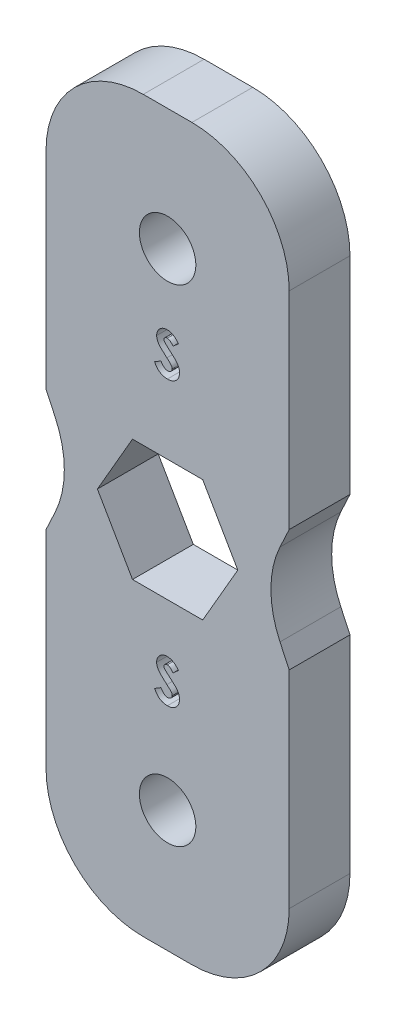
ISO-10303-21;
HEADER;
FILE_DESCRIPTION(('STEP AP214'),'2;1');
FILE_NAME('part.step','',(''),(''),'','','');
FILE_SCHEMA(('AUTOMOTIVE_DESIGN { 1 0 10303 214 1 1 1 1 }'));
ENDSEC;
DATA;
#1=APPLICATION_CONTEXT('core data for automotive mechanical design processes');
#2=APPLICATION_PROTOCOL_DEFINITION('international standard','automotive_design',2000,#1);
#3=PRODUCT_CONTEXT('',#1,'mechanical');
#4=PRODUCT('Part','Part','',(#3));
#5=PRODUCT_RELATED_PRODUCT_CATEGORY('part','',(#4));
#6=PRODUCT_DEFINITION_FORMATION('','',#4);
#7=PRODUCT_DEFINITION_CONTEXT('part definition',#1,'design');
#8=PRODUCT_DEFINITION('design','',#6,#7);
#9=PRODUCT_DEFINITION_SHAPE('','',#8);
#10=(LENGTH_UNIT() NAMED_UNIT(*) SI_UNIT(.MILLI.,.METRE.));
#11=(NAMED_UNIT(*) PLANE_ANGLE_UNIT() SI_UNIT($,.RADIAN.));
#12=(NAMED_UNIT(*) SI_UNIT($,.STERADIAN.) SOLID_ANGLE_UNIT());
#13=UNCERTAINTY_MEASURE_WITH_UNIT(LENGTH_MEASURE(1.E-05),#10,'distance_accuracy_value','');
#14=(GEOMETRIC_REPRESENTATION_CONTEXT(3) GLOBAL_UNCERTAINTY_ASSIGNED_CONTEXT((#13)) GLOBAL_UNIT_ASSIGNED_CONTEXT((#10,
#11,#12)) REPRESENTATION_CONTEXT('',''));
#15=CARTESIAN_POINT('',(0.,0.,0.));
#16=DIRECTION('',(0.,0.,1.));
#17=DIRECTION('',(1.,0.,0.));
#18=AXIS2_PLACEMENT_3D('',#15,#16,#17);
#19=CARTESIAN_POINT('',(0.,0.,3.175));
#20=DIRECTION('',(0.,0.,-1.));
#21=DIRECTION('',(-1.,0.,0.));
#22=AXIS2_PLACEMENT_3D('',#19,#20,#21);
#23=PLANE('',#22);
#24=CARTESIAN_POINT('',(6.33341266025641,28.0772658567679,3.175));
#25=CARTESIAN_POINT('',(6.35835176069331,28.0763535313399,3.175));
#26=CARTESIAN_POINT('',(6.40803310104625,28.0745360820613,3.175));
#27=CARTESIAN_POINT('',(6.48148839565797,28.0603242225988,3.175));
#28=CARTESIAN_POINT('',(6.5532364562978,28.0379745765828,3.175));
#29=CARTESIAN_POINT('',(6.61105238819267,28.0110121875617,3.175));
#30=CARTESIAN_POINT('',(6.65705544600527,27.9848937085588,3.175));
#31=CARTESIAN_POINT('',(6.692312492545,27.9608471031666,3.175));
#32=CARTESIAN_POINT('',(6.72818843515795,27.9333004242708,3.175));
#33=CARTESIAN_POINT('',(6.7649725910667,27.9021668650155,3.175));
#34=CARTESIAN_POINT('',(6.8019814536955,27.8668598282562,3.175));
#35=CARTESIAN_POINT('',(6.84026736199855,27.828219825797,3.175));
#36=CARTESIAN_POINT('',(6.87930862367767,27.7859129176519,3.175));
#37=CARTESIAN_POINT('',(6.9046792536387,27.7556890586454,3.175));
#38=CARTESIAN_POINT('',(6.91770085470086,27.7401765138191,3.175));
#39=B_SPLINE_CURVE_WITH_KNOTS('',3,(#24,#25,#26,#27,#28,#29,#30,#31,#32,#33,#34,#35,#36,#37,
#38),.UNSPECIFIED.,.F.,.F.,(4,1,1,1,1,1,1,1,1,1,1,1,4),(0.,0.1069102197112,0.212976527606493,
0.319776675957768,0.428556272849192,0.485856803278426,0.546558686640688,0.611431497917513,
0.679820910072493,0.753158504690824,0.830752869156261,0.913133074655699,1.),.UNSPECIFIED.);
#40=CARTESIAN_POINT('',(6.33341266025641,28.0772658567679,3.175));
#41=VERTEX_POINT('',#40);
#42=CARTESIAN_POINT('',(6.91770085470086,27.7401765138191,3.175));
#43=VERTEX_POINT('',#42);
#44=EDGE_CURVE('E388',#41,#43,#39,.T.);
#45=ORIENTED_EDGE('',*,*,#44,.T.);
#46=DIRECTION('',(-0.73779374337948,-0.675026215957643,0.));
#47=VECTOR('',#46,1.);
#48=CARTESIAN_POINT('',(6.91770085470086,27.7401765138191,3.175));
#49=LINE('',#48,#47);
#50=CARTESIAN_POINT('',(6.63361298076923,27.4802573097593,3.175));
#51=VERTEX_POINT('',#50);
#52=EDGE_CURVE('E450',#43,#51,#49,.T.);
#53=ORIENTED_EDGE('',*,*,#52,.T.);
#54=CARTESIAN_POINT('',(6.63361298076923,27.4802573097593,3.175));
#55=CARTESIAN_POINT('',(6.6214438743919,27.4974230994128,3.175));
#56=CARTESIAN_POINT('',(6.59808088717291,27.5303790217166,3.175));
#57=CARTESIAN_POINT('',(6.56021192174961,27.5745077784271,3.175));
#58=CARTESIAN_POINT('',(6.52251395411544,27.6121528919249,3.175));
#59=CARTESIAN_POINT('',(6.484637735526,27.6431570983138,3.175));
#60=CARTESIAN_POINT('',(6.44624754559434,27.6673320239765,3.175));
#61=CARTESIAN_POINT('',(6.40741002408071,27.6844481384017,3.175));
#62=CARTESIAN_POINT('',(6.36834535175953,27.695329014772,3.175));
#63=CARTESIAN_POINT('',(6.34209992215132,27.6966839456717,3.175));
#64=CARTESIAN_POINT('',(6.32917254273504,27.6973513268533,3.175));
#65=B_SPLINE_CURVE_WITH_KNOTS('',3,(#54,#55,#56,#57,#58,#59,#60,#61,#62,#63,#64),.UNSPECIFIED.,
.F.,.F.,(4,1,1,1,1,1,1,1,4),(0.,0.162420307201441,0.311824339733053,0.448432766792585,
0.573381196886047,0.689077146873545,0.797572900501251,0.900293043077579,1.),.UNSPECIFIED.);
#66=CARTESIAN_POINT('',(6.32917254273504,27.6973513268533,3.175));
#67=VERTEX_POINT('',#66);
#68=EDGE_CURVE('E456',#51,#67,#65,.T.);
#69=ORIENTED_EDGE('',*,*,#68,.T.);
#70=CARTESIAN_POINT('',(6.32917254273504,27.6973513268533,3.175));
#71=CARTESIAN_POINT('',(6.31711425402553,27.696928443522,3.175));
#72=CARTESIAN_POINT('',(6.2938328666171,27.696111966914,3.175));
#73=CARTESIAN_POINT('',(6.2606435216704,27.6879962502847,3.175));
#74=CARTESIAN_POINT('',(6.23117754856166,27.6739897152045,3.175));
#75=CARTESIAN_POINT('',(6.20546370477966,27.6556749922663,3.175));
#76=CARTESIAN_POINT('',(6.18509454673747,27.6336099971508,3.175));
#77=CARTESIAN_POINT('',(6.16883135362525,27.6104694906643,3.175));
#78=CARTESIAN_POINT('',(6.15967380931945,27.5849276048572,3.175));
#79=CARTESIAN_POINT('',(6.15846849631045,27.567384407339,3.175));
#80=CARTESIAN_POINT('',(6.1578717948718,27.5586994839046,3.175));
#81=B_SPLINE_CURVE_WITH_KNOTS('',3,(#70,#71,#72,#73,#74,#75,#76,#77,#78,#79,#80),.UNSPECIFIED.,
.F.,.F.,(4,1,1,1,1,1,1,1,4),(0.,0.148126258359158,0.285992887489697,0.416634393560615,
0.547379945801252,0.671582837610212,0.784400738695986,0.893265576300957,1.),.UNSPECIFIED.);
#82=CARTESIAN_POINT('',(6.1578717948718,27.5586994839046,3.175));
#83=VERTEX_POINT('',#82);
#84=EDGE_CURVE('E461',#67,#83,#81,.T.);
#85=ORIENTED_EDGE('',*,*,#84,.T.);
#86=CARTESIAN_POINT('',(6.1578717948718,27.5586994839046,3.175));
#87=CARTESIAN_POINT('',(6.15824571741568,27.5498893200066,3.175));
#88=CARTESIAN_POINT('',(6.15899874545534,27.5321468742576,3.175));
#89=CARTESIAN_POINT('',(6.1662719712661,27.5061431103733,3.175));
#90=CARTESIAN_POINT('',(6.17723479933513,27.4807344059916,3.175));
#91=CARTESIAN_POINT('',(6.18771022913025,27.4652669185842,3.175));
#92=CARTESIAN_POINT('',(6.19306477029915,27.4573606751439,3.175));
#93=B_SPLINE_CURVE_WITH_KNOTS('',3,(#86,#87,#88,#89,#90,#91,#92),.UNSPECIFIED.,.F.,.F.,(4,1,1,1,
4),(0.,0.241881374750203,0.487115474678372,0.737837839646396,1.),.UNSPECIFIED.);
#94=CARTESIAN_POINT('',(6.19306477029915,27.4573606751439,3.175));
#95=VERTEX_POINT('',#94);
#96=EDGE_CURVE('E469',#83,#95,#93,.T.);
#97=ORIENTED_EDGE('',*,*,#96,.T.);
#98=CARTESIAN_POINT('',(6.19306477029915,27.4573606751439,3.175));
#99=CARTESIAN_POINT('',(6.19793262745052,27.4512152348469,3.175));
#100=CARTESIAN_POINT('',(6.20913779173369,27.437069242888,3.175));
#101=CARTESIAN_POINT('',(6.23050374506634,27.4146641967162,3.175));
#102=CARTESIAN_POINT('',(6.25733489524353,27.3872160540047,3.175));
#103=CARTESIAN_POINT('',(6.29066376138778,27.3556686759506,3.175));
#104=CARTESIAN_POINT('',(6.32910677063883,27.3188874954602,3.175));
#105=CARTESIAN_POINT('',(6.37444580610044,27.2783183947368,3.175));
#106=CARTESIAN_POINT('',(6.42537581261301,27.2327049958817,3.175));
#107=CARTESIAN_POINT('',(6.46157568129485,27.2009414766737,3.175));
#108=CARTESIAN_POINT('',(6.48054473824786,27.1842971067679,3.175));
#109=B_SPLINE_CURVE_WITH_KNOTS('',3,(#98,#99,#100,#101,#102,#103,#104,#105,#106,#107,#108),
.UNSPECIFIED.,.F.,.F.,(4,1,1,1,1,1,1,1,4),(0.,0.0592341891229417,0.136349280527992,
0.233805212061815,0.349411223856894,0.48317915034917,0.635966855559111,0.809243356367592,1.),.UNSPECIFIED.);
#110=CARTESIAN_POINT('',(6.48054473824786,27.1842971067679,3.175));
#111=VERTEX_POINT('',#110);
#112=EDGE_CURVE('E477',#95,#111,#109,.T.);
#113=ORIENTED_EDGE('',*,*,#112,.T.);
#114=CARTESIAN_POINT('',(6.48054473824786,27.1842971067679,3.175));
#115=CARTESIAN_POINT('',(6.49834992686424,27.1688876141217,3.175));
#116=CARTESIAN_POINT('',(6.5321404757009,27.1396435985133,3.175));
#117=CARTESIAN_POINT('',(6.58021771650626,27.0981364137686,3.175));
#118=CARTESIAN_POINT('',(6.62246960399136,27.0607934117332,3.175));
#119=CARTESIAN_POINT('',(6.65951165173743,27.028175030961,3.175));
#120=CARTESIAN_POINT('',(6.690782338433,26.9999390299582,3.175));
#121=CARTESIAN_POINT('',(6.71641312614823,26.9759504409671,3.175));
#122=CARTESIAN_POINT('',(6.73671705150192,26.9566762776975,3.175));
#123=CARTESIAN_POINT('',(6.74825864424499,26.9450346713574,3.175));
#124=CARTESIAN_POINT('',(6.7531842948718,26.9400663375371,3.175));
#125=B_SPLINE_CURVE_WITH_KNOTS('',3,(#114,#115,#116,#117,#118,#119,#120,#121,#122,#123,#124),
.UNSPECIFIED.,.F.,.F.,(4,1,1,1,1,1,1,1,4),(0.,0.192952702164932,0.366184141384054,
0.520457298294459,0.655012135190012,0.770624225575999,0.865677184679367,0.942674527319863,1.),.UNSPECIFIED.);
#126=CARTESIAN_POINT('',(6.7531842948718,26.9400663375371,3.175));
#127=VERTEX_POINT('',#126);
#128=EDGE_CURVE('E485',#111,#127,#125,.T.);
#129=ORIENTED_EDGE('',*,*,#128,.T.);
#130=CARTESIAN_POINT('',(6.7531842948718,26.9400663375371,3.175));
#131=CARTESIAN_POINT('',(6.77187118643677,26.9198431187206,3.175));
#132=CARTESIAN_POINT('',(6.80779395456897,26.8809669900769,3.175));
#133=CARTESIAN_POINT('',(6.85448088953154,26.820721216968,3.175));
#134=CARTESIAN_POINT('',(6.89290574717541,26.7619090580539,3.175));
#135=CARTESIAN_POINT('',(6.92263194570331,26.7034238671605,3.175));
#136=CARTESIAN_POINT('',(6.94508236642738,26.6444218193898,3.175));
#137=CARTESIAN_POINT('',(6.96091021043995,26.5834558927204,3.175));
#138=CARTESIAN_POINT('',(6.97038961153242,26.5198890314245,3.175));
#139=CARTESIAN_POINT('',(6.97144204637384,26.4765124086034,3.175));
#140=CARTESIAN_POINT('',(6.97197435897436,26.4545728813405,3.175));
#141=B_SPLINE_CURVE_WITH_KNOTS('',3,(#130,#131,#132,#133,#134,#135,#136,#137,#138,#139,#140),
.UNSPECIFIED.,.F.,.F.,(4,1,1,1,1,1,1,1,4),(0.,0.150833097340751,0.289954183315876,
0.417138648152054,0.535255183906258,0.648751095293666,0.762405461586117,0.879826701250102,1.),.UNSPECIFIED.);
#142=CARTESIAN_POINT('',(6.97197435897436,26.4545728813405,3.175));
#143=VERTEX_POINT('',#142);
#144=EDGE_CURVE('E493',#127,#143,#141,.T.);
#145=ORIENTED_EDGE('',*,*,#144,.T.);
#146=CARTESIAN_POINT('',(6.97197435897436,26.4545728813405,3.175));
#147=CARTESIAN_POINT('',(6.97159547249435,26.4331955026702,3.175));
#148=CARTESIAN_POINT('',(6.97085208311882,26.3912522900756,3.175));
#149=CARTESIAN_POINT('',(6.96174698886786,26.3298746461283,3.175));
#150=CARTESIAN_POINT('',(6.94876365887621,26.2711335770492,3.175));
#151=CARTESIAN_POINT('',(6.92868915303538,26.21566826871,3.175));
#152=CARTESIAN_POINT('',(6.9042224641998,26.1625682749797,3.175));
#153=CARTESIAN_POINT('',(6.87354993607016,26.1126607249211,3.175));
#154=CARTESIAN_POINT('',(6.83752925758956,26.0654405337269,3.175));
#155=CARTESIAN_POINT('',(6.79624402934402,26.0217518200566,3.175));
#156=CARTESIAN_POINT('',(6.75057766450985,25.9821073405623,3.175));
#157=CARTESIAN_POINT('',(6.70159614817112,25.9468148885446,3.175));
#158=CARTESIAN_POINT('',(6.64882051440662,25.9176764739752,3.175));
#159=CARTESIAN_POINT('',(6.59270166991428,25.8936830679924,3.175));
#160=CARTESIAN_POINT('',(6.53326965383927,25.8752030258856,3.175));
#161=CARTESIAN_POINT('',(6.4705952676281,25.8615445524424,3.175));
#162=CARTESIAN_POINT('',(6.40458264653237,25.8533469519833,3.175));
#163=CARTESIAN_POINT('',(6.35944226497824,25.8524899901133,3.175));
#164=CARTESIAN_POINT('',(6.33638074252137,25.8520521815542,3.175));
#165=B_SPLINE_CURVE_WITH_KNOTS('',3,(#146,#147,#148,#149,#150,#151,#152,#153,#154,#155,#156,
#157,#158,#159,#160,#161,#162,#163,#164),.UNSPECIFIED.,.F.,.F.,(4,1,1,1,1,1,1,1,1,1,1,1,1,1,1,1,
4),(0.,0.0652008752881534,0.127926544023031,0.189046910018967,0.248543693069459,
0.307607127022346,0.367247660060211,0.426963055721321,0.488617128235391,0.550391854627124,
0.611330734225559,0.672556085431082,0.734024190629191,0.797340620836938,0.862249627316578,
0.929625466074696,1.),.UNSPECIFIED.);
#166=CARTESIAN_POINT('',(6.33638074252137,25.8520521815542,3.175));
#167=VERTEX_POINT('',#166);
#168=EDGE_CURVE('E501',#143,#167,#165,.T.);
#169=ORIENTED_EDGE('',*,*,#168,.T.);
#170=CARTESIAN_POINT('',(6.33638074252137,25.8520521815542,3.175));
#171=CARTESIAN_POINT('',(6.31827764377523,25.8523733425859,3.175));
#172=CARTESIAN_POINT('',(6.28242312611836,25.8530094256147,3.175));
#173=CARTESIAN_POINT('',(6.22957898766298,25.8582025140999,3.175));
#174=CARTESIAN_POINT('',(6.17855199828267,25.8665836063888,3.175));
#175=CARTESIAN_POINT('',(6.12939963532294,25.8785962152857,3.175));
#176=CARTESIAN_POINT('',(6.08190045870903,25.893817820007,3.175));
#177=CARTESIAN_POINT('',(6.03605251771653,25.9124104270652,3.175));
#178=CARTESIAN_POINT('',(5.99217231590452,25.9346622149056,3.175));
#179=CARTESIAN_POINT('',(5.94992783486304,25.960115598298,3.175));
#180=CARTESIAN_POINT('',(5.90952443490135,25.9896703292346,3.175));
#181=CARTESIAN_POINT('',(5.87045123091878,26.0227221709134,3.175));
#182=CARTESIAN_POINT('',(5.83309633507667,26.0597794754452,3.175));
#183=CARTESIAN_POINT('',(5.79728033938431,26.1007546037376,3.175));
#184=CARTESIAN_POINT('',(5.76323240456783,26.1457635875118,3.175));
#185=CARTESIAN_POINT('',(5.72983801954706,26.1941795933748,3.175));
#186=CARTESIAN_POINT('',(5.69858133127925,26.2469011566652,3.175));
#187=CARTESIAN_POINT('',(5.67927268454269,26.283885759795,3.175));
#188=CARTESIAN_POINT('',(5.66941025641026,26.3027766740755,3.175));
#189=B_SPLINE_CURVE_WITH_KNOTS('',3,(#170,#171,#172,#173,#174,#175,#176,#177,#178,#179,#180,
#181,#182,#183,#184,#185,#186,#187,#188),.UNSPECIFIED.,.F.,.F.,(4,1,1,1,1,1,1,1,1,1,1,1,1,1,1,1,
4),(0.,0.0635514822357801,0.125868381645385,0.186240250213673,0.244976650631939,
0.303357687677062,0.361230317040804,0.418489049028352,0.475936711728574,0.534203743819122,
0.594059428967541,0.655468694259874,0.718771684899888,0.784974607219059,0.853522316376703,
0.925182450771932,1.),.UNSPECIFIED.);
#190=CARTESIAN_POINT('',(5.66941025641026,26.3027766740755,3.175));
#191=VERTEX_POINT('',#190);
#192=EDGE_CURVE('E509',#167,#191,#189,.T.);
#193=ORIENTED_EDGE('',*,*,#192,.T.);
#194=DIRECTION('',(0.85739690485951,0.514655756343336,0.));
#195=VECTOR('',#194,1.);
#196=CARTESIAN_POINT('',(5.66941025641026,26.3027766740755,3.175));
#197=LINE('',#196,#195);
#198=CARTESIAN_POINT('',(6.00353151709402,26.5033342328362,3.175));
#199=VERTEX_POINT('',#198);
#200=EDGE_CURVE('E517',#191,#199,#197,.T.);
#201=ORIENTED_EDGE('',*,*,#200,.T.);
#202=CARTESIAN_POINT('',(6.00353151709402,26.5033342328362,3.175));
#203=CARTESIAN_POINT('',(6.01586794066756,26.4818905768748,3.175));
#204=CARTESIAN_POINT('',(6.03951791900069,26.4407812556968,3.175));
#205=CARTESIAN_POINT('',(6.07959501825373,26.3855456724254,3.175));
#206=CARTESIAN_POINT('',(6.12065196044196,26.3382455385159,3.175));
#207=CARTESIAN_POINT('',(6.1636379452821,26.2997168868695,3.175));
#208=CARTESIAN_POINT('',(6.20803027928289,26.2694445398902,3.175));
#209=CARTESIAN_POINT('',(6.25404338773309,26.2478098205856,3.175));
#210=CARTESIAN_POINT('',(6.30170959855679,26.23441795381,3.175));
#211=CARTESIAN_POINT('',(6.33417765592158,26.2327824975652,3.175));
#212=CARTESIAN_POINT('',(6.35037313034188,26.2319667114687,3.175));
#213=B_SPLINE_CURVE_WITH_KNOTS('',3,(#202,#203,#204,#205,#206,#207,#208,#209,#210,#211,#212),
.UNSPECIFIED.,.F.,.F.,(4,1,1,1,1,1,1,1,4),(0.,0.160457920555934,0.307611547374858,
0.442138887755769,0.566229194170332,0.681222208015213,0.789558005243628,0.895028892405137,1.),.UNSPECIFIED.);
#214=CARTESIAN_POINT('',(6.35037313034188,26.2319667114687,3.175));
#215=VERTEX_POINT('',#214);
#216=EDGE_CURVE('E523',#199,#215,#213,.T.);
#217=ORIENTED_EDGE('',*,*,#216,.T.);
#218=CARTESIAN_POINT('',(6.35037313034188,26.2319667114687,3.175));
#219=CARTESIAN_POINT('',(6.36684624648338,26.2326329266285,3.175));
#220=CARTESIAN_POINT('',(6.39880649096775,26.2339254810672,3.175));
#221=CARTESIAN_POINT('',(6.44442565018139,26.2458644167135,3.175));
#222=CARTESIAN_POINT('',(6.48625102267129,26.2646094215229,3.175));
#223=CARTESIAN_POINT('',(6.52240456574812,26.2913559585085,3.175));
#224=CARTESIAN_POINT('',(6.55301710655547,26.3222255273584,3.175));
#225=CARTESIAN_POINT('',(6.57561091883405,26.3565693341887,3.175));
#226=CARTESIAN_POINT('',(6.58980450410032,26.3937285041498,3.175));
#227=CARTESIAN_POINT('',(6.59130511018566,26.4195417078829,3.175));
#228=CARTESIAN_POINT('',(6.59205982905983,26.4325242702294,3.175));
#229=B_SPLINE_CURVE_WITH_KNOTS('',3,(#218,#219,#220,#221,#222,#223,#224,#225,#226,#227,#228),
.UNSPECIFIED.,.F.,.F.,(4,1,1,1,1,1,1,1,4),(0.,0.141985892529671,0.275473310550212,
0.404345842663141,0.535429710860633,0.661427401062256,0.777866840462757,0.888279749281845,1.),.UNSPECIFIED.);
#230=CARTESIAN_POINT('',(6.59205982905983,26.4325242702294,3.175));
#231=VERTEX_POINT('',#230);
#232=EDGE_CURVE('E528',#215,#231,#229,.T.);
#233=ORIENTED_EDGE('',*,*,#232,.T.);
#234=CARTESIAN_POINT('',(6.59205982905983,26.4325242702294,3.175));
#235=CARTESIAN_POINT('',(6.5913628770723,26.4446024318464,3.175));
#236=CARTESIAN_POINT('',(6.58994708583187,26.4691380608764,3.175));
#237=CARTESIAN_POINT('',(6.57951880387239,26.5056185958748,3.175));
#238=CARTESIAN_POINT('',(6.56321621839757,26.5420825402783,3.175));
#239=CARTESIAN_POINT('',(6.54392911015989,26.5719912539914,3.175));
#240=CARTESIAN_POINT('',(6.52430206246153,26.5970330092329,3.175));
#241=CARTESIAN_POINT('',(6.50553417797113,26.6187305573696,3.175));
#242=CARTESIAN_POINT('',(6.48267985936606,26.6427025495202,3.175));
#243=CARTESIAN_POINT('',(6.45579705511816,26.668979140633,3.175));
#244=CARTESIAN_POINT('',(6.42524095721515,26.6977916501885,3.175));
#245=CARTESIAN_POINT('',(6.39098582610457,26.7291372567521,3.175));
#246=CARTESIAN_POINT('',(6.35263940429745,26.7627398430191,3.175));
#247=CARTESIAN_POINT('',(6.32553607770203,26.7856295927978,3.175));
#248=CARTESIAN_POINT('',(6.3113640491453,26.7975983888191,3.175));
#249=B_SPLINE_CURVE_WITH_KNOTS('',3,(#234,#235,#236,#237,#238,#239,#240,#241,#242,#243,#244,
#245,#246,#247,#248),.UNSPECIFIED.,.F.,.F.,(4,1,1,1,1,1,1,1,1,1,1,1,4),(0.,0.0763466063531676,
0.155090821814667,0.238351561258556,0.328404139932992,0.379383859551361,0.43961764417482,
0.509831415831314,0.588874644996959,0.67743635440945,0.775546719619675,0.882635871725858,1.),.UNSPECIFIED.);
#250=CARTESIAN_POINT('',(6.3113640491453,26.7975983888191,3.175));
#251=VERTEX_POINT('',#250);
#252=EDGE_CURVE('E536',#231,#251,#249,.T.);
#253=ORIENTED_EDGE('',*,*,#252,.T.);
#254=CARTESIAN_POINT('',(6.3113640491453,26.7975983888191,3.175));
#255=CARTESIAN_POINT('',(6.28442245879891,26.8203935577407,3.175));
#256=CARTESIAN_POINT('',(6.23271339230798,26.8641443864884,3.175));
#257=CARTESIAN_POINT('',(6.15964192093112,26.9287629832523,3.175));
#258=CARTESIAN_POINT('',(6.09379798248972,26.9891549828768,3.175));
#259=CARTESIAN_POINT('',(6.03575027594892,27.0460669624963,3.175));
#260=CARTESIAN_POINT('',(5.98475918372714,27.0984478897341,3.175));
#261=CARTESIAN_POINT('',(5.94117003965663,27.1467232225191,3.175));
#262=CARTESIAN_POINT('',(5.9054616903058,27.191265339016,3.175));
#263=CARTESIAN_POINT('',(5.8678863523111,27.2440224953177,3.175));
#264=CARTESIAN_POINT('',(5.83218226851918,27.3083107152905,3.175));
#265=CARTESIAN_POINT('',(5.80132380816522,27.3856568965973,3.175));
#266=CARTESIAN_POINT('',(5.78130414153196,27.4629932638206,3.175));
#267=CARTESIAN_POINT('',(5.77906121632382,27.5149126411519,3.175));
#268=CARTESIAN_POINT('',(5.77795726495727,27.5404669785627,3.175));
#269=B_SPLINE_CURVE_WITH_KNOTS('',3,(#254,#255,#256,#257,#258,#259,#260,#261,#262,#263,#264,
#265,#266,#267,#268),.UNSPECIFIED.,.F.,.F.,(4,1,1,1,1,1,1,1,1,1,1,1,4),(0.,0.112124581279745,
0.215201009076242,0.309902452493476,0.395959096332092,0.473447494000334,0.542140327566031,
0.60252333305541,0.654726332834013,0.747804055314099,0.835278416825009,0.918925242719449,1.),.UNSPECIFIED.);
#270=CARTESIAN_POINT('',(5.77795726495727,27.5404669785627,3.175));
#271=VERTEX_POINT('',#270);
#272=EDGE_CURVE('E544',#251,#271,#269,.T.);
#273=ORIENTED_EDGE('',*,*,#272,.T.);
#274=CARTESIAN_POINT('',(5.77795726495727,27.5404669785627,3.175));
#275=CARTESIAN_POINT('',(5.77841639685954,27.5585887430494,3.175));
#276=CARTESIAN_POINT('',(5.77932093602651,27.5942905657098,3.175));
#277=CARTESIAN_POINT('',(5.78738956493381,27.646784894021,3.175));
#278=CARTESIAN_POINT('',(5.799448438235,27.6974375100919,3.175));
#279=CARTESIAN_POINT('',(5.81696138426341,27.7460636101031,3.175));
#280=CARTESIAN_POINT('',(5.83969107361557,27.792602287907,3.175));
#281=CARTESIAN_POINT('',(5.8672953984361,27.8372813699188,3.175));
#282=CARTESIAN_POINT('',(5.90020300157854,27.8796896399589,3.175));
#283=CARTESIAN_POINT('',(5.93728764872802,27.9197989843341,3.175));
#284=CARTESIAN_POINT('',(5.97814543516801,27.9564543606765,3.175));
#285=CARTESIAN_POINT('',(6.02180717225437,27.9888064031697,3.175));
#286=CARTESIAN_POINT('',(6.06802573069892,28.0161314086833,3.175));
#287=CARTESIAN_POINT('',(6.11651836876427,28.0387994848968,3.175));
#288=CARTESIAN_POINT('',(6.16758557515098,28.0561504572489,3.175));
#289=CARTESIAN_POINT('',(6.22085114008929,28.0684496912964,3.175));
#290=CARTESIAN_POINT('',(6.2763914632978,28.0757648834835,3.175));
#291=CARTESIAN_POINT('',(6.31416879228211,28.0767592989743,3.175));
#292=CARTESIAN_POINT('',(6.33341266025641,28.0772658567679,3.175));
#293=B_SPLINE_CURVE_WITH_KNOTS('',3,(#274,#275,#276,#277,#278,#279,#280,#281,#282,#283,#284,
#285,#286,#287,#288,#289,#290,#291,#292),.UNSPECIFIED.,.F.,.F.,(4,1,1,1,1,1,1,1,1,1,1,1,1,1,1,1,
4),(0.,0.0631728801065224,0.124457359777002,0.184840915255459,0.244566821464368,
0.304319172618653,0.365199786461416,0.427420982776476,0.491261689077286,0.555499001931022,
0.618604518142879,0.680494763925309,0.742473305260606,0.804990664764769,0.86825197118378,
0.932887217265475,1.),.UNSPECIFIED.);
#294=EDGE_CURVE('E552',#271,#41,#293,.T.);
#295=ORIENTED_EDGE('',*,*,#294,.T.);
#296=EDGE_LOOP('',(#45,#53,#69,#85,#97,#113,#129,#145,#169,#193,#201,#217,#233,#253,#273,#295));
#297=FACE_BOUND('',#296,.T.);
#298=CARTESIAN_POINT('',(6.35,6.35,3.175));
#299=DIRECTION('',(0.,0.,-1.));
#300=DIRECTION('',(-1.,0.,0.));
#301=AXIS2_PLACEMENT_3D('',#298,#299,#300);
#302=CIRCLE('',#301,1.4732);
#303=CARTESIAN_POINT('',(4.8768,6.35,3.175));
#304=VERTEX_POINT('',#303);
#305=EDGE_CURVE('E600',#304,#304,#302,.T.);
#306=ORIENTED_EDGE('',*,*,#305,.T.);
#307=EDGE_LOOP('',(#306));
#308=FACE_BOUND('',#307,.T.);
#309=CARTESIAN_POINT('',(6.35,31.75,3.175));
#310=DIRECTION('',(0.,0.,-1.));
#311=DIRECTION('',(-1.,0.,0.));
#312=AXIS2_PLACEMENT_3D('',#309,#310,#311);
#313=CIRCLE('',#312,1.4732);
#314=CARTESIAN_POINT('',(4.8768,31.75,3.175));
#315=VERTEX_POINT('',#314);
#316=EDGE_CURVE('E606',#315,#315,#313,.T.);
#317=ORIENTED_EDGE('',*,*,#316,.T.);
#318=EDGE_LOOP('',(#317));
#319=FACE_BOUND('',#318,.T.);
#320=DIRECTION('',(1.,0.,0.));
#321=VECTOR('',#320,1.);
#322=CARTESIAN_POINT('',(12.7,0.,3.175));
#323=LINE('',#322,#321);
#324=CARTESIAN_POINT('',(5.08,0.,3.175));
#325=VERTEX_POINT('',#324);
#326=CARTESIAN_POINT('',(7.62,0.,3.175));
#327=VERTEX_POINT('',#326);
#328=EDGE_CURVE('E658',#325,#327,#323,.T.);
#329=ORIENTED_EDGE('',*,*,#328,.T.);
#330=CARTESIAN_POINT('',(7.62,5.08,3.175));
#331=DIRECTION('',(0.,0.,-1.));
#332=DIRECTION('',(-1.,0.,0.));
#333=AXIS2_PLACEMENT_3D('',#330,#331,#332);
#334=CIRCLE('',#333,5.08);
#335=CARTESIAN_POINT('',(12.7,5.08,3.175));
#336=VERTEX_POINT('',#335);
#337=EDGE_CURVE('E740',#327,#336,#334,.F.);
#338=ORIENTED_EDGE('',*,*,#337,.T.);
#339=DIRECTION('',(0.,1.,0.));
#340=VECTOR('',#339,1.);
#341=CARTESIAN_POINT('',(12.7,15.875,3.175));
#342=LINE('',#341,#340);
#343=CARTESIAN_POINT('',(12.7,15.875,3.175));
#344=VERTEX_POINT('',#343);
#345=EDGE_CURVE('E662',#336,#344,#342,.T.);
#346=ORIENTED_EDGE('',*,*,#345,.T.);
#347=DIRECTION('',(-0.422478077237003,0.906373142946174,0.));
#348=VECTOR('',#347,1.);
#349=CARTESIAN_POINT('',(11.2200710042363,19.05,3.175));
#350=LINE('',#349,#348);
#351=CARTESIAN_POINT('',(12.2204510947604,16.903811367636,3.175));
#352=VERTEX_POINT('',#351);
#353=EDGE_CURVE('E664',#344,#352,#350,.T.);
#354=ORIENTED_EDGE('',*,*,#353,.T.);
#355=CARTESIAN_POINT('',(16.8248266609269,19.05,3.175));
#356=DIRECTION('',(0.,0.,-1.));
#357=DIRECTION('',(-1.,0.,0.));
#358=AXIS2_PLACEMENT_3D('',#355,#356,#357);
#359=CIRCLE('',#358,5.08);
#360=CARTESIAN_POINT('',(12.2204510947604,21.196188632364,3.175));
#361=VERTEX_POINT('',#360);
#362=EDGE_CURVE('E766',#352,#361,#359,.T.);
#363=ORIENTED_EDGE('',*,*,#362,.T.);
#364=DIRECTION('',(0.422478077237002,0.906373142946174,0.));
#365=VECTOR('',#364,1.);
#366=CARTESIAN_POINT('',(12.7,22.225,3.175));
#367=LINE('',#366,#365);
#368=CARTESIAN_POINT('',(12.7,22.225,3.175));
#369=VERTEX_POINT('',#368);
#370=EDGE_CURVE('E667',#361,#369,#367,.T.);
#371=ORIENTED_EDGE('',*,*,#370,.T.);
#372=DIRECTION('',(0.,1.,0.));
#373=VECTOR('',#372,1.);
#374=CARTESIAN_POINT('',(12.7,38.1,3.175));
#375=LINE('',#374,#373);
#376=CARTESIAN_POINT('',(12.7,33.02,3.175));
#377=VERTEX_POINT('',#376);
#378=EDGE_CURVE('E669',#369,#377,#375,.T.);
#379=ORIENTED_EDGE('',*,*,#378,.T.);
#380=CARTESIAN_POINT('',(7.62,33.02,3.175));
#381=DIRECTION('',(0.,0.,-1.));
#382=DIRECTION('',(-1.,0.,0.));
#383=AXIS2_PLACEMENT_3D('',#380,#381,#382);
#384=CIRCLE('',#383,5.08);
#385=CARTESIAN_POINT('',(7.62,38.1,3.175));
#386=VERTEX_POINT('',#385);
#387=EDGE_CURVE('E738',#377,#386,#384,.F.);
#388=ORIENTED_EDGE('',*,*,#387,.T.);
#389=DIRECTION('',(-1.,0.,0.));
#390=VECTOR('',#389,1.);
#391=CARTESIAN_POINT('',(0.,38.1,3.175));
#392=LINE('',#391,#390);
#393=CARTESIAN_POINT('',(5.08,38.1,3.175));
#394=VERTEX_POINT('',#393);
#395=EDGE_CURVE('E672',#386,#394,#392,.T.);
#396=ORIENTED_EDGE('',*,*,#395,.T.);
#397=CARTESIAN_POINT('',(5.08,33.02,3.175));
#398=DIRECTION('',(0.,0.,-1.));
#399=DIRECTION('',(-1.,0.,0.));
#400=AXIS2_PLACEMENT_3D('',#397,#398,#399);
#401=CIRCLE('',#400,5.08);
#402=CARTESIAN_POINT('',(0.,33.02,3.175));
#403=VERTEX_POINT('',#402);
#404=EDGE_CURVE('E734',#394,#403,#401,.F.);
#405=ORIENTED_EDGE('',*,*,#404,.T.);
#406=DIRECTION('',(0.,-1.,0.));
#407=VECTOR('',#406,1.);
#408=CARTESIAN_POINT('',(0.,38.1,3.175));
#409=LINE('',#408,#407);
#410=CARTESIAN_POINT('',(0.,22.225,3.175));
#411=VERTEX_POINT('',#410);
#412=EDGE_CURVE('E675',#403,#411,#409,.T.);
#413=ORIENTED_EDGE('',*,*,#412,.T.);
#414=DIRECTION('',(0.422478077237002,-0.906373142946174,0.));
#415=VECTOR('',#414,1.);
#416=CARTESIAN_POINT('',(0.,22.225,3.175));
#417=LINE('',#416,#415);
#418=CARTESIAN_POINT('',(0.479548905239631,21.196188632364,3.175));
#419=VERTEX_POINT('',#418);
#420=EDGE_CURVE('E677',#411,#419,#417,.T.);
#421=ORIENTED_EDGE('',*,*,#420,.T.);
#422=CARTESIAN_POINT('',(-4.12482666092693,19.05,3.175));
#423=DIRECTION('',(0.,0.,-1.));
#424=DIRECTION('',(-1.,0.,0.));
#425=AXIS2_PLACEMENT_3D('',#422,#423,#424);
#426=CIRCLE('',#425,5.08);
#427=CARTESIAN_POINT('',(0.479548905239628,16.903811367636,3.175));
#428=VERTEX_POINT('',#427);
#429=EDGE_CURVE('E11',#419,#428,#426,.T.);
#430=ORIENTED_EDGE('',*,*,#429,.T.);
#431=DIRECTION('',(-0.422478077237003,-0.906373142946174,0.));
#432=VECTOR('',#431,1.);
#433=CARTESIAN_POINT('',(1.47992899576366,19.05,3.175));
#434=LINE('',#433,#432);
#435=CARTESIAN_POINT('',(0.,15.875,3.175));
#436=VERTEX_POINT('',#435);
#437=EDGE_CURVE('E680',#428,#436,#434,.T.);
#438=ORIENTED_EDGE('',*,*,#437,.T.);
#439=DIRECTION('',(0.,-1.,0.));
#440=VECTOR('',#439,1.);
#441=CARTESIAN_POINT('',(0.,15.875,3.175));
#442=LINE('',#441,#440);
#443=CARTESIAN_POINT('',(0.,5.08,3.175));
#444=VERTEX_POINT('',#443);
#445=EDGE_CURVE('E655',#436,#444,#442,.T.);
#446=ORIENTED_EDGE('',*,*,#445,.T.);
#447=CARTESIAN_POINT('',(5.08,5.08,3.175));
#448=DIRECTION('',(0.,0.,-1.));
#449=DIRECTION('',(-1.,0.,0.));
#450=AXIS2_PLACEMENT_3D('',#447,#448,#449);
#451=CIRCLE('',#450,5.08);
#452=EDGE_CURVE('E736',#444,#325,#451,.F.);
#453=ORIENTED_EDGE('',*,*,#452,.T.);
#454=EDGE_LOOP('',(#329,#338,#346,#354,#363,#371,#379,#388,#396,#405,#413,#421,#430,#438,#446,#453));
#455=FACE_BOUND('',#454,.T.);
#456=DIRECTION('',(-0.5,0.866025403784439,0.));
#457=VECTOR('',#456,1.);
#458=CARTESIAN_POINT('',(10.0161742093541,19.05,3.175));
#459=LINE('',#458,#457);
#460=CARTESIAN_POINT('',(10.0161742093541,19.05,3.175));
#461=VERTEX_POINT('',#460);
#462=CARTESIAN_POINT('',(8.18308710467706,22.225,3.175));
#463=VERTEX_POINT('',#462);
#464=EDGE_CURVE('E610',#461,#463,#459,.T.);
#465=ORIENTED_EDGE('',*,*,#464,.F.);
#466=DIRECTION('',(0.5,0.866025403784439,0.));
#467=VECTOR('',#466,1.);
#468=CARTESIAN_POINT('',(8.18308710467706,15.875,3.175));
#469=LINE('',#468,#467);
#470=CARTESIAN_POINT('',(8.18308710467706,15.875,3.175));
#471=VERTEX_POINT('',#470);
#472=EDGE_CURVE('E622',#471,#461,#469,.T.);
#473=ORIENTED_EDGE('',*,*,#472,.F.);
#474=DIRECTION('',(1.,0.,0.));
#475=VECTOR('',#474,1.);
#476=CARTESIAN_POINT('',(4.51691289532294,15.875,3.175));
#477=LINE('',#476,#475);
#478=CARTESIAN_POINT('',(4.51691289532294,15.875,3.175));
#479=VERTEX_POINT('',#478);
#480=EDGE_CURVE('E619',#479,#471,#477,.T.);
#481=ORIENTED_EDGE('',*,*,#480,.F.);
#482=DIRECTION('',(0.5,-0.866025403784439,0.));
#483=VECTOR('',#482,1.);
#484=CARTESIAN_POINT('',(2.68382579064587,19.05,3.175));
#485=LINE('',#484,#483);
#486=CARTESIAN_POINT('',(2.68382579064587,19.05,3.175));
#487=VERTEX_POINT('',#486);
#488=EDGE_CURVE('E617',#487,#479,#485,.T.);
#489=ORIENTED_EDGE('',*,*,#488,.F.);
#490=DIRECTION('',(-0.5,-0.866025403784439,0.));
#491=VECTOR('',#490,1.);
#492=CARTESIAN_POINT('',(4.51691289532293,22.225,3.175));
#493=LINE('',#492,#491);
#494=CARTESIAN_POINT('',(4.51691289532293,22.225,3.175));
#495=VERTEX_POINT('',#494);
#496=EDGE_CURVE('E615',#495,#487,#493,.T.);
#497=ORIENTED_EDGE('',*,*,#496,.F.);
#498=DIRECTION('',(-1.,0.,0.));
#499=VECTOR('',#498,1.);
#500=CARTESIAN_POINT('',(8.18308710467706,22.225,3.175));
#501=LINE('',#500,#499);
#502=EDGE_CURVE('E612',#463,#495,#501,.T.);
#503=ORIENTED_EDGE('',*,*,#502,.F.);
#504=EDGE_LOOP('',(#465,#473,#481,#489,#497,#503));
#505=FACE_BOUND('',#504,.T.);
#506=CARTESIAN_POINT('',(6.33341266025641,13.2991553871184,3.175));
#507=CARTESIAN_POINT('',(6.35835176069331,13.2982430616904,3.175));
#508=CARTESIAN_POINT('',(6.40803310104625,13.2964256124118,3.175));
#509=CARTESIAN_POINT('',(6.48148839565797,13.2822137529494,3.175));
#510=CARTESIAN_POINT('',(6.5532364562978,13.2598641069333,3.175));
#511=CARTESIAN_POINT('',(6.61105238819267,13.2329017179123,3.175));
#512=CARTESIAN_POINT('',(6.65705544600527,13.2067832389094,3.175));
#513=CARTESIAN_POINT('',(6.692312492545,13.1827366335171,3.175));
#514=CARTESIAN_POINT('',(6.72818843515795,13.1551899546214,3.175));
#515=CARTESIAN_POINT('',(6.7649725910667,13.1240563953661,3.175));
#516=CARTESIAN_POINT('',(6.8019814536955,13.0887493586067,3.175));
#517=CARTESIAN_POINT('',(6.84026736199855,13.0501093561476,3.175));
#518=CARTESIAN_POINT('',(6.87930862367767,13.0078024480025,3.175));
#519=CARTESIAN_POINT('',(6.9046792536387,12.977578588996,3.175));
#520=CARTESIAN_POINT('',(6.91770085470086,12.9620660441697,3.175));
#521=B_SPLINE_CURVE_WITH_KNOTS('',3,(#506,#507,#508,#509,#510,#511,#512,#513,#514,#515,#516,
#517,#518,#519,#520),.UNSPECIFIED.,.F.,.F.,(4,1,1,1,1,1,1,1,1,1,1,1,4),(0.,0.1069102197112,
0.212976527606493,0.319776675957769,0.428556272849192,0.485856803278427,0.546558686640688,
0.611431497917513,0.679820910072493,0.753158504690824,0.830752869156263,0.913133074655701,1.),.UNSPECIFIED.);
#522=CARTESIAN_POINT('',(6.33341266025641,13.2991553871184,3.175));
#523=VERTEX_POINT('',#522);
#524=CARTESIAN_POINT('',(6.91770085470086,12.9620660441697,3.175));
#525=VERTEX_POINT('',#524);
#526=EDGE_CURVE('E47',#523,#525,#521,.T.);
#527=ORIENTED_EDGE('',*,*,#526,.T.);
#528=DIRECTION('',(-0.73779374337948,-0.675026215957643,0.));
#529=VECTOR('',#528,1.);
#530=CARTESIAN_POINT('',(6.91770085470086,12.9620660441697,3.175));
#531=LINE('',#530,#529);
#532=CARTESIAN_POINT('',(6.63361298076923,12.7021468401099,3.175));
#533=VERTEX_POINT('',#532);
#534=EDGE_CURVE('E387',#525,#533,#531,.T.);
#535=ORIENTED_EDGE('',*,*,#534,.T.);
#536=CARTESIAN_POINT('',(6.63361298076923,12.7021468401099,3.175));
#537=CARTESIAN_POINT('',(6.6214438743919,12.7193126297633,3.175));
#538=CARTESIAN_POINT('',(6.59808088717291,12.7522685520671,3.175));
#539=CARTESIAN_POINT('',(6.56021192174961,12.7963973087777,3.175));
#540=CARTESIAN_POINT('',(6.52251395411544,12.8340424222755,3.175));
#541=CARTESIAN_POINT('',(6.484637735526,12.8650466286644,3.175));
#542=CARTESIAN_POINT('',(6.44624754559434,12.889221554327,3.175));
#543=CARTESIAN_POINT('',(6.40741002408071,12.9063376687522,3.175));
#544=CARTESIAN_POINT('',(6.36834535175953,12.9172185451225,3.175));
#545=CARTESIAN_POINT('',(6.34209992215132,12.9185734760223,3.175));
#546=CARTESIAN_POINT('',(6.32917254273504,12.9192408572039,3.175));
#547=B_SPLINE_CURVE_WITH_KNOTS('',3,(#536,#537,#538,#539,#540,#541,#542,#543,#544,#545,#546),
.UNSPECIFIED.,.F.,.F.,(4,1,1,1,1,1,1,1,4),(0.,0.162420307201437,0.31182433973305,
0.448432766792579,0.573381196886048,0.689077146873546,0.797572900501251,0.900293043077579,1.),.UNSPECIFIED.);
#548=CARTESIAN_POINT('',(6.32917254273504,12.9192408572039,3.175));
#549=VERTEX_POINT('',#548);
#550=EDGE_CURVE('E1329',#533,#549,#547,.T.);
#551=ORIENTED_EDGE('',*,*,#550,.T.);
#552=CARTESIAN_POINT('',(6.32917254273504,12.9192408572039,3.175));
#553=CARTESIAN_POINT('',(6.31711425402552,12.9188179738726,3.175));
#554=CARTESIAN_POINT('',(6.2938328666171,12.9180014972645,3.175));
#555=CARTESIAN_POINT('',(6.26064352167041,12.9098857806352,3.175));
#556=CARTESIAN_POINT('',(6.23117754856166,12.8958792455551,3.175));
#557=CARTESIAN_POINT('',(6.20546370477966,12.8775645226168,3.175));
#558=CARTESIAN_POINT('',(6.18509454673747,12.8554995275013,3.175));
#559=CARTESIAN_POINT('',(6.16883135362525,12.8323590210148,3.175));
#560=CARTESIAN_POINT('',(6.15967380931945,12.8068171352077,3.175));
#561=CARTESIAN_POINT('',(6.15846849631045,12.7892739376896,3.175));
#562=CARTESIAN_POINT('',(6.1578717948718,12.7805890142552,3.175));
#563=B_SPLINE_CURVE_WITH_KNOTS('',3,(#552,#553,#554,#555,#556,#557,#558,#559,#560,#561,#562),
.UNSPECIFIED.,.F.,.F.,(4,1,1,1,1,1,1,1,4),(0.,0.148126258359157,0.285992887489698,
0.416634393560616,0.547379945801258,0.671582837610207,0.784400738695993,0.893265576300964,1.),.UNSPECIFIED.);
#564=CARTESIAN_POINT('',(6.1578717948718,12.7805890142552,3.175));
#565=VERTEX_POINT('',#564);
#566=EDGE_CURVE('E1334',#549,#565,#563,.T.);
#567=ORIENTED_EDGE('',*,*,#566,.T.);
#568=CARTESIAN_POINT('',(6.1578717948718,12.7805890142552,3.175));
#569=CARTESIAN_POINT('',(6.15824571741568,12.7717788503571,3.175));
#570=CARTESIAN_POINT('',(6.15899874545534,12.7540364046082,3.175));
#571=CARTESIAN_POINT('',(6.1662719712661,12.7280326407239,3.175));
#572=CARTESIAN_POINT('',(6.17723479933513,12.7026239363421,3.175));
#573=CARTESIAN_POINT('',(6.18771022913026,12.6871564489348,3.175));
#574=CARTESIAN_POINT('',(6.19306477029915,12.6792502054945,3.175));
#575=B_SPLINE_CURVE_WITH_KNOTS('',3,(#568,#569,#570,#571,#572,#573,#574),.UNSPECIFIED.,.F.,.F.,
(4,1,1,1,4),(0.,0.241881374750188,0.487115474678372,0.737837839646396,1.),.UNSPECIFIED.);
#576=CARTESIAN_POINT('',(6.19306477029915,12.6792502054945,3.175));
#577=VERTEX_POINT('',#576);
#578=EDGE_CURVE('E1342',#565,#577,#575,.T.);
#579=ORIENTED_EDGE('',*,*,#578,.T.);
#580=CARTESIAN_POINT('',(6.19306477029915,12.6792502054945,3.175));
#581=CARTESIAN_POINT('',(6.19793262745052,12.6731047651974,3.175));
#582=CARTESIAN_POINT('',(6.20913779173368,12.6589587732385,3.175));
#583=CARTESIAN_POINT('',(6.23050374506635,12.6365537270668,3.175));
#584=CARTESIAN_POINT('',(6.25733489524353,12.6091055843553,3.175));
#585=CARTESIAN_POINT('',(6.29066376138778,12.5775582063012,3.175));
#586=CARTESIAN_POINT('',(6.32910677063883,12.5407770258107,3.175));
#587=CARTESIAN_POINT('',(6.37444580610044,12.5002079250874,3.175));
#588=CARTESIAN_POINT('',(6.42537581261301,12.4545945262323,3.175));
#589=CARTESIAN_POINT('',(6.46157568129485,12.4228310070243,3.175));
#590=CARTESIAN_POINT('',(6.48054473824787,12.4061866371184,3.175));
#591=B_SPLINE_CURVE_WITH_KNOTS('',3,(#580,#581,#582,#583,#584,#585,#586,#587,#588,#589,#590),
.UNSPECIFIED.,.F.,.F.,(4,1,1,1,1,1,1,1,4),(0.,0.0592341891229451,0.136349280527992,
0.233805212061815,0.349411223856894,0.483179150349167,0.635966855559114,0.809243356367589,1.),.UNSPECIFIED.);
#592=CARTESIAN_POINT('',(6.48054473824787,12.4061866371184,3.175));
#593=VERTEX_POINT('',#592);
#594=EDGE_CURVE('E1350',#577,#593,#591,.T.);
#595=ORIENTED_EDGE('',*,*,#594,.T.);
#596=CARTESIAN_POINT('',(6.48054473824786,12.4061866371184,3.175));
#597=CARTESIAN_POINT('',(6.49834992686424,12.3907771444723,3.175));
#598=CARTESIAN_POINT('',(6.5321404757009,12.3615331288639,3.175));
#599=CARTESIAN_POINT('',(6.58021771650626,12.3200259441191,3.175));
#600=CARTESIAN_POINT('',(6.62246960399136,12.2826829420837,3.175));
#601=CARTESIAN_POINT('',(6.65951165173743,12.2500645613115,3.175));
#602=CARTESIAN_POINT('',(6.690782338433,12.2218285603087,3.175));
#603=CARTESIAN_POINT('',(6.71641312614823,12.1978399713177,3.175));
#604=CARTESIAN_POINT('',(6.73671705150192,12.178565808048,3.175));
#605=CARTESIAN_POINT('',(6.74825864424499,12.166924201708,3.175));
#606=CARTESIAN_POINT('',(6.7531842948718,12.1619558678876,3.175));
#607=B_SPLINE_CURVE_WITH_KNOTS('',3,(#596,#597,#598,#599,#600,#601,#602,#603,#604,#605,#606),
.UNSPECIFIED.,.F.,.F.,(4,1,1,1,1,1,1,1,4),(0.,0.192952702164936,0.366184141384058,
0.52045729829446,0.655012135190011,0.770624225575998,0.865677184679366,0.942674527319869,1.),.UNSPECIFIED.);
#608=CARTESIAN_POINT('',(6.7531842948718,12.1619558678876,3.175));
#609=VERTEX_POINT('',#608);
#610=EDGE_CURVE('E1358',#593,#609,#607,.T.);
#611=ORIENTED_EDGE('',*,*,#610,.T.);
#612=CARTESIAN_POINT('',(6.7531842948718,12.1619558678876,3.175));
#613=CARTESIAN_POINT('',(6.77187118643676,12.1417326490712,3.175));
#614=CARTESIAN_POINT('',(6.80779395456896,12.1028565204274,3.175));
#615=CARTESIAN_POINT('',(6.85448088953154,12.0426107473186,3.175));
#616=CARTESIAN_POINT('',(6.89290574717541,11.9837985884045,3.175));
#617=CARTESIAN_POINT('',(6.92263194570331,11.9253133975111,3.175));
#618=CARTESIAN_POINT('',(6.94508236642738,11.8663113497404,3.175));
#619=CARTESIAN_POINT('',(6.96091021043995,11.805345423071,3.175));
#620=CARTESIAN_POINT('',(6.97038961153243,11.741778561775,3.175));
#621=CARTESIAN_POINT('',(6.97144204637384,11.6984019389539,3.175));
#622=CARTESIAN_POINT('',(6.97197435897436,11.6764624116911,3.175));
#623=B_SPLINE_CURVE_WITH_KNOTS('',3,(#612,#613,#614,#615,#616,#617,#618,#619,#620,#621,#622),
.UNSPECIFIED.,.F.,.F.,(4,1,1,1,1,1,1,1,4),(0.,0.150833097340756,0.289954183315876,
0.417138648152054,0.535255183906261,0.648751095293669,0.762405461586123,0.879826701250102,1.),.UNSPECIFIED.);
#624=CARTESIAN_POINT('',(6.97197435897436,11.6764624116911,3.175));
#625=VERTEX_POINT('',#624);
#626=EDGE_CURVE('E1366',#609,#625,#623,.T.);
#627=ORIENTED_EDGE('',*,*,#626,.T.);
#628=CARTESIAN_POINT('',(6.97197435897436,11.6764624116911,3.175));
#629=CARTESIAN_POINT('',(6.97159547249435,11.6550850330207,3.175));
#630=CARTESIAN_POINT('',(6.97085208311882,11.6131418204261,3.175));
#631=CARTESIAN_POINT('',(6.96174698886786,11.5517641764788,3.175));
#632=CARTESIAN_POINT('',(6.94876365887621,11.4930231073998,3.175));
#633=CARTESIAN_POINT('',(6.92868915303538,11.4375577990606,3.175));
#634=CARTESIAN_POINT('',(6.9042224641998,11.3844578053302,3.175));
#635=CARTESIAN_POINT('',(6.87354993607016,11.3345502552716,3.175));
#636=CARTESIAN_POINT('',(6.83752925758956,11.2873300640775,3.175));
#637=CARTESIAN_POINT('',(6.79624402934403,11.2436413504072,3.175));
#638=CARTESIAN_POINT('',(6.75057766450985,11.2039968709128,3.175));
#639=CARTESIAN_POINT('',(6.70159614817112,11.1687044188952,3.175));
#640=CARTESIAN_POINT('',(6.64882051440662,11.1395660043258,3.175));
#641=CARTESIAN_POINT('',(6.59270166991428,11.1155725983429,3.175));
#642=CARTESIAN_POINT('',(6.53326965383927,11.0970925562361,3.175));
#643=CARTESIAN_POINT('',(6.4705952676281,11.0834340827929,3.175));
#644=CARTESIAN_POINT('',(6.40458264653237,11.0752364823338,3.175));
#645=CARTESIAN_POINT('',(6.35944226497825,11.0743795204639,3.175));
#646=CARTESIAN_POINT('',(6.33638074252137,11.0739417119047,3.175));
#647=B_SPLINE_CURVE_WITH_KNOTS('',3,(#628,#629,#630,#631,#632,#633,#634,#635,#636,#637,#638,
#639,#640,#641,#642,#643,#644,#645,#646),.UNSPECIFIED.,.F.,.F.,(4,1,1,1,1,1,1,1,1,1,1,1,1,1,1,1,
4),(0.,0.0652008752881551,0.127926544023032,0.189046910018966,0.248543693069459,
0.307607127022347,0.367247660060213,0.426963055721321,0.488617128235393,0.550391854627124,
0.611330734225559,0.672556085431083,0.734024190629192,0.797340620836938,0.862249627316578,
0.929625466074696,1.),.UNSPECIFIED.);
#648=CARTESIAN_POINT('',(6.33638074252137,11.0739417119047,3.175));
#649=VERTEX_POINT('',#648);
#650=EDGE_CURVE('E1374',#625,#649,#647,.T.);
#651=ORIENTED_EDGE('',*,*,#650,.T.);
#652=CARTESIAN_POINT('',(6.33638074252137,11.0739417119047,3.175));
#653=CARTESIAN_POINT('',(6.31827764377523,11.0742628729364,3.175));
#654=CARTESIAN_POINT('',(6.28242312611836,11.0748989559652,3.175));
#655=CARTESIAN_POINT('',(6.22957898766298,11.0800920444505,3.175));
#656=CARTESIAN_POINT('',(6.17855199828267,11.0884731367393,3.175));
#657=CARTESIAN_POINT('',(6.12939963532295,11.1004857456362,3.175));
#658=CARTESIAN_POINT('',(6.08190045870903,11.1157073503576,3.175));
#659=CARTESIAN_POINT('',(6.03605251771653,11.1342999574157,3.175));
#660=CARTESIAN_POINT('',(5.99217231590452,11.1565517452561,3.175));
#661=CARTESIAN_POINT('',(5.94992783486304,11.1820051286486,3.175));
#662=CARTESIAN_POINT('',(5.90952443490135,11.2115598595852,3.175));
#663=CARTESIAN_POINT('',(5.87045123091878,11.244611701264,3.175));
#664=CARTESIAN_POINT('',(5.83309633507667,11.2816690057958,3.175));
#665=CARTESIAN_POINT('',(5.79728033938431,11.3226441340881,3.175));
#666=CARTESIAN_POINT('',(5.76323240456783,11.3676531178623,3.175));
#667=CARTESIAN_POINT('',(5.72983801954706,11.4160691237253,3.175));
#668=CARTESIAN_POINT('',(5.69858133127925,11.4687906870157,3.175));
#669=CARTESIAN_POINT('',(5.67927268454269,11.5057752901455,3.175));
#670=CARTESIAN_POINT('',(5.66941025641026,11.5246662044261,3.175));
#671=B_SPLINE_CURVE_WITH_KNOTS('',3,(#652,#653,#654,#655,#656,#657,#658,#659,#660,#661,#662,
#663,#664,#665,#666,#667,#668,#669,#670),.UNSPECIFIED.,.F.,.F.,(4,1,1,1,1,1,1,1,1,1,1,1,1,1,1,1,
4),(0.,0.0635514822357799,0.125868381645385,0.186240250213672,0.244976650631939,
0.303357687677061,0.361230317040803,0.418489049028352,0.475936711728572,0.534203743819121,
0.594059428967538,0.655468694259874,0.718771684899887,0.784974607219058,0.853522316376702,
0.92518245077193,1.),.UNSPECIFIED.);
#672=CARTESIAN_POINT('',(5.66941025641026,11.5246662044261,3.175));
#673=VERTEX_POINT('',#672);
#674=EDGE_CURVE('E1382',#649,#673,#671,.T.);
#675=ORIENTED_EDGE('',*,*,#674,.T.);
#676=DIRECTION('',(0.85739690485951,0.514655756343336,0.));
#677=VECTOR('',#676,1.);
#678=CARTESIAN_POINT('',(5.66941025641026,11.5246662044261,3.175));
#679=LINE('',#678,#677);
#680=CARTESIAN_POINT('',(6.00353151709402,11.7252237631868,3.175));
#681=VERTEX_POINT('',#680);
#682=EDGE_CURVE('E1390',#673,#681,#679,.T.);
#683=ORIENTED_EDGE('',*,*,#682,.T.);
#684=CARTESIAN_POINT('',(6.00353151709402,11.7252237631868,3.175));
#685=CARTESIAN_POINT('',(6.01586794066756,11.7037801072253,3.175));
#686=CARTESIAN_POINT('',(6.0395179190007,11.6626707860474,3.175));
#687=CARTESIAN_POINT('',(6.07959501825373,11.6074352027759,3.175));
#688=CARTESIAN_POINT('',(6.12065196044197,11.5601350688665,3.175));
#689=CARTESIAN_POINT('',(6.1636379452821,11.5216064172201,3.175));
#690=CARTESIAN_POINT('',(6.20803027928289,11.4913340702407,3.175));
#691=CARTESIAN_POINT('',(6.25404338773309,11.4696993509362,3.175));
#692=CARTESIAN_POINT('',(6.30170959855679,11.4563074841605,3.175));
#693=CARTESIAN_POINT('',(6.33417765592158,11.4546720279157,3.175));
#694=CARTESIAN_POINT('',(6.35037313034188,11.4538562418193,3.175));
#695=B_SPLINE_CURVE_WITH_KNOTS('',3,(#684,#685,#686,#687,#688,#689,#690,#691,#692,#693,#694),
.UNSPECIFIED.,.F.,.F.,(4,1,1,1,1,1,1,1,4),(0.,0.160457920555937,0.307611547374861,
0.442138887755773,0.566229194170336,0.681222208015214,0.78955800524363,0.895028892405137,1.),.UNSPECIFIED.);
#696=CARTESIAN_POINT('',(6.35037313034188,11.4538562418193,3.175));
#697=VERTEX_POINT('',#696);
#698=EDGE_CURVE('E1396',#681,#697,#695,.T.);
#699=ORIENTED_EDGE('',*,*,#698,.T.);
#700=CARTESIAN_POINT('',(6.35037313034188,11.4538562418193,3.175));
#701=CARTESIAN_POINT('',(6.36684624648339,11.4545224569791,3.175));
#702=CARTESIAN_POINT('',(6.39880649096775,11.4558150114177,3.175));
#703=CARTESIAN_POINT('',(6.44442565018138,11.4677539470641,3.175));
#704=CARTESIAN_POINT('',(6.48625102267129,11.4864989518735,3.175));
#705=CARTESIAN_POINT('',(6.52240456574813,11.513245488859,3.175));
#706=CARTESIAN_POINT('',(6.55301710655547,11.544115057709,3.175));
#707=CARTESIAN_POINT('',(6.57561091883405,11.5784588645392,3.175));
#708=CARTESIAN_POINT('',(6.58980450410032,11.6156180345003,3.175));
#709=CARTESIAN_POINT('',(6.59130511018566,11.6414312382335,3.175));
#710=CARTESIAN_POINT('',(6.59205982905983,11.6544138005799,3.175));
#711=B_SPLINE_CURVE_WITH_KNOTS('',3,(#700,#701,#702,#703,#704,#705,#706,#707,#708,#709,#710),
.UNSPECIFIED.,.F.,.F.,(4,1,1,1,1,1,1,1,4),(0.,0.141985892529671,0.275473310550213,
0.40434584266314,0.535429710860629,0.661427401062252,0.777866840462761,0.888279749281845,1.),.UNSPECIFIED.);
#712=CARTESIAN_POINT('',(6.59205982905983,11.6544138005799,3.175));
#713=VERTEX_POINT('',#712);
#714=EDGE_CURVE('E1401',#697,#713,#711,.T.);
#715=ORIENTED_EDGE('',*,*,#714,.T.);
#716=CARTESIAN_POINT('',(6.59205982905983,11.6544138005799,3.175));
#717=CARTESIAN_POINT('',(6.5913628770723,11.6664919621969,3.175));
#718=CARTESIAN_POINT('',(6.58994708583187,11.6910275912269,3.175));
#719=CARTESIAN_POINT('',(6.57951880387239,11.7275081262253,3.175));
#720=CARTESIAN_POINT('',(6.56321621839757,11.7639720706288,3.175));
#721=CARTESIAN_POINT('',(6.54392911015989,11.7938807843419,3.175));
#722=CARTESIAN_POINT('',(6.52430206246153,11.8189225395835,3.175));
#723=CARTESIAN_POINT('',(6.50553417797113,11.8406200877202,3.175));
#724=CARTESIAN_POINT('',(6.48267985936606,11.8645920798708,3.175));
#725=CARTESIAN_POINT('',(6.45579705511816,11.8908686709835,3.175));
#726=CARTESIAN_POINT('',(6.42524095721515,11.919681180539,3.175));
#727=CARTESIAN_POINT('',(6.39098582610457,11.9510267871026,3.175));
#728=CARTESIAN_POINT('',(6.35263940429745,11.9846293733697,3.175));
#729=CARTESIAN_POINT('',(6.32553607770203,12.0075191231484,3.175));
#730=CARTESIAN_POINT('',(6.3113640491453,12.0194879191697,3.175));
#731=B_SPLINE_CURVE_WITH_KNOTS('',3,(#716,#717,#718,#719,#720,#721,#722,#723,#724,#725,#726,
#727,#728,#729,#730),.UNSPECIFIED.,.F.,.F.,(4,1,1,1,1,1,1,1,1,1,1,1,4),(0.,0.076346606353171,
0.155090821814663,0.238351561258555,0.328404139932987,0.37938385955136,0.439617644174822,
0.509831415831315,0.588874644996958,0.677436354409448,0.775546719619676,0.882635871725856,1.),.UNSPECIFIED.);
#732=CARTESIAN_POINT('',(6.3113640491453,12.0194879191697,3.175));
#733=VERTEX_POINT('',#732);
#734=EDGE_CURVE('E1409',#713,#733,#731,.T.);
#735=ORIENTED_EDGE('',*,*,#734,.T.);
#736=CARTESIAN_POINT('',(6.3113640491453,12.0194879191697,3.175));
#737=CARTESIAN_POINT('',(6.28442245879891,12.0422830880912,3.175));
#738=CARTESIAN_POINT('',(6.23271339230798,12.0860339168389,3.175));
#739=CARTESIAN_POINT('',(6.15964192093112,12.1506525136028,3.175));
#740=CARTESIAN_POINT('',(6.09379798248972,12.2110445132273,3.175));
#741=CARTESIAN_POINT('',(6.03575027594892,12.2679564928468,3.175));
#742=CARTESIAN_POINT('',(5.98475918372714,12.3203374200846,3.175));
#743=CARTESIAN_POINT('',(5.94117003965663,12.3686127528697,3.175));
#744=CARTESIAN_POINT('',(5.9054616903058,12.4131548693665,3.175));
#745=CARTESIAN_POINT('',(5.86788635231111,12.4659120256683,3.175));
#746=CARTESIAN_POINT('',(5.83218226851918,12.530200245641,3.175));
#747=CARTESIAN_POINT('',(5.80132380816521,12.6075464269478,3.175));
#748=CARTESIAN_POINT('',(5.78130414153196,12.6848827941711,3.175));
#749=CARTESIAN_POINT('',(5.77906121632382,12.7368021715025,3.175));
#750=CARTESIAN_POINT('',(5.77795726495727,12.7623565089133,3.175));
#751=B_SPLINE_CURVE_WITH_KNOTS('',3,(#736,#737,#738,#739,#740,#741,#742,#743,#744,#745,#746,
#747,#748,#749,#750),.UNSPECIFIED.,.F.,.F.,(4,1,1,1,1,1,1,1,1,1,1,1,4),(0.,0.112124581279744,
0.21520100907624,0.309902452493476,0.39595909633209,0.473447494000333,0.542140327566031,
0.602523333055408,0.654726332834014,0.747804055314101,0.835278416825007,0.918925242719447,1.),.UNSPECIFIED.);
#752=CARTESIAN_POINT('',(5.77795726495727,12.7623565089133,3.175));
#753=VERTEX_POINT('',#752);
#754=EDGE_CURVE('E1417',#733,#753,#751,.T.);
#755=ORIENTED_EDGE('',*,*,#754,.T.);
#756=CARTESIAN_POINT('',(5.77795726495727,12.7623565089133,3.175));
#757=CARTESIAN_POINT('',(5.77841639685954,12.7804782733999,3.175));
#758=CARTESIAN_POINT('',(5.77932093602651,12.8161800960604,3.175));
#759=CARTESIAN_POINT('',(5.78738956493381,12.8686744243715,3.175));
#760=CARTESIAN_POINT('',(5.79944843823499,12.9193270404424,3.175));
#761=CARTESIAN_POINT('',(5.81696138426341,12.9679531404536,3.175));
#762=CARTESIAN_POINT('',(5.83969107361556,13.0144918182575,3.175));
#763=CARTESIAN_POINT('',(5.8672953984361,13.0591709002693,3.175));
#764=CARTESIAN_POINT('',(5.90020300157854,13.1015791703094,3.175));
#765=CARTESIAN_POINT('',(5.93728764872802,13.1416885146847,3.175));
#766=CARTESIAN_POINT('',(5.97814543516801,13.1783438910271,3.175));
#767=CARTESIAN_POINT('',(6.02180717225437,13.2106959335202,3.175));
#768=CARTESIAN_POINT('',(6.06802573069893,13.2380209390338,3.175));
#769=CARTESIAN_POINT('',(6.11651836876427,13.2606890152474,3.175));
#770=CARTESIAN_POINT('',(6.16758557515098,13.2780399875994,3.175));
#771=CARTESIAN_POINT('',(6.22085114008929,13.2903392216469,3.175));
#772=CARTESIAN_POINT('',(6.2763914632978,13.297654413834,3.175));
#773=CARTESIAN_POINT('',(6.31416879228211,13.2986488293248,3.175));
#774=CARTESIAN_POINT('',(6.33341266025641,13.2991553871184,3.175));
#775=B_SPLINE_CURVE_WITH_KNOTS('',3,(#756,#757,#758,#759,#760,#761,#762,#763,#764,#765,#766,
#767,#768,#769,#770,#771,#772,#773,#774),.UNSPECIFIED.,.F.,.F.,(4,1,1,1,1,1,1,1,1,1,1,1,1,1,1,1,
4),(0.,0.0631728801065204,0.124457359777,0.184840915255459,0.244566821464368,0.304319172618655,
0.365199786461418,0.427420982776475,0.491261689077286,0.555499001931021,0.618604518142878,
0.680494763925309,0.742473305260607,0.80499066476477,0.868251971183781,0.932887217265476,1.),.UNSPECIFIED.);
#776=EDGE_CURVE('E381',#753,#523,#775,.T.);
#777=ORIENTED_EDGE('',*,*,#776,.T.);
#778=EDGE_LOOP('',(#527,#535,#551,#567,#579,#595,#611,#627,#651,#675,#683,#699,#715,#735,#755,#777));
#779=FACE_BOUND('',#778,.T.);
#780=ADVANCED_FACE('F32',(#297,#308,#319,#455,#505,#779),#23,.F.);
#781=CARTESIAN_POINT('',(0.,0.,0.));
#782=DIRECTION('',(0.,0.,-1.));
#783=DIRECTION('',(-1.,0.,0.));
#784=AXIS2_PLACEMENT_3D('',#781,#782,#783);
#785=PLANE('',#784);
#786=DIRECTION('',(-0.73779374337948,-0.675026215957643,0.));
#787=VECTOR('',#786,1.);
#788=CARTESIAN_POINT('',(6.91770085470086,27.7401765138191,0.));
#789=LINE('',#788,#787);
#790=CARTESIAN_POINT('',(6.91770085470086,27.7401765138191,0.));
#791=VERTEX_POINT('',#790);
#792=CARTESIAN_POINT('',(6.63361298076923,27.4802573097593,0.));
#793=VERTEX_POINT('',#792);
#794=EDGE_CURVE('E928',#791,#793,#789,.T.);
#795=ORIENTED_EDGE('',*,*,#794,.F.);
#796=CARTESIAN_POINT('',(6.33341266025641,28.0772658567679,0.));
#797=CARTESIAN_POINT('',(6.35835176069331,28.0763535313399,0.));
#798=CARTESIAN_POINT('',(6.40803310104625,28.0745360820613,0.));
#799=CARTESIAN_POINT('',(6.48148839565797,28.0603242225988,0.));
#800=CARTESIAN_POINT('',(6.5532364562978,28.0379745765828,0.));
#801=CARTESIAN_POINT('',(6.61105238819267,28.0110121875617,0.));
#802=CARTESIAN_POINT('',(6.65705544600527,27.9848937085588,0.));
#803=CARTESIAN_POINT('',(6.692312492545,27.9608471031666,0.));
#804=CARTESIAN_POINT('',(6.72818843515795,27.9333004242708,0.));
#805=CARTESIAN_POINT('',(6.7649725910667,27.9021668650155,0.));
#806=CARTESIAN_POINT('',(6.8019814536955,27.8668598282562,0.));
#807=CARTESIAN_POINT('',(6.84026736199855,27.828219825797,0.));
#808=CARTESIAN_POINT('',(6.87930862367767,27.7859129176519,0.));
#809=CARTESIAN_POINT('',(6.9046792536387,27.7556890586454,0.));
#810=CARTESIAN_POINT('',(6.91770085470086,27.7401765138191,0.));
#811=B_SPLINE_CURVE_WITH_KNOTS('',3,(#796,#797,#798,#799,#800,#801,#802,#803,#804,#805,#806,
#807,#808,#809,#810),.UNSPECIFIED.,.F.,.F.,(4,1,1,1,1,1,1,1,1,1,1,1,4),(0.,0.1069102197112,
0.212976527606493,0.319776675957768,0.428556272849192,0.485856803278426,0.546558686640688,
0.611431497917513,0.679820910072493,0.753158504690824,0.830752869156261,0.913133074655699,1.),.UNSPECIFIED.);
#812=CARTESIAN_POINT('',(6.33341266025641,28.0772658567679,0.));
#813=VERTEX_POINT('',#812);
#814=EDGE_CURVE('E560',#813,#791,#811,.T.);
#815=ORIENTED_EDGE('',*,*,#814,.F.);
#816=CARTESIAN_POINT('',(5.77795726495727,27.5404669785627,0.));
#817=CARTESIAN_POINT('',(5.77841639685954,27.5585887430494,0.));
#818=CARTESIAN_POINT('',(5.77932093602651,27.5942905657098,0.));
#819=CARTESIAN_POINT('',(5.78738956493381,27.646784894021,0.));
#820=CARTESIAN_POINT('',(5.799448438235,27.6974375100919,0.));
#821=CARTESIAN_POINT('',(5.81696138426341,27.7460636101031,0.));
#822=CARTESIAN_POINT('',(5.83969107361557,27.792602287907,0.));
#823=CARTESIAN_POINT('',(5.8672953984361,27.8372813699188,0.));
#824=CARTESIAN_POINT('',(5.90020300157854,27.8796896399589,0.));
#825=CARTESIAN_POINT('',(5.93728764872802,27.9197989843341,0.));
#826=CARTESIAN_POINT('',(5.97814543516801,27.9564543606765,0.));
#827=CARTESIAN_POINT('',(6.02180717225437,27.9888064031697,0.));
#828=CARTESIAN_POINT('',(6.06802573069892,28.0161314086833,0.));
#829=CARTESIAN_POINT('',(6.11651836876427,28.0387994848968,0.));
#830=CARTESIAN_POINT('',(6.16758557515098,28.0561504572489,0.));
#831=CARTESIAN_POINT('',(6.22085114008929,28.0684496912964,0.));
#832=CARTESIAN_POINT('',(6.2763914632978,28.0757648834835,0.));
#833=CARTESIAN_POINT('',(6.31416879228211,28.0767592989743,0.));
#834=CARTESIAN_POINT('',(6.33341266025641,28.0772658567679,0.));
#835=B_SPLINE_CURVE_WITH_KNOTS('',3,(#816,#817,#818,#819,#820,#821,#822,#823,#824,#825,#826,
#827,#828,#829,#830,#831,#832,#833,#834),.UNSPECIFIED.,.F.,.F.,(4,1,1,1,1,1,1,1,1,1,1,1,1,1,1,1,
4),(0.,0.0631728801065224,0.124457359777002,0.184840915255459,0.244566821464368,
0.304319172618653,0.365199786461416,0.427420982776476,0.491261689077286,0.555499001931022,
0.618604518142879,0.680494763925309,0.742473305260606,0.804990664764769,0.86825197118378,
0.932887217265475,1.),.UNSPECIFIED.);
#836=CARTESIAN_POINT('',(5.77795726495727,27.5404669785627,0.));
#837=VERTEX_POINT('',#836);
#838=EDGE_CURVE('E432',#837,#813,#835,.T.);
#839=ORIENTED_EDGE('',*,*,#838,.F.);
#840=CARTESIAN_POINT('',(6.3113640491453,26.7975983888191,0.));
#841=CARTESIAN_POINT('',(6.28442245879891,26.8203935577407,0.));
#842=CARTESIAN_POINT('',(6.23271339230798,26.8641443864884,0.));
#843=CARTESIAN_POINT('',(6.15964192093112,26.9287629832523,0.));
#844=CARTESIAN_POINT('',(6.09379798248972,26.9891549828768,0.));
#845=CARTESIAN_POINT('',(6.03575027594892,27.0460669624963,0.));
#846=CARTESIAN_POINT('',(5.98475918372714,27.0984478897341,0.));
#847=CARTESIAN_POINT('',(5.94117003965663,27.1467232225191,0.));
#848=CARTESIAN_POINT('',(5.9054616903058,27.191265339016,0.));
#849=CARTESIAN_POINT('',(5.8678863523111,27.2440224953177,0.));
#850=CARTESIAN_POINT('',(5.83218226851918,27.3083107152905,0.));
#851=CARTESIAN_POINT('',(5.80132380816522,27.3856568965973,0.));
#852=CARTESIAN_POINT('',(5.78130414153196,27.4629932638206,0.));
#853=CARTESIAN_POINT('',(5.77906121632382,27.5149126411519,0.));
#854=CARTESIAN_POINT('',(5.77795726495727,27.5404669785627,0.));
#855=B_SPLINE_CURVE_WITH_KNOTS('',3,(#840,#841,#842,#843,#844,#845,#846,#847,#848,#849,#850,
#851,#852,#853,#854),.UNSPECIFIED.,.F.,.F.,(4,1,1,1,1,1,1,1,1,1,1,1,4),(0.,0.112124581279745,
0.215201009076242,0.309902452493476,0.395959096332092,0.473447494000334,0.542140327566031,
0.60252333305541,0.654726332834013,0.747804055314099,0.835278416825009,0.918925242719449,1.),.UNSPECIFIED.);
#856=CARTESIAN_POINT('',(6.3113640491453,26.7975983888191,0.));
#857=VERTEX_POINT('',#856);
#858=EDGE_CURVE('E438',#857,#837,#855,.T.);
#859=ORIENTED_EDGE('',*,*,#858,.F.);
#860=CARTESIAN_POINT('',(6.59205982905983,26.4325242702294,0.));
#861=CARTESIAN_POINT('',(6.5913628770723,26.4446024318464,0.));
#862=CARTESIAN_POINT('',(6.58994708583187,26.4691380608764,0.));
#863=CARTESIAN_POINT('',(6.57951880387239,26.5056185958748,0.));
#864=CARTESIAN_POINT('',(6.56321621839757,26.5420825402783,0.));
#865=CARTESIAN_POINT('',(6.54392911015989,26.5719912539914,0.));
#866=CARTESIAN_POINT('',(6.52430206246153,26.5970330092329,0.));
#867=CARTESIAN_POINT('',(6.50553417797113,26.6187305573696,0.));
#868=CARTESIAN_POINT('',(6.48267985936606,26.6427025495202,0.));
#869=CARTESIAN_POINT('',(6.45579705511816,26.668979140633,0.));
#870=CARTESIAN_POINT('',(6.42524095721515,26.6977916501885,0.));
#871=CARTESIAN_POINT('',(6.39098582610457,26.7291372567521,0.));
#872=CARTESIAN_POINT('',(6.35263940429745,26.7627398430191,0.));
#873=CARTESIAN_POINT('',(6.32553607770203,26.7856295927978,0.));
#874=CARTESIAN_POINT('',(6.3113640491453,26.7975983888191,0.));
#875=B_SPLINE_CURVE_WITH_KNOTS('',3,(#860,#861,#862,#863,#864,#865,#866,#867,#868,#869,#870,
#871,#872,#873,#874),.UNSPECIFIED.,.F.,.F.,(4,1,1,1,1,1,1,1,1,1,1,1,4),(0.,0.0763466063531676,
0.155090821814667,0.238351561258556,0.328404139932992,0.379383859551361,0.43961764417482,
0.509831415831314,0.588874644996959,0.67743635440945,0.775546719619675,0.882635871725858,1.),.UNSPECIFIED.);
#876=CARTESIAN_POINT('',(6.59205982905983,26.4325242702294,0.));
#877=VERTEX_POINT('',#876);
#878=EDGE_CURVE('E1072',#877,#857,#875,.T.);
#879=ORIENTED_EDGE('',*,*,#878,.F.);
#880=CARTESIAN_POINT('',(6.35037313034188,26.2319667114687,0.));
#881=CARTESIAN_POINT('',(6.36684624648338,26.2326329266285,0.));
#882=CARTESIAN_POINT('',(6.39880649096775,26.2339254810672,0.));
#883=CARTESIAN_POINT('',(6.44442565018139,26.2458644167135,0.));
#884=CARTESIAN_POINT('',(6.48625102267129,26.2646094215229,0.));
#885=CARTESIAN_POINT('',(6.52240456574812,26.2913559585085,0.));
#886=CARTESIAN_POINT('',(6.55301710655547,26.3222255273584,0.));
#887=CARTESIAN_POINT('',(6.57561091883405,26.3565693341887,0.));
#888=CARTESIAN_POINT('',(6.58980450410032,26.3937285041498,0.));
#889=CARTESIAN_POINT('',(6.59130511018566,26.4195417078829,0.));
#890=CARTESIAN_POINT('',(6.59205982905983,26.4325242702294,0.));
#891=B_SPLINE_CURVE_WITH_KNOTS('',3,(#880,#881,#882,#883,#884,#885,#886,#887,#888,#889,#890),
.UNSPECIFIED.,.F.,.F.,(4,1,1,1,1,1,1,1,4),(0.,0.141985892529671,0.275473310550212,
0.404345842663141,0.535429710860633,0.661427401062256,0.777866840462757,0.888279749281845,1.),.UNSPECIFIED.);
#892=CARTESIAN_POINT('',(6.35037313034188,26.2319667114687,0.));
#893=VERTEX_POINT('',#892);
#894=EDGE_CURVE('E1027',#893,#877,#891,.T.);
#895=ORIENTED_EDGE('',*,*,#894,.F.);
#896=CARTESIAN_POINT('',(6.00353151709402,26.5033342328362,0.));
#897=CARTESIAN_POINT('',(6.01586794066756,26.4818905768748,0.));
#898=CARTESIAN_POINT('',(6.03951791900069,26.4407812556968,0.));
#899=CARTESIAN_POINT('',(6.07959501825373,26.3855456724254,0.));
#900=CARTESIAN_POINT('',(6.12065196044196,26.3382455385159,0.));
#901=CARTESIAN_POINT('',(6.1636379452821,26.2997168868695,0.));
#902=CARTESIAN_POINT('',(6.20803027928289,26.2694445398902,0.));
#903=CARTESIAN_POINT('',(6.25404338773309,26.2478098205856,0.));
#904=CARTESIAN_POINT('',(6.30170959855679,26.23441795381,0.));
#905=CARTESIAN_POINT('',(6.33417765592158,26.2327824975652,0.));
#906=CARTESIAN_POINT('',(6.35037313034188,26.2319667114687,0.));
#907=B_SPLINE_CURVE_WITH_KNOTS('',3,(#896,#897,#898,#899,#900,#901,#902,#903,#904,#905,#906),
.UNSPECIFIED.,.F.,.F.,(4,1,1,1,1,1,1,1,4),(0.,0.160457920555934,0.307611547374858,
0.442138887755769,0.566229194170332,0.681222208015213,0.789558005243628,0.895028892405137,1.),.UNSPECIFIED.);
#908=CARTESIAN_POINT('',(6.00353151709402,26.5033342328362,0.));
#909=VERTEX_POINT('',#908);
#910=EDGE_CURVE('E1022',#909,#893,#907,.T.);
#911=ORIENTED_EDGE('',*,*,#910,.F.);
#912=DIRECTION('',(0.85739690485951,0.514655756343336,0.));
#913=VECTOR('',#912,1.);
#914=CARTESIAN_POINT('',(5.66941025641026,26.3027766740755,0.));
#915=LINE('',#914,#913);
#916=CARTESIAN_POINT('',(5.66941025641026,26.3027766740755,0.));
#917=VERTEX_POINT('',#916);
#918=EDGE_CURVE('E1017',#917,#909,#915,.T.);
#919=ORIENTED_EDGE('',*,*,#918,.F.);
#920=CARTESIAN_POINT('',(6.33638074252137,25.8520521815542,0.));
#921=CARTESIAN_POINT('',(6.31827764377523,25.8523733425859,0.));
#922=CARTESIAN_POINT('',(6.28242312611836,25.8530094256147,0.));
#923=CARTESIAN_POINT('',(6.22957898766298,25.8582025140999,0.));
#924=CARTESIAN_POINT('',(6.17855199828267,25.8665836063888,0.));
#925=CARTESIAN_POINT('',(6.12939963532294,25.8785962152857,0.));
#926=CARTESIAN_POINT('',(6.08190045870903,25.893817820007,0.));
#927=CARTESIAN_POINT('',(6.03605251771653,25.9124104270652,0.));
#928=CARTESIAN_POINT('',(5.99217231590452,25.9346622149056,0.));
#929=CARTESIAN_POINT('',(5.94992783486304,25.960115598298,0.));
#930=CARTESIAN_POINT('',(5.90952443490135,25.9896703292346,0.));
#931=CARTESIAN_POINT('',(5.87045123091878,26.0227221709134,0.));
#932=CARTESIAN_POINT('',(5.83309633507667,26.0597794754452,0.));
#933=CARTESIAN_POINT('',(5.79728033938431,26.1007546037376,0.));
#934=CARTESIAN_POINT('',(5.76323240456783,26.1457635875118,0.));
#935=CARTESIAN_POINT('',(5.72983801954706,26.1941795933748,0.));
#936=CARTESIAN_POINT('',(5.69858133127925,26.2469011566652,0.));
#937=CARTESIAN_POINT('',(5.67927268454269,26.283885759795,0.));
#938=CARTESIAN_POINT('',(5.66941025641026,26.3027766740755,0.));
#939=B_SPLINE_CURVE_WITH_KNOTS('',3,(#920,#921,#922,#923,#924,#925,#926,#927,#928,#929,#930,
#931,#932,#933,#934,#935,#936,#937,#938),.UNSPECIFIED.,.F.,.F.,(4,1,1,1,1,1,1,1,1,1,1,1,1,1,1,1,
4),(0.,0.0635514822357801,0.125868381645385,0.186240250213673,0.244976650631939,
0.303357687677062,0.361230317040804,0.418489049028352,0.475936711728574,0.534203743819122,
0.594059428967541,0.655468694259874,0.718771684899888,0.784974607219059,0.853522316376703,
0.925182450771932,1.),.UNSPECIFIED.);
#940=CARTESIAN_POINT('',(6.33638074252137,25.8520521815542,0.));
#941=VERTEX_POINT('',#940);
#942=EDGE_CURVE('E1009',#941,#917,#939,.T.);
#943=ORIENTED_EDGE('',*,*,#942,.F.);
#944=CARTESIAN_POINT('',(6.97197435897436,26.4545728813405,0.));
#945=CARTESIAN_POINT('',(6.97159547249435,26.4331955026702,0.));
#946=CARTESIAN_POINT('',(6.97085208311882,26.3912522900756,0.));
#947=CARTESIAN_POINT('',(6.96174698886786,26.3298746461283,0.));
#948=CARTESIAN_POINT('',(6.94876365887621,26.2711335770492,0.));
#949=CARTESIAN_POINT('',(6.92868915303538,26.21566826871,0.));
#950=CARTESIAN_POINT('',(6.9042224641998,26.1625682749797,0.));
#951=CARTESIAN_POINT('',(6.87354993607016,26.1126607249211,0.));
#952=CARTESIAN_POINT('',(6.83752925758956,26.0654405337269,0.));
#953=CARTESIAN_POINT('',(6.79624402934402,26.0217518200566,0.));
#954=CARTESIAN_POINT('',(6.75057766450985,25.9821073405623,0.));
#955=CARTESIAN_POINT('',(6.70159614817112,25.9468148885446,0.));
#956=CARTESIAN_POINT('',(6.64882051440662,25.9176764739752,0.));
#957=CARTESIAN_POINT('',(6.59270166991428,25.8936830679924,0.));
#958=CARTESIAN_POINT('',(6.53326965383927,25.8752030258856,0.));
#959=CARTESIAN_POINT('',(6.4705952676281,25.8615445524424,0.));
#960=CARTESIAN_POINT('',(6.40458264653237,25.8533469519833,0.));
#961=CARTESIAN_POINT('',(6.35944226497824,25.8524899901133,0.));
#962=CARTESIAN_POINT('',(6.33638074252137,25.8520521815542,0.));
#963=B_SPLINE_CURVE_WITH_KNOTS('',3,(#944,#945,#946,#947,#948,#949,#950,#951,#952,#953,#954,
#955,#956,#957,#958,#959,#960,#961,#962),.UNSPECIFIED.,.F.,.F.,(4,1,1,1,1,1,1,1,1,1,1,1,1,1,1,1,
4),(0.,0.0652008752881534,0.127926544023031,0.189046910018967,0.248543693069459,
0.307607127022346,0.367247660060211,0.426963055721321,0.488617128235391,0.550391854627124,
0.611330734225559,0.672556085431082,0.734024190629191,0.797340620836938,0.862249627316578,
0.929625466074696,1.),.UNSPECIFIED.);
#964=CARTESIAN_POINT('',(6.97197435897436,26.4545728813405,0.));
#965=VERTEX_POINT('',#964);
#966=EDGE_CURVE('E1005',#965,#941,#963,.T.);
#967=ORIENTED_EDGE('',*,*,#966,.F.);
#968=CARTESIAN_POINT('',(6.7531842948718,26.9400663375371,0.));
#969=CARTESIAN_POINT('',(6.77187118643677,26.9198431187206,0.));
#970=CARTESIAN_POINT('',(6.80779395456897,26.8809669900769,0.));
#971=CARTESIAN_POINT('',(6.85448088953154,26.820721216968,0.));
#972=CARTESIAN_POINT('',(6.89290574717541,26.7619090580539,0.));
#973=CARTESIAN_POINT('',(6.92263194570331,26.7034238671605,0.));
#974=CARTESIAN_POINT('',(6.94508236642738,26.6444218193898,0.));
#975=CARTESIAN_POINT('',(6.96091021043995,26.5834558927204,0.));
#976=CARTESIAN_POINT('',(6.97038961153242,26.5198890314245,0.));
#977=CARTESIAN_POINT('',(6.97144204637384,26.4765124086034,0.));
#978=CARTESIAN_POINT('',(6.97197435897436,26.4545728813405,0.));
#979=B_SPLINE_CURVE_WITH_KNOTS('',3,(#968,#969,#970,#971,#972,#973,#974,#975,#976,#977,#978),
.UNSPECIFIED.,.F.,.F.,(4,1,1,1,1,1,1,1,4),(0.,0.150833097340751,0.289954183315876,
0.417138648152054,0.535255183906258,0.648751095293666,0.762405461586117,0.879826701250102,1.),.UNSPECIFIED.);
#980=CARTESIAN_POINT('',(6.7531842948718,26.9400663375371,0.));
#981=VERTEX_POINT('',#980);
#982=EDGE_CURVE('E982',#981,#965,#979,.T.);
#983=ORIENTED_EDGE('',*,*,#982,.F.);
#984=CARTESIAN_POINT('',(6.48054473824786,27.1842971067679,0.));
#985=CARTESIAN_POINT('',(6.49834992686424,27.1688876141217,0.));
#986=CARTESIAN_POINT('',(6.5321404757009,27.1396435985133,0.));
#987=CARTESIAN_POINT('',(6.58021771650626,27.0981364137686,0.));
#988=CARTESIAN_POINT('',(6.62246960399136,27.0607934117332,0.));
#989=CARTESIAN_POINT('',(6.65951165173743,27.028175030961,0.));
#990=CARTESIAN_POINT('',(6.690782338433,26.9999390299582,0.));
#991=CARTESIAN_POINT('',(6.71641312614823,26.9759504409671,0.));
#992=CARTESIAN_POINT('',(6.73671705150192,26.9566762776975,0.));
#993=CARTESIAN_POINT('',(6.74825864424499,26.9450346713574,0.));
#994=CARTESIAN_POINT('',(6.7531842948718,26.9400663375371,0.));
#995=B_SPLINE_CURVE_WITH_KNOTS('',3,(#984,#985,#986,#987,#988,#989,#990,#991,#992,#993,#994),
.UNSPECIFIED.,.F.,.F.,(4,1,1,1,1,1,1,1,4),(0.,0.192952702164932,0.366184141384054,
0.520457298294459,0.655012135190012,0.770624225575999,0.865677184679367,0.942674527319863,1.),.UNSPECIFIED.);
#996=CARTESIAN_POINT('',(6.48054473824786,27.1842971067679,0.));
#997=VERTEX_POINT('',#996);
#998=EDGE_CURVE('E974',#997,#981,#995,.T.);
#999=ORIENTED_EDGE('',*,*,#998,.F.);
#1000=CARTESIAN_POINT('',(6.19306477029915,27.4573606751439,0.));
#1001=CARTESIAN_POINT('',(6.19793262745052,27.4512152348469,0.));
#1002=CARTESIAN_POINT('',(6.20913779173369,27.437069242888,0.));
#1003=CARTESIAN_POINT('',(6.23050374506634,27.4146641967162,0.));
#1004=CARTESIAN_POINT('',(6.25733489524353,27.3872160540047,0.));
#1005=CARTESIAN_POINT('',(6.29066376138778,27.3556686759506,0.));
#1006=CARTESIAN_POINT('',(6.32910677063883,27.3188874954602,0.));
#1007=CARTESIAN_POINT('',(6.37444580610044,27.2783183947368,0.));
#1008=CARTESIAN_POINT('',(6.42537581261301,27.2327049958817,0.));
#1009=CARTESIAN_POINT('',(6.46157568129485,27.2009414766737,0.));
#1010=CARTESIAN_POINT('',(6.48054473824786,27.1842971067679,0.));
#1011=B_SPLINE_CURVE_WITH_KNOTS('',3,(#1000,#1001,#1002,#1003,#1004,#1005,#1006,#1007,#1008,
#1009,#1010),.UNSPECIFIED.,.F.,.F.,(4,1,1,1,1,1,1,1,4),(0.,0.0592341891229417,0.136349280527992,
0.233805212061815,0.349411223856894,0.48317915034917,0.635966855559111,0.809243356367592,1.),.UNSPECIFIED.);
#1012=CARTESIAN_POINT('',(6.19306477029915,27.4573606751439,0.));
#1013=VERTEX_POINT('',#1012);
#1014=EDGE_CURVE('E966',#1013,#997,#1011,.T.);
#1015=ORIENTED_EDGE('',*,*,#1014,.F.);
#1016=CARTESIAN_POINT('',(6.1578717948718,27.5586994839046,0.));
#1017=CARTESIAN_POINT('',(6.15824571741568,27.5498893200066,0.));
#1018=CARTESIAN_POINT('',(6.15899874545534,27.5321468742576,0.));
#1019=CARTESIAN_POINT('',(6.1662719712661,27.5061431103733,0.));
#1020=CARTESIAN_POINT('',(6.17723479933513,27.4807344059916,0.));
#1021=CARTESIAN_POINT('',(6.18771022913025,27.4652669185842,0.));
#1022=CARTESIAN_POINT('',(6.19306477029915,27.4573606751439,0.));
#1023=B_SPLINE_CURVE_WITH_KNOTS('',3,(#1016,#1017,#1018,#1019,#1020,#1021,#1022),.UNSPECIFIED.,
.F.,.F.,(4,1,1,1,4),(0.,0.241881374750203,0.487115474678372,0.737837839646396,1.),.UNSPECIFIED.);
#1024=CARTESIAN_POINT('',(6.1578717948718,27.5586994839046,0.));
#1025=VERTEX_POINT('',#1024);
#1026=EDGE_CURVE('E962',#1025,#1013,#1023,.T.);
#1027=ORIENTED_EDGE('',*,*,#1026,.F.);
#1028=CARTESIAN_POINT('',(6.32917254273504,27.6973513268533,0.));
#1029=CARTESIAN_POINT('',(6.31711425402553,27.696928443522,0.));
#1030=CARTESIAN_POINT('',(6.2938328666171,27.696111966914,0.));
#1031=CARTESIAN_POINT('',(6.2606435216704,27.6879962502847,0.));
#1032=CARTESIAN_POINT('',(6.23117754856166,27.6739897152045,0.));
#1033=CARTESIAN_POINT('',(6.20546370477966,27.6556749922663,0.));
#1034=CARTESIAN_POINT('',(6.18509454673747,27.6336099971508,0.));
#1035=CARTESIAN_POINT('',(6.16883135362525,27.6104694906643,0.));
#1036=CARTESIAN_POINT('',(6.15967380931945,27.5849276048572,0.));
#1037=CARTESIAN_POINT('',(6.15846849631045,27.567384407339,0.));
#1038=CARTESIAN_POINT('',(6.1578717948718,27.5586994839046,0.));
#1039=B_SPLINE_CURVE_WITH_KNOTS('',3,(#1028,#1029,#1030,#1031,#1032,#1033,#1034,#1035,#1036,
#1037,#1038),.UNSPECIFIED.,.F.,.F.,(4,1,1,1,1,1,1,1,4),(0.,0.148126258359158,0.285992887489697,
0.416634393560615,0.547379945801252,0.671582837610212,0.784400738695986,0.893265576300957,1.),.UNSPECIFIED.);
#1040=CARTESIAN_POINT('',(6.32917254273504,27.6973513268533,0.));
#1041=VERTEX_POINT('',#1040);
#1042=EDGE_CURVE('E939',#1041,#1025,#1039,.T.);
#1043=ORIENTED_EDGE('',*,*,#1042,.F.);
#1044=CARTESIAN_POINT('',(6.63361298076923,27.4802573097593,0.));
#1045=CARTESIAN_POINT('',(6.6214438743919,27.4974230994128,0.));
#1046=CARTESIAN_POINT('',(6.59808088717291,27.5303790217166,0.));
#1047=CARTESIAN_POINT('',(6.56021192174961,27.5745077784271,0.));
#1048=CARTESIAN_POINT('',(6.52251395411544,27.6121528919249,0.));
#1049=CARTESIAN_POINT('',(6.484637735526,27.6431570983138,0.));
#1050=CARTESIAN_POINT('',(6.44624754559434,27.6673320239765,0.));
#1051=CARTESIAN_POINT('',(6.40741002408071,27.6844481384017,0.));
#1052=CARTESIAN_POINT('',(6.36834535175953,27.695329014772,0.));
#1053=CARTESIAN_POINT('',(6.34209992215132,27.6966839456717,0.));
#1054=CARTESIAN_POINT('',(6.32917254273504,27.6973513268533,0.));
#1055=B_SPLINE_CURVE_WITH_KNOTS('',3,(#1044,#1045,#1046,#1047,#1048,#1049,#1050,#1051,#1052,
#1053,#1054),.UNSPECIFIED.,.F.,.F.,(4,1,1,1,1,1,1,1,4),(0.,0.162420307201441,0.311824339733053,
0.448432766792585,0.573381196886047,0.689077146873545,0.797572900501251,0.900293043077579,1.),.UNSPECIFIED.);
#1056=EDGE_CURVE('E934',#793,#1041,#1055,.T.);
#1057=ORIENTED_EDGE('',*,*,#1056,.F.);
#1058=EDGE_LOOP('',(#795,#815,#839,#859,#879,#895,#911,#919,#943,#967,#983,#999,#1015,#1027,
#1043,#1057));
#1059=FACE_BOUND('',#1058,.T.);
#1060=CARTESIAN_POINT('',(6.35,6.35,0.));
#1061=DIRECTION('',(0.,0.,-1.));
#1062=DIRECTION('',(-1.,0.,0.));
#1063=AXIS2_PLACEMENT_3D('',#1060,#1061,#1062);
#1064=CIRCLE('',#1063,1.47319999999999);
#1065=CARTESIAN_POINT('',(4.87680000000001,6.35,0.));
#1066=VERTEX_POINT('',#1065);
#1067=EDGE_CURVE('E597',#1066,#1066,#1064,.T.);
#1068=ORIENTED_EDGE('',*,*,#1067,.F.);
#1069=EDGE_LOOP('',(#1068));
#1070=FACE_BOUND('',#1069,.T.);
#1071=CARTESIAN_POINT('',(6.35,31.75,0.));
#1072=DIRECTION('',(0.,0.,-1.));
#1073=DIRECTION('',(-1.,0.,0.));
#1074=AXIS2_PLACEMENT_3D('',#1071,#1072,#1073);
#1075=CIRCLE('',#1074,1.47319999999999);
#1076=CARTESIAN_POINT('',(4.87680000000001,31.75,0.));
#1077=VERTEX_POINT('',#1076);
#1078=EDGE_CURVE('E603',#1077,#1077,#1075,.T.);
#1079=ORIENTED_EDGE('',*,*,#1078,.F.);
#1080=EDGE_LOOP('',(#1079));
#1081=FACE_BOUND('',#1080,.T.);
#1082=DIRECTION('',(0.,1.,0.));
#1083=VECTOR('',#1082,1.);
#1084=CARTESIAN_POINT('',(12.7,15.875,0.));
#1085=LINE('',#1084,#1083);
#1086=CARTESIAN_POINT('',(12.7,5.08,0.));
#1087=VERTEX_POINT('',#1086);
#1088=CARTESIAN_POINT('',(12.7,15.875,0.));
#1089=VERTEX_POINT('',#1088);
#1090=EDGE_CURVE('E688',#1087,#1089,#1085,.T.);
#1091=ORIENTED_EDGE('',*,*,#1090,.F.);
#1092=CARTESIAN_POINT('',(7.62,5.08,0.));
#1093=DIRECTION('',(0.,0.,-1.));
#1094=DIRECTION('',(-1.,0.,0.));
#1095=AXIS2_PLACEMENT_3D('',#1092,#1093,#1094);
#1096=CIRCLE('',#1095,5.08);
#1097=CARTESIAN_POINT('',(7.62,0.,0.));
#1098=VERTEX_POINT('',#1097);
#1099=EDGE_CURVE('E727',#1087,#1098,#1096,.T.);
#1100=ORIENTED_EDGE('',*,*,#1099,.T.);
#1101=DIRECTION('',(1.,0.,0.));
#1102=VECTOR('',#1101,1.);
#1103=CARTESIAN_POINT('',(12.7,0.,0.));
#1104=LINE('',#1103,#1102);
#1105=CARTESIAN_POINT('',(5.08,0.,0.));
#1106=VERTEX_POINT('',#1105);
#1107=EDGE_CURVE('E685',#1106,#1098,#1104,.T.);
#1108=ORIENTED_EDGE('',*,*,#1107,.F.);
#1109=CARTESIAN_POINT('',(5.08,5.08,0.));
#1110=DIRECTION('',(0.,0.,-1.));
#1111=DIRECTION('',(-1.,0.,0.));
#1112=AXIS2_PLACEMENT_3D('',#1109,#1110,#1111);
#1113=CIRCLE('',#1112,5.08);
#1114=CARTESIAN_POINT('',(0.,5.08,0.));
#1115=VERTEX_POINT('',#1114);
#1116=EDGE_CURVE('E723',#1106,#1115,#1113,.T.);
#1117=ORIENTED_EDGE('',*,*,#1116,.T.);
#1118=DIRECTION('',(0.,-1.,0.));
#1119=VECTOR('',#1118,1.);
#1120=CARTESIAN_POINT('',(0.,15.875,0.));
#1121=LINE('',#1120,#1119);
#1122=CARTESIAN_POINT('',(0.,15.875,0.));
#1123=VERTEX_POINT('',#1122);
#1124=EDGE_CURVE('E654',#1123,#1115,#1121,.T.);
#1125=ORIENTED_EDGE('',*,*,#1124,.F.);
#1126=DIRECTION('',(-0.422478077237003,-0.906373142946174,0.));
#1127=VECTOR('',#1126,1.);
#1128=CARTESIAN_POINT('',(1.47992899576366,19.05,0.));
#1129=LINE('',#1128,#1127);
#1130=CARTESIAN_POINT('',(0.479548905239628,16.903811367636,0.));
#1131=VERTEX_POINT('',#1130);
#1132=EDGE_CURVE('E659',#1131,#1123,#1129,.T.);
#1133=ORIENTED_EDGE('',*,*,#1132,.F.);
#1134=CARTESIAN_POINT('',(-4.12482666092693,19.05,0.));
#1135=DIRECTION('',(0.,0.,-1.));
#1136=DIRECTION('',(-1.,0.,0.));
#1137=AXIS2_PLACEMENT_3D('',#1134,#1135,#1136);
#1138=CIRCLE('',#1137,5.08);
#1139=CARTESIAN_POINT('',(0.479548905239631,21.196188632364,0.));
#1140=VERTEX_POINT('',#1139);
#1141=EDGE_CURVE('E40',#1131,#1140,#1138,.F.);
#1142=ORIENTED_EDGE('',*,*,#1141,.T.);
#1143=DIRECTION('',(0.422478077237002,-0.906373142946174,0.));
#1144=VECTOR('',#1143,1.);
#1145=CARTESIAN_POINT('',(0.,22.225,0.));
#1146=LINE('',#1145,#1144);
#1147=CARTESIAN_POINT('',(0.,22.225,0.));
#1148=VERTEX_POINT('',#1147);
#1149=EDGE_CURVE('E703',#1148,#1140,#1146,.T.);
#1150=ORIENTED_EDGE('',*,*,#1149,.F.);
#1151=DIRECTION('',(0.,-1.,0.));
#1152=VECTOR('',#1151,1.);
#1153=CARTESIAN_POINT('',(0.,38.1,0.));
#1154=LINE('',#1153,#1152);
#1155=CARTESIAN_POINT('',(0.,33.02,0.));
#1156=VERTEX_POINT('',#1155);
#1157=EDGE_CURVE('E701',#1156,#1148,#1154,.T.);
#1158=ORIENTED_EDGE('',*,*,#1157,.F.);
#1159=CARTESIAN_POINT('',(5.08,33.02,0.));
#1160=DIRECTION('',(0.,0.,-1.));
#1161=DIRECTION('',(-1.,0.,0.));
#1162=AXIS2_PLACEMENT_3D('',#1159,#1160,#1161);
#1163=CIRCLE('',#1162,5.08);
#1164=CARTESIAN_POINT('',(5.08,38.1,0.));
#1165=VERTEX_POINT('',#1164);
#1166=EDGE_CURVE('E721',#1156,#1165,#1163,.T.);
#1167=ORIENTED_EDGE('',*,*,#1166,.T.);
#1168=DIRECTION('',(-1.,0.,0.));
#1169=VECTOR('',#1168,1.);
#1170=CARTESIAN_POINT('',(0.,38.1,0.));
#1171=LINE('',#1170,#1169);
#1172=CARTESIAN_POINT('',(7.62,38.1,0.));
#1173=VERTEX_POINT('',#1172);
#1174=EDGE_CURVE('E698',#1173,#1165,#1171,.T.);
#1175=ORIENTED_EDGE('',*,*,#1174,.F.);
#1176=CARTESIAN_POINT('',(7.62,33.02,0.));
#1177=DIRECTION('',(0.,0.,-1.));
#1178=DIRECTION('',(-1.,0.,0.));
#1179=AXIS2_PLACEMENT_3D('',#1176,#1177,#1178);
#1180=CIRCLE('',#1179,5.08);
#1181=CARTESIAN_POINT('',(12.7,33.02,0.));
#1182=VERTEX_POINT('',#1181);
#1183=EDGE_CURVE('E725',#1173,#1182,#1180,.T.);
#1184=ORIENTED_EDGE('',*,*,#1183,.T.);
#1185=DIRECTION('',(0.,1.,0.));
#1186=VECTOR('',#1185,1.);
#1187=CARTESIAN_POINT('',(12.7,38.1,0.));
#1188=LINE('',#1187,#1186);
#1189=CARTESIAN_POINT('',(12.7,22.225,0.));
#1190=VERTEX_POINT('',#1189);
#1191=EDGE_CURVE('E695',#1190,#1182,#1188,.T.);
#1192=ORIENTED_EDGE('',*,*,#1191,.F.);
#1193=DIRECTION('',(0.422478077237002,0.906373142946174,0.));
#1194=VECTOR('',#1193,1.);
#1195=CARTESIAN_POINT('',(12.7,22.225,0.));
#1196=LINE('',#1195,#1194);
#1197=CARTESIAN_POINT('',(12.2204510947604,21.196188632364,0.));
#1198=VERTEX_POINT('',#1197);
#1199=EDGE_CURVE('E693',#1198,#1190,#1196,.T.);
#1200=ORIENTED_EDGE('',*,*,#1199,.F.);
#1201=CARTESIAN_POINT('',(16.8248266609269,19.05,0.));
#1202=DIRECTION('',(0.,0.,-1.));
#1203=DIRECTION('',(-1.,0.,0.));
#1204=AXIS2_PLACEMENT_3D('',#1201,#1202,#1203);
#1205=CIRCLE('',#1204,5.08);
#1206=CARTESIAN_POINT('',(12.2204510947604,16.903811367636,0.));
#1207=VERTEX_POINT('',#1206);
#1208=EDGE_CURVE('E764',#1198,#1207,#1205,.F.);
#1209=ORIENTED_EDGE('',*,*,#1208,.T.);
#1210=DIRECTION('',(-0.422478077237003,0.906373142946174,0.));
#1211=VECTOR('',#1210,1.);
#1212=CARTESIAN_POINT('',(11.2200710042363,19.05,0.));
#1213=LINE('',#1212,#1211);
#1214=EDGE_CURVE('E690',#1089,#1207,#1213,.T.);
#1215=ORIENTED_EDGE('',*,*,#1214,.F.);
#1216=EDGE_LOOP('',(#1091,#1100,#1108,#1117,#1125,#1133,#1142,#1150,#1158,#1167,#1175,#1184,
#1192,#1200,#1209,#1215));
#1217=FACE_BOUND('',#1216,.T.);
#1218=DIRECTION('',(0.5,0.866025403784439,0.));
#1219=VECTOR('',#1218,1.);
#1220=CARTESIAN_POINT('',(8.18308710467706,15.875,0.));
#1221=LINE('',#1220,#1219);
#1222=CARTESIAN_POINT('',(8.18308710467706,15.875,0.));
#1223=VERTEX_POINT('',#1222);
#1224=CARTESIAN_POINT('',(10.0161742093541,19.05,0.));
#1225=VERTEX_POINT('',#1224);
#1226=EDGE_CURVE('E613',#1223,#1225,#1221,.T.);
#1227=ORIENTED_EDGE('',*,*,#1226,.T.);
#1228=DIRECTION('',(-0.5,0.866025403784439,0.));
#1229=VECTOR('',#1228,1.);
#1230=CARTESIAN_POINT('',(10.0161742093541,19.05,0.));
#1231=LINE('',#1230,#1229);
#1232=CARTESIAN_POINT('',(8.18308710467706,22.225,0.));
#1233=VERTEX_POINT('',#1232);
#1234=EDGE_CURVE('E609',#1225,#1233,#1231,.T.);
#1235=ORIENTED_EDGE('',*,*,#1234,.T.);
#1236=DIRECTION('',(-1.,0.,0.));
#1237=VECTOR('',#1236,1.);
#1238=CARTESIAN_POINT('',(8.18308710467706,22.225,0.));
#1239=LINE('',#1238,#1237);
#1240=CARTESIAN_POINT('',(4.51691289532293,22.225,0.));
#1241=VERTEX_POINT('',#1240);
#1242=EDGE_CURVE('E627',#1233,#1241,#1239,.T.);
#1243=ORIENTED_EDGE('',*,*,#1242,.T.);
#1244=DIRECTION('',(-0.5,-0.866025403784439,0.));
#1245=VECTOR('',#1244,1.);
#1246=CARTESIAN_POINT('',(4.51691289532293,22.225,0.));
#1247=LINE('',#1246,#1245);
#1248=CARTESIAN_POINT('',(2.68382579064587,19.05,0.));
#1249=VERTEX_POINT('',#1248);
#1250=EDGE_CURVE('E630',#1241,#1249,#1247,.T.);
#1251=ORIENTED_EDGE('',*,*,#1250,.T.);
#1252=DIRECTION('',(0.5,-0.866025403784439,0.));
#1253=VECTOR('',#1252,1.);
#1254=CARTESIAN_POINT('',(2.68382579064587,19.05,0.));
#1255=LINE('',#1254,#1253);
#1256=CARTESIAN_POINT('',(4.51691289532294,15.875,0.));
#1257=VERTEX_POINT('',#1256);
#1258=EDGE_CURVE('E633',#1249,#1257,#1255,.T.);
#1259=ORIENTED_EDGE('',*,*,#1258,.T.);
#1260=DIRECTION('',(1.,0.,0.));
#1261=VECTOR('',#1260,1.);
#1262=CARTESIAN_POINT('',(4.51691289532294,15.875,0.));
#1263=LINE('',#1262,#1261);
#1264=EDGE_CURVE('E636',#1257,#1223,#1263,.T.);
#1265=ORIENTED_EDGE('',*,*,#1264,.T.);
#1266=EDGE_LOOP('',(#1227,#1235,#1243,#1251,#1259,#1265));
#1267=FACE_BOUND('',#1266,.T.);
#1268=DIRECTION('',(-0.73779374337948,-0.675026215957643,0.));
#1269=VECTOR('',#1268,1.);
#1270=CARTESIAN_POINT('',(6.91770085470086,12.9620660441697,0.));
#1271=LINE('',#1270,#1269);
#1272=CARTESIAN_POINT('',(6.91770085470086,12.9620660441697,0.));
#1273=VERTEX_POINT('',#1272);
#1274=CARTESIAN_POINT('',(6.63361298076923,12.7021468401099,0.));
#1275=VERTEX_POINT('',#1274);
#1276=EDGE_CURVE('E380',#1273,#1275,#1271,.T.);
#1277=ORIENTED_EDGE('',*,*,#1276,.F.);
#1278=CARTESIAN_POINT('',(6.33341266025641,13.2991553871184,0.));
#1279=CARTESIAN_POINT('',(6.35835176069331,13.2982430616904,0.));
#1280=CARTESIAN_POINT('',(6.40803310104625,13.2964256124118,0.));
#1281=CARTESIAN_POINT('',(6.48148839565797,13.2822137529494,0.));
#1282=CARTESIAN_POINT('',(6.5532364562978,13.2598641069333,0.));
#1283=CARTESIAN_POINT('',(6.61105238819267,13.2329017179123,0.));
#1284=CARTESIAN_POINT('',(6.65705544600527,13.2067832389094,0.));
#1285=CARTESIAN_POINT('',(6.692312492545,13.1827366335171,0.));
#1286=CARTESIAN_POINT('',(6.72818843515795,13.1551899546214,0.));
#1287=CARTESIAN_POINT('',(6.7649725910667,13.1240563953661,0.));
#1288=CARTESIAN_POINT('',(6.8019814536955,13.0887493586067,0.));
#1289=CARTESIAN_POINT('',(6.84026736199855,13.0501093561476,0.));
#1290=CARTESIAN_POINT('',(6.87930862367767,13.0078024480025,0.));
#1291=CARTESIAN_POINT('',(6.9046792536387,12.977578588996,0.));
#1292=CARTESIAN_POINT('',(6.91770085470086,12.9620660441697,0.));
#1293=B_SPLINE_CURVE_WITH_KNOTS('',3,(#1278,#1279,#1280,#1281,#1282,#1283,#1284,#1285,#1286,
#1287,#1288,#1289,#1290,#1291,#1292),.UNSPECIFIED.,.F.,.F.,(4,1,1,1,1,1,1,1,1,1,1,1,4),(0.,
0.1069102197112,0.212976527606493,0.319776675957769,0.428556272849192,0.485856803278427,
0.546558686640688,0.611431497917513,0.679820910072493,0.753158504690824,0.830752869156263,
0.913133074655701,1.),.UNSPECIFIED.);
#1294=CARTESIAN_POINT('',(6.33341266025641,13.2991553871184,0.));
#1295=VERTEX_POINT('',#1294);
#1296=EDGE_CURVE('E372',#1295,#1273,#1293,.T.);
#1297=ORIENTED_EDGE('',*,*,#1296,.F.);
#1298=CARTESIAN_POINT('',(5.77795726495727,12.7623565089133,0.));
#1299=CARTESIAN_POINT('',(5.77841639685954,12.7804782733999,0.));
#1300=CARTESIAN_POINT('',(5.77932093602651,12.8161800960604,0.));
#1301=CARTESIAN_POINT('',(5.78738956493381,12.8686744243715,0.));
#1302=CARTESIAN_POINT('',(5.79944843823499,12.9193270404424,0.));
#1303=CARTESIAN_POINT('',(5.81696138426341,12.9679531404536,0.));
#1304=CARTESIAN_POINT('',(5.83969107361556,13.0144918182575,0.));
#1305=CARTESIAN_POINT('',(5.8672953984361,13.0591709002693,0.));
#1306=CARTESIAN_POINT('',(5.90020300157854,13.1015791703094,0.));
#1307=CARTESIAN_POINT('',(5.93728764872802,13.1416885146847,0.));
#1308=CARTESIAN_POINT('',(5.97814543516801,13.1783438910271,0.));
#1309=CARTESIAN_POINT('',(6.02180717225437,13.2106959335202,0.));
#1310=CARTESIAN_POINT('',(6.06802573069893,13.2380209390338,0.));
#1311=CARTESIAN_POINT('',(6.11651836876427,13.2606890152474,0.));
#1312=CARTESIAN_POINT('',(6.16758557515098,13.2780399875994,0.));
#1313=CARTESIAN_POINT('',(6.22085114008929,13.2903392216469,0.));
#1314=CARTESIAN_POINT('',(6.2763914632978,13.297654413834,0.));
#1315=CARTESIAN_POINT('',(6.31416879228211,13.2986488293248,0.));
#1316=CARTESIAN_POINT('',(6.33341266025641,13.2991553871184,0.));
#1317=B_SPLINE_CURVE_WITH_KNOTS('',3,(#1298,#1299,#1300,#1301,#1302,#1303,#1304,#1305,#1306,
#1307,#1308,#1309,#1310,#1311,#1312,#1313,#1314,#1315,#1316),.UNSPECIFIED.,.F.,.F.,(4,1,1,1,1,1,
1,1,1,1,1,1,1,1,1,1,4),(0.,0.0631728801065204,0.124457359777,0.184840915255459,
0.244566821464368,0.304319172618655,0.365199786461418,0.427420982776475,0.491261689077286,
0.555499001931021,0.618604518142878,0.680494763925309,0.742473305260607,0.80499066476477,
0.868251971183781,0.932887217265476,1.),.UNSPECIFIED.);
#1318=CARTESIAN_POINT('',(5.77795726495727,12.7623565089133,0.));
#1319=VERTEX_POINT('',#1318);
#1320=EDGE_CURVE('E1309',#1319,#1295,#1317,.T.);
#1321=ORIENTED_EDGE('',*,*,#1320,.F.);
#1322=CARTESIAN_POINT('',(6.3113640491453,12.0194879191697,0.));
#1323=CARTESIAN_POINT('',(6.28442245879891,12.0422830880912,0.));
#1324=CARTESIAN_POINT('',(6.23271339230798,12.0860339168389,0.));
#1325=CARTESIAN_POINT('',(6.15964192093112,12.1506525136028,0.));
#1326=CARTESIAN_POINT('',(6.09379798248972,12.2110445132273,0.));
#1327=CARTESIAN_POINT('',(6.03575027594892,12.2679564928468,0.));
#1328=CARTESIAN_POINT('',(5.98475918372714,12.3203374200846,0.));
#1329=CARTESIAN_POINT('',(5.94117003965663,12.3686127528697,0.));
#1330=CARTESIAN_POINT('',(5.9054616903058,12.4131548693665,0.));
#1331=CARTESIAN_POINT('',(5.86788635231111,12.4659120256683,0.));
#1332=CARTESIAN_POINT('',(5.83218226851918,12.530200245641,0.));
#1333=CARTESIAN_POINT('',(5.80132380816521,12.6075464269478,0.));
#1334=CARTESIAN_POINT('',(5.78130414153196,12.6848827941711,0.));
#1335=CARTESIAN_POINT('',(5.77906121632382,12.7368021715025,0.));
#1336=CARTESIAN_POINT('',(5.77795726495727,12.7623565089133,0.));
#1337=B_SPLINE_CURVE_WITH_KNOTS('',3,(#1322,#1323,#1324,#1325,#1326,#1327,#1328,#1329,#1330,
#1331,#1332,#1333,#1334,#1335,#1336),.UNSPECIFIED.,.F.,.F.,(4,1,1,1,1,1,1,1,1,1,1,1,4),(0.,
0.112124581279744,0.21520100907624,0.309902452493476,0.39595909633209,0.473447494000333,
0.542140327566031,0.602523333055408,0.654726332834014,0.747804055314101,0.835278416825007,
0.918925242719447,1.),.UNSPECIFIED.);
#1338=CARTESIAN_POINT('',(6.3113640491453,12.0194879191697,0.));
#1339=VERTEX_POINT('',#1338);
#1340=EDGE_CURVE('E1314',#1339,#1319,#1337,.T.);
#1341=ORIENTED_EDGE('',*,*,#1340,.F.);
#1342=CARTESIAN_POINT('',(6.59205982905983,11.6544138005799,0.));
#1343=CARTESIAN_POINT('',(6.5913628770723,11.6664919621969,0.));
#1344=CARTESIAN_POINT('',(6.58994708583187,11.6910275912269,0.));
#1345=CARTESIAN_POINT('',(6.57951880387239,11.7275081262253,0.));
#1346=CARTESIAN_POINT('',(6.56321621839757,11.7639720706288,0.));
#1347=CARTESIAN_POINT('',(6.54392911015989,11.7938807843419,0.));
#1348=CARTESIAN_POINT('',(6.52430206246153,11.8189225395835,0.));
#1349=CARTESIAN_POINT('',(6.50553417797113,11.8406200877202,0.));
#1350=CARTESIAN_POINT('',(6.48267985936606,11.8645920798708,0.));
#1351=CARTESIAN_POINT('',(6.45579705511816,11.8908686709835,0.));
#1352=CARTESIAN_POINT('',(6.42524095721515,11.919681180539,0.));
#1353=CARTESIAN_POINT('',(6.39098582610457,11.9510267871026,0.));
#1354=CARTESIAN_POINT('',(6.35263940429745,11.9846293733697,0.));
#1355=CARTESIAN_POINT('',(6.32553607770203,12.0075191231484,0.));
#1356=CARTESIAN_POINT('',(6.3113640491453,12.0194879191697,0.));
#1357=B_SPLINE_CURVE_WITH_KNOTS('',3,(#1342,#1343,#1344,#1345,#1346,#1347,#1348,#1349,#1350,
#1351,#1352,#1353,#1354,#1355,#1356),.UNSPECIFIED.,.F.,.F.,(4,1,1,1,1,1,1,1,1,1,1,1,4),(0.,
0.076346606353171,0.155090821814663,0.238351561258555,0.328404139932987,0.37938385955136,
0.439617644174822,0.509831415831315,0.588874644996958,0.677436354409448,0.775546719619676,
0.882635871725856,1.),.UNSPECIFIED.);
#1358=CARTESIAN_POINT('',(6.59205982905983,11.6544138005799,0.));
#1359=VERTEX_POINT('',#1358);
#1360=EDGE_CURVE('E1467',#1359,#1339,#1357,.T.);
#1361=ORIENTED_EDGE('',*,*,#1360,.F.);
#1362=CARTESIAN_POINT('',(6.35037313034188,11.4538562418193,0.));
#1363=CARTESIAN_POINT('',(6.36684624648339,11.4545224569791,0.));
#1364=CARTESIAN_POINT('',(6.39880649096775,11.4558150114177,0.));
#1365=CARTESIAN_POINT('',(6.44442565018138,11.4677539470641,0.));
#1366=CARTESIAN_POINT('',(6.48625102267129,11.4864989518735,0.));
#1367=CARTESIAN_POINT('',(6.52240456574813,11.513245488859,0.));
#1368=CARTESIAN_POINT('',(6.55301710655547,11.544115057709,0.));
#1369=CARTESIAN_POINT('',(6.57561091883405,11.5784588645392,0.));
#1370=CARTESIAN_POINT('',(6.58980450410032,11.6156180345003,0.));
#1371=CARTESIAN_POINT('',(6.59130511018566,11.6414312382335,0.));
#1372=CARTESIAN_POINT('',(6.59205982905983,11.6544138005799,0.));
#1373=B_SPLINE_CURVE_WITH_KNOTS('',3,(#1362,#1363,#1364,#1365,#1366,#1367,#1368,#1369,#1370,
#1371,#1372),.UNSPECIFIED.,.F.,.F.,(4,1,1,1,1,1,1,1,4),(0.,0.141985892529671,0.275473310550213,
0.40434584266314,0.535429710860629,0.661427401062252,0.777866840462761,0.888279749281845,1.),.UNSPECIFIED.);
#1374=CARTESIAN_POINT('',(6.35037313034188,11.4538562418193,0.));
#1375=VERTEX_POINT('',#1374);
#1376=EDGE_CURVE('E1469',#1375,#1359,#1373,.T.);
#1377=ORIENTED_EDGE('',*,*,#1376,.F.);
#1378=CARTESIAN_POINT('',(6.00353151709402,11.7252237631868,0.));
#1379=CARTESIAN_POINT('',(6.01586794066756,11.7037801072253,0.));
#1380=CARTESIAN_POINT('',(6.0395179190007,11.6626707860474,0.));
#1381=CARTESIAN_POINT('',(6.07959501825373,11.6074352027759,0.));
#1382=CARTESIAN_POINT('',(6.12065196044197,11.5601350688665,0.));
#1383=CARTESIAN_POINT('',(6.1636379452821,11.5216064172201,0.));
#1384=CARTESIAN_POINT('',(6.20803027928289,11.4913340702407,0.));
#1385=CARTESIAN_POINT('',(6.25404338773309,11.4696993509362,0.));
#1386=CARTESIAN_POINT('',(6.30170959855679,11.4563074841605,0.));
#1387=CARTESIAN_POINT('',(6.33417765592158,11.4546720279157,0.));
#1388=CARTESIAN_POINT('',(6.35037313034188,11.4538562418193,0.));
#1389=B_SPLINE_CURVE_WITH_KNOTS('',3,(#1378,#1379,#1380,#1381,#1382,#1383,#1384,#1385,#1386,
#1387,#1388),.UNSPECIFIED.,.F.,.F.,(4,1,1,1,1,1,1,1,4),(0.,0.160457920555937,0.307611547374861,
0.442138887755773,0.566229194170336,0.681222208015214,0.78955800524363,0.895028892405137,1.),.UNSPECIFIED.);
#1390=CARTESIAN_POINT('',(6.00353151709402,11.7252237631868,0.));
#1391=VERTEX_POINT('',#1390);
#1392=EDGE_CURVE('E1471',#1391,#1375,#1389,.T.);
#1393=ORIENTED_EDGE('',*,*,#1392,.F.);
#1394=DIRECTION('',(0.85739690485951,0.514655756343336,0.));
#1395=VECTOR('',#1394,1.);
#1396=CARTESIAN_POINT('',(5.66941025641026,11.5246662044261,0.));
#1397=LINE('',#1396,#1395);
#1398=CARTESIAN_POINT('',(5.66941025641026,11.5246662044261,0.));
#1399=VERTEX_POINT('',#1398);
#1400=EDGE_CURVE('E1487',#1399,#1391,#1397,.T.);
#1401=ORIENTED_EDGE('',*,*,#1400,.F.);
#1402=CARTESIAN_POINT('',(6.33638074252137,11.0739417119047,0.));
#1403=CARTESIAN_POINT('',(6.31827764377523,11.0742628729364,0.));
#1404=CARTESIAN_POINT('',(6.28242312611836,11.0748989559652,0.));
#1405=CARTESIAN_POINT('',(6.22957898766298,11.0800920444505,0.));
#1406=CARTESIAN_POINT('',(6.17855199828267,11.0884731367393,0.));
#1407=CARTESIAN_POINT('',(6.12939963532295,11.1004857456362,0.));
#1408=CARTESIAN_POINT('',(6.08190045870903,11.1157073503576,0.));
#1409=CARTESIAN_POINT('',(6.03605251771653,11.1342999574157,0.));
#1410=CARTESIAN_POINT('',(5.99217231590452,11.1565517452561,0.));
#1411=CARTESIAN_POINT('',(5.94992783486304,11.1820051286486,0.));
#1412=CARTESIAN_POINT('',(5.90952443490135,11.2115598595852,0.));
#1413=CARTESIAN_POINT('',(5.87045123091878,11.244611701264,0.));
#1414=CARTESIAN_POINT('',(5.83309633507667,11.2816690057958,0.));
#1415=CARTESIAN_POINT('',(5.79728033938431,11.3226441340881,0.));
#1416=CARTESIAN_POINT('',(5.76323240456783,11.3676531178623,0.));
#1417=CARTESIAN_POINT('',(5.72983801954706,11.4160691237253,0.));
#1418=CARTESIAN_POINT('',(5.69858133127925,11.4687906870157,0.));
#1419=CARTESIAN_POINT('',(5.67927268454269,11.5057752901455,0.));
#1420=CARTESIAN_POINT('',(5.66941025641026,11.5246662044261,0.));
#1421=B_SPLINE_CURVE_WITH_KNOTS('',3,(#1402,#1403,#1404,#1405,#1406,#1407,#1408,#1409,#1410,
#1411,#1412,#1413,#1414,#1415,#1416,#1417,#1418,#1419,#1420),.UNSPECIFIED.,.F.,.F.,(4,1,1,1,1,1,
1,1,1,1,1,1,1,1,1,1,4),(0.,0.0635514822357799,0.125868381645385,0.186240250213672,
0.244976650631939,0.303357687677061,0.361230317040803,0.418489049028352,0.475936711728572,
0.534203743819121,0.594059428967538,0.655468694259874,0.718771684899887,0.784974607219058,
0.853522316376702,0.92518245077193,1.),.UNSPECIFIED.);
#1422=CARTESIAN_POINT('',(6.33638074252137,11.0739417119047,0.));
#1423=VERTEX_POINT('',#1422);
#1424=EDGE_CURVE('E1492',#1423,#1399,#1421,.T.);
#1425=ORIENTED_EDGE('',*,*,#1424,.F.);
#1426=CARTESIAN_POINT('',(6.97197435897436,11.6764624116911,0.));
#1427=CARTESIAN_POINT('',(6.97159547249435,11.6550850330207,0.));
#1428=CARTESIAN_POINT('',(6.97085208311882,11.6131418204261,0.));
#1429=CARTESIAN_POINT('',(6.96174698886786,11.5517641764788,0.));
#1430=CARTESIAN_POINT('',(6.94876365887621,11.4930231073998,0.));
#1431=CARTESIAN_POINT('',(6.92868915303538,11.4375577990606,0.));
#1432=CARTESIAN_POINT('',(6.9042224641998,11.3844578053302,0.));
#1433=CARTESIAN_POINT('',(6.87354993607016,11.3345502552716,0.));
#1434=CARTESIAN_POINT('',(6.83752925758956,11.2873300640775,0.));
#1435=CARTESIAN_POINT('',(6.79624402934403,11.2436413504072,0.));
#1436=CARTESIAN_POINT('',(6.75057766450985,11.2039968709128,0.));
#1437=CARTESIAN_POINT('',(6.70159614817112,11.1687044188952,0.));
#1438=CARTESIAN_POINT('',(6.64882051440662,11.1395660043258,0.));
#1439=CARTESIAN_POINT('',(6.59270166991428,11.1155725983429,0.));
#1440=CARTESIAN_POINT('',(6.53326965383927,11.0970925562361,0.));
#1441=CARTESIAN_POINT('',(6.4705952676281,11.0834340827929,0.));
#1442=CARTESIAN_POINT('',(6.40458264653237,11.0752364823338,0.));
#1443=CARTESIAN_POINT('',(6.35944226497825,11.0743795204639,0.));
#1444=CARTESIAN_POINT('',(6.33638074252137,11.0739417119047,0.));
#1445=B_SPLINE_CURVE_WITH_KNOTS('',3,(#1426,#1427,#1428,#1429,#1430,#1431,#1432,#1433,#1434,
#1435,#1436,#1437,#1438,#1439,#1440,#1441,#1442,#1443,#1444),.UNSPECIFIED.,.F.,.F.,(4,1,1,1,1,1,
1,1,1,1,1,1,1,1,1,1,4),(0.,0.0652008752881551,0.127926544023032,0.189046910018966,
0.248543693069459,0.307607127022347,0.367247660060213,0.426963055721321,0.488617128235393,
0.550391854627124,0.611330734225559,0.672556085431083,0.734024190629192,0.797340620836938,
0.862249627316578,0.929625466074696,1.),.UNSPECIFIED.);
#1446=CARTESIAN_POINT('',(6.97197435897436,11.6764624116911,0.));
#1447=VERTEX_POINT('',#1446);
#1448=EDGE_CURVE('E1497',#1447,#1423,#1445,.T.);
#1449=ORIENTED_EDGE('',*,*,#1448,.F.);
#1450=CARTESIAN_POINT('',(6.7531842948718,12.1619558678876,0.));
#1451=CARTESIAN_POINT('',(6.77187118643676,12.1417326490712,0.));
#1452=CARTESIAN_POINT('',(6.80779395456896,12.1028565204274,0.));
#1453=CARTESIAN_POINT('',(6.85448088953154,12.0426107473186,0.));
#1454=CARTESIAN_POINT('',(6.89290574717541,11.9837985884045,0.));
#1455=CARTESIAN_POINT('',(6.92263194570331,11.9253133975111,0.));
#1456=CARTESIAN_POINT('',(6.94508236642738,11.8663113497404,0.));
#1457=CARTESIAN_POINT('',(6.96091021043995,11.805345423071,0.));
#1458=CARTESIAN_POINT('',(6.97038961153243,11.741778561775,0.));
#1459=CARTESIAN_POINT('',(6.97144204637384,11.6984019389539,0.));
#1460=CARTESIAN_POINT('',(6.97197435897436,11.6764624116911,0.));
#1461=B_SPLINE_CURVE_WITH_KNOTS('',3,(#1450,#1451,#1452,#1453,#1454,#1455,#1456,#1457,#1458,
#1459,#1460),.UNSPECIFIED.,.F.,.F.,(4,1,1,1,1,1,1,1,4),(0.,0.150833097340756,0.289954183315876,
0.417138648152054,0.535255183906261,0.648751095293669,0.762405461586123,0.879826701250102,1.),.UNSPECIFIED.);
#1462=CARTESIAN_POINT('',(6.7531842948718,12.1619558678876,0.));
#1463=VERTEX_POINT('',#1462);
#1464=EDGE_CURVE('E1506',#1463,#1447,#1461,.T.);
#1465=ORIENTED_EDGE('',*,*,#1464,.F.);
#1466=CARTESIAN_POINT('',(6.48054473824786,12.4061866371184,0.));
#1467=CARTESIAN_POINT('',(6.49834992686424,12.3907771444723,0.));
#1468=CARTESIAN_POINT('',(6.5321404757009,12.3615331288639,0.));
#1469=CARTESIAN_POINT('',(6.58021771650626,12.3200259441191,0.));
#1470=CARTESIAN_POINT('',(6.62246960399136,12.2826829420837,0.));
#1471=CARTESIAN_POINT('',(6.65951165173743,12.2500645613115,0.));
#1472=CARTESIAN_POINT('',(6.690782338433,12.2218285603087,0.));
#1473=CARTESIAN_POINT('',(6.71641312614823,12.1978399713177,0.));
#1474=CARTESIAN_POINT('',(6.73671705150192,12.178565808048,0.));
#1475=CARTESIAN_POINT('',(6.74825864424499,12.166924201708,0.));
#1476=CARTESIAN_POINT('',(6.7531842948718,12.1619558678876,0.));
#1477=B_SPLINE_CURVE_WITH_KNOTS('',3,(#1466,#1467,#1468,#1469,#1470,#1471,#1472,#1473,#1474,
#1475,#1476),.UNSPECIFIED.,.F.,.F.,(4,1,1,1,1,1,1,1,4),(0.,0.192952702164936,0.366184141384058,
0.52045729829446,0.655012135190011,0.770624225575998,0.865677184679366,0.942674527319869,1.),.UNSPECIFIED.);
#1478=CARTESIAN_POINT('',(6.48054473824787,12.4061866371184,0.));
#1479=VERTEX_POINT('',#1478);
#1480=EDGE_CURVE('E1510',#1479,#1463,#1477,.T.);
#1481=ORIENTED_EDGE('',*,*,#1480,.F.);
#1482=CARTESIAN_POINT('',(6.19306477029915,12.6792502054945,0.));
#1483=CARTESIAN_POINT('',(6.19793262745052,12.6731047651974,0.));
#1484=CARTESIAN_POINT('',(6.20913779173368,12.6589587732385,0.));
#1485=CARTESIAN_POINT('',(6.23050374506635,12.6365537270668,0.));
#1486=CARTESIAN_POINT('',(6.25733489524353,12.6091055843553,0.));
#1487=CARTESIAN_POINT('',(6.29066376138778,12.5775582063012,0.));
#1488=CARTESIAN_POINT('',(6.32910677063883,12.5407770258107,0.));
#1489=CARTESIAN_POINT('',(6.37444580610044,12.5002079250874,0.));
#1490=CARTESIAN_POINT('',(6.42537581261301,12.4545945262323,0.));
#1491=CARTESIAN_POINT('',(6.46157568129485,12.4228310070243,0.));
#1492=CARTESIAN_POINT('',(6.48054473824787,12.4061866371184,0.));
#1493=B_SPLINE_CURVE_WITH_KNOTS('',3,(#1482,#1483,#1484,#1485,#1486,#1487,#1488,#1489,#1490,
#1491,#1492),.UNSPECIFIED.,.F.,.F.,(4,1,1,1,1,1,1,1,4),(0.,0.0592341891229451,0.136349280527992,
0.233805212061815,0.349411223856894,0.483179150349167,0.635966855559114,0.809243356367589,1.),.UNSPECIFIED.);
#1494=CARTESIAN_POINT('',(6.19306477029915,12.6792502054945,0.));
#1495=VERTEX_POINT('',#1494);
#1496=EDGE_CURVE('E1518',#1495,#1479,#1493,.T.);
#1497=ORIENTED_EDGE('',*,*,#1496,.F.);
#1498=CARTESIAN_POINT('',(6.1578717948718,12.7805890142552,0.));
#1499=CARTESIAN_POINT('',(6.15824571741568,12.7717788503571,0.));
#1500=CARTESIAN_POINT('',(6.15899874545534,12.7540364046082,0.));
#1501=CARTESIAN_POINT('',(6.1662719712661,12.7280326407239,0.));
#1502=CARTESIAN_POINT('',(6.17723479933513,12.7026239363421,0.));
#1503=CARTESIAN_POINT('',(6.18771022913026,12.6871564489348,0.));
#1504=CARTESIAN_POINT('',(6.19306477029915,12.6792502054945,0.));
#1505=B_SPLINE_CURVE_WITH_KNOTS('',3,(#1498,#1499,#1500,#1501,#1502,#1503,#1504),.UNSPECIFIED.,
.F.,.F.,(4,1,1,1,4),(0.,0.241881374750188,0.487115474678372,0.737837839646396,1.),.UNSPECIFIED.);
#1506=CARTESIAN_POINT('',(6.1578717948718,12.7805890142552,0.));
#1507=VERTEX_POINT('',#1506);
#1508=EDGE_CURVE('E1525',#1507,#1495,#1505,.T.);
#1509=ORIENTED_EDGE('',*,*,#1508,.F.);
#1510=CARTESIAN_POINT('',(6.32917254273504,12.9192408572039,0.));
#1511=CARTESIAN_POINT('',(6.31711425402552,12.9188179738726,0.));
#1512=CARTESIAN_POINT('',(6.2938328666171,12.9180014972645,0.));
#1513=CARTESIAN_POINT('',(6.26064352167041,12.9098857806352,0.));
#1514=CARTESIAN_POINT('',(6.23117754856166,12.8958792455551,0.));
#1515=CARTESIAN_POINT('',(6.20546370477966,12.8775645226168,0.));
#1516=CARTESIAN_POINT('',(6.18509454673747,12.8554995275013,0.));
#1517=CARTESIAN_POINT('',(6.16883135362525,12.8323590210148,0.));
#1518=CARTESIAN_POINT('',(6.15967380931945,12.8068171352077,0.));
#1519=CARTESIAN_POINT('',(6.15846849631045,12.7892739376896,0.));
#1520=CARTESIAN_POINT('',(6.1578717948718,12.7805890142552,0.));
#1521=B_SPLINE_CURVE_WITH_KNOTS('',3,(#1510,#1511,#1512,#1513,#1514,#1515,#1516,#1517,#1518,
#1519,#1520),.UNSPECIFIED.,.F.,.F.,(4,1,1,1,1,1,1,1,4),(0.,0.148126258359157,0.285992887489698,
0.416634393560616,0.547379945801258,0.671582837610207,0.784400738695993,0.893265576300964,1.),.UNSPECIFIED.);
#1522=CARTESIAN_POINT('',(6.32917254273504,12.9192408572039,0.));
#1523=VERTEX_POINT('',#1522);
#1524=EDGE_CURVE('E396',#1523,#1507,#1521,.T.);
#1525=ORIENTED_EDGE('',*,*,#1524,.F.);
#1526=CARTESIAN_POINT('',(6.63361298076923,12.7021468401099,0.));
#1527=CARTESIAN_POINT('',(6.6214438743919,12.7193126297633,0.));
#1528=CARTESIAN_POINT('',(6.59808088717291,12.7522685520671,0.));
#1529=CARTESIAN_POINT('',(6.56021192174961,12.7963973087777,0.));
#1530=CARTESIAN_POINT('',(6.52251395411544,12.8340424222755,0.));
#1531=CARTESIAN_POINT('',(6.484637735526,12.8650466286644,0.));
#1532=CARTESIAN_POINT('',(6.44624754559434,12.889221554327,0.));
#1533=CARTESIAN_POINT('',(6.40741002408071,12.9063376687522,0.));
#1534=CARTESIAN_POINT('',(6.36834535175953,12.9172185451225,0.));
#1535=CARTESIAN_POINT('',(6.34209992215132,12.9185734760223,0.));
#1536=CARTESIAN_POINT('',(6.32917254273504,12.9192408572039,0.));
#1537=B_SPLINE_CURVE_WITH_KNOTS('',3,(#1526,#1527,#1528,#1529,#1530,#1531,#1532,#1533,#1534,
#1535,#1536),.UNSPECIFIED.,.F.,.F.,(4,1,1,1,1,1,1,1,4),(0.,0.162420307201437,0.31182433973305,
0.448432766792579,0.573381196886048,0.689077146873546,0.797572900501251,0.900293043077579,1.),.UNSPECIFIED.);
#1538=EDGE_CURVE('E394',#1275,#1523,#1537,.T.);
#1539=ORIENTED_EDGE('',*,*,#1538,.F.);
#1540=EDGE_LOOP('',(#1277,#1297,#1321,#1341,#1361,#1377,#1393,#1401,#1425,#1449,#1465,#1481,
#1497,#1509,#1525,#1539));
#1541=FACE_BOUND('',#1540,.T.);
#1542=ADVANCED_FACE('F392',(#1059,#1070,#1081,#1217,#1267,#1541),#785,.T.);
#1543=CARTESIAN_POINT('',(0.,15.875,3.175));
#1544=DIRECTION('',(1.,0.,0.));
#1545=DIRECTION('',(0.,0.,-1.));
#1546=AXIS2_PLACEMENT_3D('',#1543,#1544,#1545);
#1547=PLANE('',#1546);
#1548=ORIENTED_EDGE('',*,*,#1124,.T.);
#1549=DIRECTION('',(0.,0.,-1.));
#1550=VECTOR('',#1549,1.);
#1551=CARTESIAN_POINT('',(0.,5.08,3.175));
#1552=LINE('',#1551,#1550);
#1553=EDGE_CURVE('E759',#1115,#444,#1552,.F.);
#1554=ORIENTED_EDGE('',*,*,#1553,.T.);
#1555=ORIENTED_EDGE('',*,*,#445,.F.);
#1556=DIRECTION('',(0.,0.,-1.));
#1557=VECTOR('',#1556,1.);
#1558=CARTESIAN_POINT('',(0.,15.875,3.175));
#1559=LINE('',#1558,#1557);
#1560=EDGE_CURVE('E682',#436,#1123,#1559,.T.);
#1561=ORIENTED_EDGE('',*,*,#1560,.T.);
#1562=EDGE_LOOP('',(#1548,#1554,#1555,#1561));
#1563=FACE_BOUND('',#1562,.T.);
#1564=ADVANCED_FACE('F791',(#1563),#1547,.F.);
#1565=CARTESIAN_POINT('',(12.7,0.,3.175));
#1566=DIRECTION('',(0.,1.,0.));
#1567=DIRECTION('',(0.,0.,1.));
#1568=AXIS2_PLACEMENT_3D('',#1565,#1566,#1567);
#1569=PLANE('',#1568);
#1570=ORIENTED_EDGE('',*,*,#1107,.T.);
#1571=DIRECTION('',(0.,0.,-1.));
#1572=VECTOR('',#1571,1.);
#1573=CARTESIAN_POINT('',(7.62,0.,3.175));
#1574=LINE('',#1573,#1572);
#1575=EDGE_CURVE('E732',#1098,#327,#1574,.F.);
#1576=ORIENTED_EDGE('',*,*,#1575,.T.);
#1577=ORIENTED_EDGE('',*,*,#328,.F.);
#1578=DIRECTION('',(0.,0.,-1.));
#1579=VECTOR('',#1578,1.);
#1580=CARTESIAN_POINT('',(5.08,0.,3.175));
#1581=LINE('',#1580,#1579);
#1582=EDGE_CURVE('E729',#325,#1106,#1581,.T.);
#1583=ORIENTED_EDGE('',*,*,#1582,.T.);
#1584=EDGE_LOOP('',(#1570,#1576,#1577,#1583));
#1585=FACE_BOUND('',#1584,.T.);
#1586=ADVANCED_FACE('F800',(#1585),#1569,.F.);
#1587=CARTESIAN_POINT('',(12.7,15.875,3.175));
#1588=DIRECTION('',(-1.,0.,0.));
#1589=DIRECTION('',(0.,0.,1.));
#1590=AXIS2_PLACEMENT_3D('',#1587,#1588,#1589);
#1591=PLANE('',#1590);
#1592=ORIENTED_EDGE('',*,*,#345,.F.);
#1593=DIRECTION('',(0.,0.,-1.));
#1594=VECTOR('',#1593,1.);
#1595=CARTESIAN_POINT('',(12.7,5.08,3.175));
#1596=LINE('',#1595,#1594);
#1597=EDGE_CURVE('E718',#336,#1087,#1596,.T.);
#1598=ORIENTED_EDGE('',*,*,#1597,.T.);
#1599=ORIENTED_EDGE('',*,*,#1090,.T.);
#1600=DIRECTION('',(0.,0.,-1.));
#1601=VECTOR('',#1600,1.);
#1602=CARTESIAN_POINT('',(12.7,15.875,3.175));
#1603=LINE('',#1602,#1601);
#1604=EDGE_CURVE('E715',#344,#1089,#1603,.T.);
#1605=ORIENTED_EDGE('',*,*,#1604,.F.);
#1606=EDGE_LOOP('',(#1592,#1598,#1599,#1605));
#1607=FACE_BOUND('',#1606,.T.);
#1608=ADVANCED_FACE('F809',(#1607),#1591,.F.);
#1609=CARTESIAN_POINT('',(11.2200710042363,19.05,3.175));
#1610=DIRECTION('',(-0.906373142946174,-0.422478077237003,0.));
#1611=DIRECTION('',(0.422478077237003,-0.906373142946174,0.));
#1612=AXIS2_PLACEMENT_3D('',#1609,#1610,#1611);
#1613=PLANE('',#1612);
#1614=ORIENTED_EDGE('',*,*,#1214,.T.);
#1615=DIRECTION('',(0.,0.,-1.));
#1616=VECTOR('',#1615,1.);
#1617=CARTESIAN_POINT('',(12.2204510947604,16.903811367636,3.175));
#1618=LINE('',#1617,#1616);
#1619=EDGE_CURVE('E745',#1207,#352,#1618,.F.);
#1620=ORIENTED_EDGE('',*,*,#1619,.T.);
#1621=ORIENTED_EDGE('',*,*,#353,.F.);
#1622=ORIENTED_EDGE('',*,*,#1604,.T.);
#1623=EDGE_LOOP('',(#1614,#1620,#1621,#1622));
#1624=FACE_BOUND('',#1623,.T.);
#1625=ADVANCED_FACE('F1729',(#1624),#1613,.F.);
#1626=CARTESIAN_POINT('',(12.7,22.225,3.175));
#1627=DIRECTION('',(-0.906373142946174,0.422478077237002,0.));
#1628=DIRECTION('',(-0.422478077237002,-0.906373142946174,0.));
#1629=AXIS2_PLACEMENT_3D('',#1626,#1627,#1628);
#1630=PLANE('',#1629);
#1631=ORIENTED_EDGE('',*,*,#370,.F.);
#1632=DIRECTION('',(0.,0.,-1.));
#1633=VECTOR('',#1632,1.);
#1634=CARTESIAN_POINT('',(12.2204510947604,21.196188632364,0.));
#1635=LINE('',#1634,#1633);
#1636=EDGE_CURVE('E742',#361,#1198,#1635,.T.);
#1637=ORIENTED_EDGE('',*,*,#1636,.T.);
#1638=ORIENTED_EDGE('',*,*,#1199,.T.);
#1639=DIRECTION('',(0.,0.,-1.));
#1640=VECTOR('',#1639,1.);
#1641=CARTESIAN_POINT('',(12.7,22.225,3.175));
#1642=LINE('',#1641,#1640);
#1643=EDGE_CURVE('E712',#369,#1190,#1642,.T.);
#1644=ORIENTED_EDGE('',*,*,#1643,.F.);
#1645=EDGE_LOOP('',(#1631,#1637,#1638,#1644));
#1646=FACE_BOUND('',#1645,.T.);
#1647=ADVANCED_FACE('F821',(#1646),#1630,.F.);
#1648=CARTESIAN_POINT('',(12.7,38.1,3.175));
#1649=DIRECTION('',(-1.,0.,0.));
#1650=DIRECTION('',(0.,0.,1.));
#1651=AXIS2_PLACEMENT_3D('',#1648,#1649,#1650);
#1652=PLANE('',#1651);
#1653=ORIENTED_EDGE('',*,*,#1191,.T.);
#1654=DIRECTION('',(0.,0.,-1.));
#1655=VECTOR('',#1654,1.);
#1656=CARTESIAN_POINT('',(12.7,33.02,3.175));
#1657=LINE('',#1656,#1655);
#1658=EDGE_CURVE('E752',#1182,#377,#1657,.F.);
#1659=ORIENTED_EDGE('',*,*,#1658,.T.);
#1660=ORIENTED_EDGE('',*,*,#378,.F.);
#1661=ORIENTED_EDGE('',*,*,#1643,.T.);
#1662=EDGE_LOOP('',(#1653,#1659,#1660,#1661));
#1663=FACE_BOUND('',#1662,.T.);
#1664=ADVANCED_FACE('F827',(#1663),#1652,.F.);
#1665=CARTESIAN_POINT('',(0.,38.1,3.175));
#1666=DIRECTION('',(0.,-1.,0.));
#1667=DIRECTION('',(1.,0.,0.));
#1668=AXIS2_PLACEMENT_3D('',#1665,#1666,#1667);
#1669=PLANE('',#1668);
#1670=ORIENTED_EDGE('',*,*,#395,.F.);
#1671=DIRECTION('',(0.,0.,-1.));
#1672=VECTOR('',#1671,1.);
#1673=CARTESIAN_POINT('',(7.62,38.1,3.175));
#1674=LINE('',#1673,#1672);
#1675=EDGE_CURVE('E749',#386,#1173,#1674,.T.);
#1676=ORIENTED_EDGE('',*,*,#1675,.T.);
#1677=ORIENTED_EDGE('',*,*,#1174,.T.);
#1678=DIRECTION('',(0.,0.,-1.));
#1679=VECTOR('',#1678,1.);
#1680=CARTESIAN_POINT('',(5.08,38.1,3.175));
#1681=LINE('',#1680,#1679);
#1682=EDGE_CURVE('E747',#1165,#394,#1681,.F.);
#1683=ORIENTED_EDGE('',*,*,#1682,.T.);
#1684=EDGE_LOOP('',(#1670,#1676,#1677,#1683));
#1685=FACE_BOUND('',#1684,.T.);
#1686=ADVANCED_FACE('F836',(#1685),#1669,.F.);
#1687=CARTESIAN_POINT('',(0.,38.1,3.175));
#1688=DIRECTION('',(1.,0.,0.));
#1689=DIRECTION('',(0.,0.,-1.));
#1690=AXIS2_PLACEMENT_3D('',#1687,#1688,#1689);
#1691=PLANE('',#1690);
#1692=ORIENTED_EDGE('',*,*,#412,.F.);
#1693=DIRECTION('',(0.,0.,-1.));
#1694=VECTOR('',#1693,1.);
#1695=CARTESIAN_POINT('',(0.,33.02,3.175));
#1696=LINE('',#1695,#1694);
#1697=EDGE_CURVE('E761',#403,#1156,#1696,.T.);
#1698=ORIENTED_EDGE('',*,*,#1697,.T.);
#1699=ORIENTED_EDGE('',*,*,#1157,.T.);
#1700=DIRECTION('',(0.,0.,-1.));
#1701=VECTOR('',#1700,1.);
#1702=CARTESIAN_POINT('',(0.,22.225,3.175));
#1703=LINE('',#1702,#1701);
#1704=EDGE_CURVE('E709',#411,#1148,#1703,.T.);
#1705=ORIENTED_EDGE('',*,*,#1704,.F.);
#1706=EDGE_LOOP('',(#1692,#1698,#1699,#1705));
#1707=FACE_BOUND('',#1706,.T.);
#1708=ADVANCED_FACE('F842',(#1707),#1691,.F.);
#1709=CARTESIAN_POINT('',(0.,22.225,3.175));
#1710=DIRECTION('',(0.906373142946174,0.422478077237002,0.));
#1711=DIRECTION('',(-0.422478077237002,0.906373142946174,0.));
#1712=AXIS2_PLACEMENT_3D('',#1709,#1710,#1711);
#1713=PLANE('',#1712);
#1714=ORIENTED_EDGE('',*,*,#1149,.T.);
#1715=DIRECTION('',(0.,0.,-1.));
#1716=VECTOR('',#1715,1.);
#1717=CARTESIAN_POINT('',(0.479548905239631,21.196188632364,3.175));
#1718=LINE('',#1717,#1716);
#1719=EDGE_CURVE('E757',#1140,#419,#1718,.F.);
#1720=ORIENTED_EDGE('',*,*,#1719,.T.);
#1721=ORIENTED_EDGE('',*,*,#420,.F.);
#1722=ORIENTED_EDGE('',*,*,#1704,.T.);
#1723=EDGE_LOOP('',(#1714,#1720,#1721,#1722));
#1724=FACE_BOUND('',#1723,.T.);
#1725=ADVANCED_FACE('F778',(#1724),#1713,.F.);
#1726=CARTESIAN_POINT('',(1.47992899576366,19.05,3.175));
#1727=DIRECTION('',(0.906373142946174,-0.422478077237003,0.));
#1728=DIRECTION('',(0.422478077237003,0.906373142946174,0.));
#1729=AXIS2_PLACEMENT_3D('',#1726,#1727,#1728);
#1730=PLANE('',#1729);
#1731=ORIENTED_EDGE('',*,*,#437,.F.);
#1732=DIRECTION('',(0.,0.,-1.));
#1733=VECTOR('',#1732,1.);
#1734=CARTESIAN_POINT('',(0.479548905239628,16.903811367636,0.));
#1735=LINE('',#1734,#1733);
#1736=EDGE_CURVE('E754',#428,#1131,#1735,.T.);
#1737=ORIENTED_EDGE('',*,*,#1736,.T.);
#1738=ORIENTED_EDGE('',*,*,#1132,.T.);
#1739=ORIENTED_EDGE('',*,*,#1560,.F.);
#1740=EDGE_LOOP('',(#1731,#1737,#1738,#1739));
#1741=FACE_BOUND('',#1740,.T.);
#1742=ADVANCED_FACE('F788',(#1741),#1730,.F.);
#1743=CARTESIAN_POINT('',(10.0161742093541,19.05,3.175));
#1744=DIRECTION('',(-0.866025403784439,-0.5,0.));
#1745=DIRECTION('',(0.5,-0.866025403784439,0.));
#1746=AXIS2_PLACEMENT_3D('',#1743,#1744,#1745);
#1747=PLANE('',#1746);
#1748=ORIENTED_EDGE('',*,*,#1234,.F.);
#1749=DIRECTION('',(0.,0.,-1.));
#1750=VECTOR('',#1749,1.);
#1751=CARTESIAN_POINT('',(10.0161742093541,19.05,3.175));
#1752=LINE('',#1751,#1750);
#1753=EDGE_CURVE('E624',#461,#1225,#1752,.T.);
#1754=ORIENTED_EDGE('',*,*,#1753,.F.);
#1755=ORIENTED_EDGE('',*,*,#464,.T.);
#1756=DIRECTION('',(0.,0.,-1.));
#1757=VECTOR('',#1756,1.);
#1758=CARTESIAN_POINT('',(8.18308710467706,22.225,3.175));
#1759=LINE('',#1758,#1757);
#1760=EDGE_CURVE('E651',#463,#1233,#1759,.T.);
#1761=ORIENTED_EDGE('',*,*,#1760,.T.);
#1762=EDGE_LOOP('',(#1748,#1754,#1755,#1761));
#1763=FACE_BOUND('',#1762,.T.);
#1764=ADVANCED_FACE('F861',(#1763),#1747,.T.);
#1765=CARTESIAN_POINT('',(8.18308710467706,22.225,3.175));
#1766=DIRECTION('',(0.,-1.,0.));
#1767=DIRECTION('',(0.,0.,-1.));
#1768=AXIS2_PLACEMENT_3D('',#1765,#1766,#1767);
#1769=PLANE('',#1768);
#1770=ORIENTED_EDGE('',*,*,#1242,.F.);
#1771=ORIENTED_EDGE('',*,*,#1760,.F.);
#1772=ORIENTED_EDGE('',*,*,#502,.T.);
#1773=DIRECTION('',(0.,0.,-1.));
#1774=VECTOR('',#1773,1.);
#1775=CARTESIAN_POINT('',(4.51691289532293,22.225,3.175));
#1776=LINE('',#1775,#1774);
#1777=EDGE_CURVE('E649',#495,#1241,#1776,.T.);
#1778=ORIENTED_EDGE('',*,*,#1777,.T.);
#1779=EDGE_LOOP('',(#1770,#1771,#1772,#1778));
#1780=FACE_BOUND('',#1779,.T.);
#1781=ADVANCED_FACE('F868',(#1780),#1769,.T.);
#1782=CARTESIAN_POINT('',(4.51691289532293,22.225,3.175));
#1783=DIRECTION('',(0.866025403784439,-0.5,0.));
#1784=DIRECTION('',(0.5,0.866025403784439,0.));
#1785=AXIS2_PLACEMENT_3D('',#1782,#1783,#1784);
#1786=PLANE('',#1785);
#1787=ORIENTED_EDGE('',*,*,#1250,.F.);
#1788=ORIENTED_EDGE('',*,*,#1777,.F.);
#1789=ORIENTED_EDGE('',*,*,#496,.T.);
#1790=DIRECTION('',(0.,0.,-1.));
#1791=VECTOR('',#1790,1.);
#1792=CARTESIAN_POINT('',(2.68382579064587,19.05,3.175));
#1793=LINE('',#1792,#1791);
#1794=EDGE_CURVE('E647',#487,#1249,#1793,.T.);
#1795=ORIENTED_EDGE('',*,*,#1794,.T.);
#1796=EDGE_LOOP('',(#1787,#1788,#1789,#1795));
#1797=FACE_BOUND('',#1796,.T.);
#1798=ADVANCED_FACE('F873',(#1797),#1786,.T.);
#1799=CARTESIAN_POINT('',(2.68382579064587,19.05,3.175));
#1800=DIRECTION('',(0.866025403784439,0.5,0.));
#1801=DIRECTION('',(-0.5,0.866025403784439,0.));
#1802=AXIS2_PLACEMENT_3D('',#1799,#1800,#1801);
#1803=PLANE('',#1802);
#1804=ORIENTED_EDGE('',*,*,#1258,.F.);
#1805=ORIENTED_EDGE('',*,*,#1794,.F.);
#1806=ORIENTED_EDGE('',*,*,#488,.T.);
#1807=DIRECTION('',(0.,0.,-1.));
#1808=VECTOR('',#1807,1.);
#1809=CARTESIAN_POINT('',(4.51691289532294,15.875,3.175));
#1810=LINE('',#1809,#1808);
#1811=EDGE_CURVE('E645',#479,#1257,#1810,.T.);
#1812=ORIENTED_EDGE('',*,*,#1811,.T.);
#1813=EDGE_LOOP('',(#1804,#1805,#1806,#1812));
#1814=FACE_BOUND('',#1813,.T.);
#1815=ADVANCED_FACE('F897',(#1814),#1803,.T.);
#1816=CARTESIAN_POINT('',(4.51691289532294,15.875,3.175));
#1817=DIRECTION('',(0.,1.,0.));
#1818=DIRECTION('',(0.,0.,1.));
#1819=AXIS2_PLACEMENT_3D('',#1816,#1817,#1818);
#1820=PLANE('',#1819);
#1821=ORIENTED_EDGE('',*,*,#1264,.F.);
#1822=ORIENTED_EDGE('',*,*,#1811,.F.);
#1823=ORIENTED_EDGE('',*,*,#480,.T.);
#1824=DIRECTION('',(0.,0.,-1.));
#1825=VECTOR('',#1824,1.);
#1826=CARTESIAN_POINT('',(8.18308710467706,15.875,3.175));
#1827=LINE('',#1826,#1825);
#1828=EDGE_CURVE('E643',#471,#1223,#1827,.T.);
#1829=ORIENTED_EDGE('',*,*,#1828,.T.);
#1830=EDGE_LOOP('',(#1821,#1822,#1823,#1829));
#1831=FACE_BOUND('',#1830,.T.);
#1832=ADVANCED_FACE('F886',(#1831),#1820,.T.);
#1833=CARTESIAN_POINT('',(8.18308710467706,15.875,3.175));
#1834=DIRECTION('',(-0.866025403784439,0.5,0.));
#1835=DIRECTION('',(-0.5,-0.866025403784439,0.));
#1836=AXIS2_PLACEMENT_3D('',#1833,#1834,#1835);
#1837=PLANE('',#1836);
#1838=ORIENTED_EDGE('',*,*,#1226,.F.);
#1839=ORIENTED_EDGE('',*,*,#1828,.F.);
#1840=ORIENTED_EDGE('',*,*,#472,.T.);
#1841=ORIENTED_EDGE('',*,*,#1753,.T.);
#1842=EDGE_LOOP('',(#1838,#1839,#1840,#1841));
#1843=FACE_BOUND('',#1842,.T.);
#1844=ADVANCED_FACE('F880',(#1843),#1837,.T.);
#1845=CARTESIAN_POINT('',(7.62,5.08,3.175));
#1846=DIRECTION('',(0.,0.,-1.));
#1847=DIRECTION('',(-1.,0.,0.));
#1848=AXIS2_PLACEMENT_3D('',#1845,#1846,#1847);
#1849=CYLINDRICAL_SURFACE('',#1848,5.08);
#1850=ORIENTED_EDGE('',*,*,#337,.F.);
#1851=ORIENTED_EDGE('',*,*,#1575,.F.);
#1852=ORIENTED_EDGE('',*,*,#1099,.F.);
#1853=ORIENTED_EDGE('',*,*,#1597,.F.);
#1854=EDGE_LOOP('',(#1850,#1851,#1852,#1853));
#1855=FACE_BOUND('',#1854,.T.);
#1856=ADVANCED_FACE('F806',(#1855),#1849,.T.);
#1857=CARTESIAN_POINT('',(16.8248266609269,19.05,3.175));
#1858=DIRECTION('',(0.,0.,1.));
#1859=DIRECTION('',(1.,0.,0.));
#1860=AXIS2_PLACEMENT_3D('',#1857,#1858,#1859);
#1861=CYLINDRICAL_SURFACE('',#1860,5.08);
#1862=ORIENTED_EDGE('',*,*,#362,.F.);
#1863=ORIENTED_EDGE('',*,*,#1619,.F.);
#1864=ORIENTED_EDGE('',*,*,#1208,.F.);
#1865=ORIENTED_EDGE('',*,*,#1636,.F.);
#1866=EDGE_LOOP('',(#1862,#1863,#1864,#1865));
#1867=FACE_BOUND('',#1866,.T.);
#1868=ADVANCED_FACE('F818',(#1867),#1861,.F.);
#1869=CARTESIAN_POINT('',(7.62,33.02,3.175));
#1870=DIRECTION('',(0.,0.,-1.));
#1871=DIRECTION('',(-1.,0.,0.));
#1872=AXIS2_PLACEMENT_3D('',#1869,#1870,#1871);
#1873=CYLINDRICAL_SURFACE('',#1872,5.08);
#1874=ORIENTED_EDGE('',*,*,#387,.F.);
#1875=ORIENTED_EDGE('',*,*,#1658,.F.);
#1876=ORIENTED_EDGE('',*,*,#1183,.F.);
#1877=ORIENTED_EDGE('',*,*,#1675,.F.);
#1878=EDGE_LOOP('',(#1874,#1875,#1876,#1877));
#1879=FACE_BOUND('',#1878,.T.);
#1880=ADVANCED_FACE('F831',(#1879),#1873,.T.);
#1881=CARTESIAN_POINT('',(-4.12482666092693,19.05,3.175));
#1882=DIRECTION('',(0.,0.,1.));
#1883=DIRECTION('',(1.,0.,0.));
#1884=AXIS2_PLACEMENT_3D('',#1881,#1882,#1883);
#1885=CYLINDRICAL_SURFACE('',#1884,5.08);
#1886=ORIENTED_EDGE('',*,*,#429,.F.);
#1887=ORIENTED_EDGE('',*,*,#1719,.F.);
#1888=ORIENTED_EDGE('',*,*,#1141,.F.);
#1889=ORIENTED_EDGE('',*,*,#1736,.F.);
#1890=EDGE_LOOP('',(#1886,#1887,#1888,#1889));
#1891=FACE_BOUND('',#1890,.T.);
#1892=ADVANCED_FACE('F782',(#1891),#1885,.F.);
#1893=CARTESIAN_POINT('',(5.08,5.08,3.175));
#1894=DIRECTION('',(0.,0.,-1.));
#1895=DIRECTION('',(-1.,0.,0.));
#1896=AXIS2_PLACEMENT_3D('',#1893,#1894,#1895);
#1897=CYLINDRICAL_SURFACE('',#1896,5.08);
#1898=ORIENTED_EDGE('',*,*,#452,.F.);
#1899=ORIENTED_EDGE('',*,*,#1553,.F.);
#1900=ORIENTED_EDGE('',*,*,#1116,.F.);
#1901=ORIENTED_EDGE('',*,*,#1582,.F.);
#1902=EDGE_LOOP('',(#1898,#1899,#1900,#1901));
#1903=FACE_BOUND('',#1902,.T.);
#1904=ADVANCED_FACE('F797',(#1903),#1897,.T.);
#1905=CARTESIAN_POINT('',(5.08,33.02,3.175));
#1906=DIRECTION('',(0.,0.,-1.));
#1907=DIRECTION('',(-1.,0.,0.));
#1908=AXIS2_PLACEMENT_3D('',#1905,#1906,#1907);
#1909=CYLINDRICAL_SURFACE('',#1908,5.08);
#1910=ORIENTED_EDGE('',*,*,#404,.F.);
#1911=ORIENTED_EDGE('',*,*,#1682,.F.);
#1912=ORIENTED_EDGE('',*,*,#1166,.F.);
#1913=ORIENTED_EDGE('',*,*,#1697,.F.);
#1914=EDGE_LOOP('',(#1910,#1911,#1912,#1913));
#1915=FACE_BOUND('',#1914,.T.);
#1916=ADVANCED_FACE('F34',(#1915),#1909,.T.);
#1917=CARTESIAN_POINT('',(6.35,31.75,0.));
#1918=DIRECTION('',(0.,0.,-1.));
#1919=DIRECTION('',(-1.,0.,0.));
#1920=AXIS2_PLACEMENT_3D('',#1917,#1918,#1919);
#1921=CYLINDRICAL_SURFACE('',#1920,1.47319999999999);
#1922=ORIENTED_EDGE('',*,*,#316,.F.);
#1923=EDGE_LOOP('',(#1922));
#1924=FACE_BOUND('',#1923,.T.);
#1925=ORIENTED_EDGE('',*,*,#1078,.T.);
#1926=EDGE_LOOP('',(#1925));
#1927=FACE_BOUND('',#1926,.T.);
#1928=ADVANCED_FACE('F909',(#1924,#1927),#1921,.F.);
#1929=CARTESIAN_POINT('',(6.35,6.35,0.));
#1930=DIRECTION('',(0.,0.,-1.));
#1931=DIRECTION('',(-1.,0.,0.));
#1932=AXIS2_PLACEMENT_3D('',#1929,#1930,#1931);
#1933=CYLINDRICAL_SURFACE('',#1932,1.47319999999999);
#1934=ORIENTED_EDGE('',*,*,#305,.F.);
#1935=EDGE_LOOP('',(#1934));
#1936=FACE_BOUND('',#1935,.T.);
#1937=ORIENTED_EDGE('',*,*,#1067,.T.);
#1938=EDGE_LOOP('',(#1937));
#1939=FACE_BOUND('',#1938,.T.);
#1940=ADVANCED_FACE('F912',(#1936,#1939),#1933,.F.);
#1941=DIRECTION('',(0.,0.,1.));
#1942=VECTOR('',#1941,1.);
#1943=SURFACE_OF_LINEAR_EXTRUSION('',#811,#1942);
#1944=ORIENTED_EDGE('',*,*,#44,.F.);
#1945=DIRECTION('',(0.,0.,1.));
#1946=VECTOR('',#1945,1.);
#1947=CARTESIAN_POINT('',(6.33341266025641,28.0772658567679,0.));
#1948=LINE('',#1947,#1946);
#1949=EDGE_CURVE('E437',#813,#41,#1948,.T.);
#1950=ORIENTED_EDGE('',*,*,#1949,.F.);
#1951=ORIENTED_EDGE('',*,*,#814,.T.);
#1952=DIRECTION('',(0.,0.,1.));
#1953=VECTOR('',#1952,1.);
#1954=CARTESIAN_POINT('',(6.91770085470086,27.7401765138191,0.));
#1955=LINE('',#1954,#1953);
#1956=EDGE_CURVE('E594',#791,#43,#1955,.T.);
#1957=ORIENTED_EDGE('',*,*,#1956,.T.);
#1958=EDGE_LOOP('',(#1944,#1950,#1951,#1957));
#1959=FACE_BOUND('',#1958,.T.);
#1960=ADVANCED_FACE('F916',(#1959),#1943,.T.);
#1961=CARTESIAN_POINT('',(6.91770085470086,27.7401765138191,0.));
#1962=DIRECTION('',(-0.675026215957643,0.73779374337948,0.));
#1963=DIRECTION('',(-0.73779374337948,-0.675026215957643,0.));
#1964=AXIS2_PLACEMENT_3D('',#1961,#1962,#1963);
#1965=PLANE('',#1964);
#1966=ORIENTED_EDGE('',*,*,#52,.F.);
#1967=ORIENTED_EDGE('',*,*,#1956,.F.);
#1968=ORIENTED_EDGE('',*,*,#794,.T.);
#1969=DIRECTION('',(0.,0.,1.));
#1970=VECTOR('',#1969,1.);
#1971=CARTESIAN_POINT('',(6.63361298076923,27.4802573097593,0.));
#1972=LINE('',#1971,#1970);
#1973=EDGE_CURVE('E592',#793,#51,#1972,.T.);
#1974=ORIENTED_EDGE('',*,*,#1973,.T.);
#1975=EDGE_LOOP('',(#1966,#1967,#1968,#1974));
#1976=FACE_BOUND('',#1975,.T.);
#1977=ADVANCED_FACE('F921',(#1976),#1965,.T.);
#1978=DIRECTION('',(0.,0.,1.));
#1979=VECTOR('',#1978,1.);
#1980=SURFACE_OF_LINEAR_EXTRUSION('',#1055,#1979);
#1981=ORIENTED_EDGE('',*,*,#68,.F.);
#1982=ORIENTED_EDGE('',*,*,#1973,.F.);
#1983=ORIENTED_EDGE('',*,*,#1056,.T.);
#1984=DIRECTION('',(0.,0.,1.));
#1985=VECTOR('',#1984,1.);
#1986=CARTESIAN_POINT('',(6.32917254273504,27.6973513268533,0.));
#1987=LINE('',#1986,#1985);
#1988=EDGE_CURVE('E590',#1041,#67,#1987,.T.);
#1989=ORIENTED_EDGE('',*,*,#1988,.T.);
#1990=EDGE_LOOP('',(#1981,#1982,#1983,#1989));
#1991=FACE_BOUND('',#1990,.T.);
#1992=ADVANCED_FACE('F947',(#1991),#1980,.T.);
#1993=DIRECTION('',(0.,0.,1.));
#1994=VECTOR('',#1993,1.);
#1995=SURFACE_OF_LINEAR_EXTRUSION('',#1039,#1994);
#1996=ORIENTED_EDGE('',*,*,#84,.F.);
#1997=ORIENTED_EDGE('',*,*,#1988,.F.);
#1998=ORIENTED_EDGE('',*,*,#1042,.T.);
#1999=DIRECTION('',(0.,0.,1.));
#2000=VECTOR('',#1999,1.);
#2001=CARTESIAN_POINT('',(6.1578717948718,27.5586994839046,0.));
#2002=LINE('',#2001,#2000);
#2003=EDGE_CURVE('E588',#1025,#83,#2002,.T.);
#2004=ORIENTED_EDGE('',*,*,#2003,.T.);
#2005=EDGE_LOOP('',(#1996,#1997,#1998,#2004));
#2006=FACE_BOUND('',#2005,.T.);
#2007=ADVANCED_FACE('F950',(#2006),#1995,.T.);
#2008=DIRECTION('',(0.,0.,1.));
#2009=VECTOR('',#2008,1.);
#2010=SURFACE_OF_LINEAR_EXTRUSION('',#1023,#2009);
#2011=ORIENTED_EDGE('',*,*,#96,.F.);
#2012=ORIENTED_EDGE('',*,*,#2003,.F.);
#2013=ORIENTED_EDGE('',*,*,#1026,.T.);
#2014=DIRECTION('',(0.,0.,1.));
#2015=VECTOR('',#2014,1.);
#2016=CARTESIAN_POINT('',(6.19306477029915,27.4573606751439,0.));
#2017=LINE('',#2016,#2015);
#2018=EDGE_CURVE('E586',#1013,#95,#2017,.T.);
#2019=ORIENTED_EDGE('',*,*,#2018,.T.);
#2020=EDGE_LOOP('',(#2011,#2012,#2013,#2019));
#2021=FACE_BOUND('',#2020,.T.);
#2022=ADVANCED_FACE('F954',(#2021),#2010,.T.);
#2023=DIRECTION('',(0.,0.,1.));
#2024=VECTOR('',#2023,1.);
#2025=SURFACE_OF_LINEAR_EXTRUSION('',#1011,#2024);
#2026=ORIENTED_EDGE('',*,*,#112,.F.);
#2027=ORIENTED_EDGE('',*,*,#2018,.F.);
#2028=ORIENTED_EDGE('',*,*,#1014,.T.);
#2029=DIRECTION('',(0.,0.,1.));
#2030=VECTOR('',#2029,1.);
#2031=CARTESIAN_POINT('',(6.48054473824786,27.1842971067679,0.));
#2032=LINE('',#2031,#2030);
#2033=EDGE_CURVE('E584',#997,#111,#2032,.T.);
#2034=ORIENTED_EDGE('',*,*,#2033,.T.);
#2035=EDGE_LOOP('',(#2026,#2027,#2028,#2034));
#2036=FACE_BOUND('',#2035,.T.);
#2037=ADVANCED_FACE('F958',(#2036),#2025,.T.);
#2038=DIRECTION('',(0.,0.,1.));
#2039=VECTOR('',#2038,1.);
#2040=SURFACE_OF_LINEAR_EXTRUSION('',#995,#2039);
#2041=ORIENTED_EDGE('',*,*,#128,.F.);
#2042=ORIENTED_EDGE('',*,*,#2033,.F.);
#2043=ORIENTED_EDGE('',*,*,#998,.T.);
#2044=DIRECTION('',(0.,0.,1.));
#2045=VECTOR('',#2044,1.);
#2046=CARTESIAN_POINT('',(6.7531842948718,26.9400663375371,0.));
#2047=LINE('',#2046,#2045);
#2048=EDGE_CURVE('E582',#981,#127,#2047,.T.);
#2049=ORIENTED_EDGE('',*,*,#2048,.T.);
#2050=EDGE_LOOP('',(#2041,#2042,#2043,#2049));
#2051=FACE_BOUND('',#2050,.T.);
#2052=ADVANCED_FACE('F990',(#2051),#2040,.T.);
#2053=DIRECTION('',(0.,0.,1.));
#2054=VECTOR('',#2053,1.);
#2055=SURFACE_OF_LINEAR_EXTRUSION('',#979,#2054);
#2056=ORIENTED_EDGE('',*,*,#144,.F.);
#2057=ORIENTED_EDGE('',*,*,#2048,.F.);
#2058=ORIENTED_EDGE('',*,*,#982,.T.);
#2059=DIRECTION('',(0.,0.,1.));
#2060=VECTOR('',#2059,1.);
#2061=CARTESIAN_POINT('',(6.97197435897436,26.4545728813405,0.));
#2062=LINE('',#2061,#2060);
#2063=EDGE_CURVE('E580',#965,#143,#2062,.T.);
#2064=ORIENTED_EDGE('',*,*,#2063,.T.);
#2065=EDGE_LOOP('',(#2056,#2057,#2058,#2064));
#2066=FACE_BOUND('',#2065,.T.);
#2067=ADVANCED_FACE('F993',(#2066),#2055,.T.);
#2068=DIRECTION('',(0.,0.,1.));
#2069=VECTOR('',#2068,1.);
#2070=SURFACE_OF_LINEAR_EXTRUSION('',#963,#2069);
#2071=ORIENTED_EDGE('',*,*,#168,.F.);
#2072=ORIENTED_EDGE('',*,*,#2063,.F.);
#2073=ORIENTED_EDGE('',*,*,#966,.T.);
#2074=DIRECTION('',(0.,0.,1.));
#2075=VECTOR('',#2074,1.);
#2076=CARTESIAN_POINT('',(6.33638074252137,25.8520521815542,0.));
#2077=LINE('',#2076,#2075);
#2078=EDGE_CURVE('E578',#941,#167,#2077,.T.);
#2079=ORIENTED_EDGE('',*,*,#2078,.T.);
#2080=EDGE_LOOP('',(#2071,#2072,#2073,#2079));
#2081=FACE_BOUND('',#2080,.T.);
#2082=ADVANCED_FACE('F997',(#2081),#2070,.T.);
#2083=DIRECTION('',(0.,0.,1.));
#2084=VECTOR('',#2083,1.);
#2085=SURFACE_OF_LINEAR_EXTRUSION('',#939,#2084);
#2086=ORIENTED_EDGE('',*,*,#192,.F.);
#2087=ORIENTED_EDGE('',*,*,#2078,.F.);
#2088=ORIENTED_EDGE('',*,*,#942,.T.);
#2089=DIRECTION('',(0.,0.,1.));
#2090=VECTOR('',#2089,1.);
#2091=CARTESIAN_POINT('',(5.66941025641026,26.3027766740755,0.));
#2092=LINE('',#2091,#2090);
#2093=EDGE_CURVE('E576',#917,#191,#2092,.T.);
#2094=ORIENTED_EDGE('',*,*,#2093,.T.);
#2095=EDGE_LOOP('',(#2086,#2087,#2088,#2094));
#2096=FACE_BOUND('',#2095,.T.);
#2097=ADVANCED_FACE('F1001',(#2096),#2085,.T.);
#2098=CARTESIAN_POINT('',(5.66941025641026,26.3027766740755,0.));
#2099=DIRECTION('',(0.514655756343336,-0.85739690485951,0.));
#2100=DIRECTION('',(0.85739690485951,0.514655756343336,0.));
#2101=AXIS2_PLACEMENT_3D('',#2098,#2099,#2100);
#2102=PLANE('',#2101);
#2103=ORIENTED_EDGE('',*,*,#200,.F.);
#2104=ORIENTED_EDGE('',*,*,#2093,.F.);
#2105=ORIENTED_EDGE('',*,*,#918,.T.);
#2106=DIRECTION('',(0.,0.,1.));
#2107=VECTOR('',#2106,1.);
#2108=CARTESIAN_POINT('',(6.00353151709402,26.5033342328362,0.));
#2109=LINE('',#2108,#2107);
#2110=EDGE_CURVE('E574',#909,#199,#2109,.T.);
#2111=ORIENTED_EDGE('',*,*,#2110,.T.);
#2112=EDGE_LOOP('',(#2103,#2104,#2105,#2111));
#2113=FACE_BOUND('',#2112,.T.);
#2114=ADVANCED_FACE('F1039',(#2113),#2102,.T.);
#2115=DIRECTION('',(0.,0.,1.));
#2116=VECTOR('',#2115,1.);
#2117=SURFACE_OF_LINEAR_EXTRUSION('',#907,#2116);
#2118=ORIENTED_EDGE('',*,*,#216,.F.);
#2119=ORIENTED_EDGE('',*,*,#2110,.F.);
#2120=ORIENTED_EDGE('',*,*,#910,.T.);
#2121=DIRECTION('',(0.,0.,1.));
#2122=VECTOR('',#2121,1.);
#2123=CARTESIAN_POINT('',(6.35037313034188,26.2319667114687,0.));
#2124=LINE('',#2123,#2122);
#2125=EDGE_CURVE('E572',#893,#215,#2124,.T.);
#2126=ORIENTED_EDGE('',*,*,#2125,.T.);
#2127=EDGE_LOOP('',(#2118,#2119,#2120,#2126));
#2128=FACE_BOUND('',#2127,.T.);
#2129=ADVANCED_FACE('F1035',(#2128),#2117,.T.);
#2130=DIRECTION('',(0.,0.,1.));
#2131=VECTOR('',#2130,1.);
#2132=SURFACE_OF_LINEAR_EXTRUSION('',#891,#2131);
#2133=ORIENTED_EDGE('',*,*,#232,.F.);
#2134=ORIENTED_EDGE('',*,*,#2125,.F.);
#2135=ORIENTED_EDGE('',*,*,#894,.T.);
#2136=DIRECTION('',(0.,0.,1.));
#2137=VECTOR('',#2136,1.);
#2138=CARTESIAN_POINT('',(6.59205982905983,26.4325242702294,0.));
#2139=LINE('',#2138,#2137);
#2140=EDGE_CURVE('E570',#877,#231,#2139,.T.);
#2141=ORIENTED_EDGE('',*,*,#2140,.T.);
#2142=EDGE_LOOP('',(#2133,#2134,#2135,#2141));
#2143=FACE_BOUND('',#2142,.T.);
#2144=ADVANCED_FACE('F1038',(#2143),#2132,.T.);
#2145=DIRECTION('',(0.,0.,1.));
#2146=VECTOR('',#2145,1.);
#2147=SURFACE_OF_LINEAR_EXTRUSION('',#875,#2146);
#2148=ORIENTED_EDGE('',*,*,#252,.F.);
#2149=ORIENTED_EDGE('',*,*,#2140,.F.);
#2150=ORIENTED_EDGE('',*,*,#878,.T.);
#2151=DIRECTION('',(0.,0.,1.));
#2152=VECTOR('',#2151,1.);
#2153=CARTESIAN_POINT('',(6.3113640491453,26.7975983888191,0.));
#2154=LINE('',#2153,#2152);
#2155=EDGE_CURVE('E568',#857,#251,#2154,.T.);
#2156=ORIENTED_EDGE('',*,*,#2155,.T.);
#2157=EDGE_LOOP('',(#2148,#2149,#2150,#2156));
#2158=FACE_BOUND('',#2157,.T.);
#2159=ADVANCED_FACE('F1069',(#2158),#2147,.T.);
#2160=DIRECTION('',(0.,0.,1.));
#2161=VECTOR('',#2160,1.);
#2162=SURFACE_OF_LINEAR_EXTRUSION('',#855,#2161);
#2163=ORIENTED_EDGE('',*,*,#272,.F.);
#2164=ORIENTED_EDGE('',*,*,#2155,.F.);
#2165=ORIENTED_EDGE('',*,*,#858,.T.);
#2166=DIRECTION('',(0.,0.,1.));
#2167=VECTOR('',#2166,1.);
#2168=CARTESIAN_POINT('',(5.77795726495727,27.5404669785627,0.));
#2169=LINE('',#2168,#2167);
#2170=EDGE_CURVE('E566',#837,#271,#2169,.T.);
#2171=ORIENTED_EDGE('',*,*,#2170,.T.);
#2172=EDGE_LOOP('',(#2163,#2164,#2165,#2171));
#2173=FACE_BOUND('',#2172,.T.);
#2174=ADVANCED_FACE('F428',(#2173),#2162,.T.);
#2175=DIRECTION('',(0.,0.,1.));
#2176=VECTOR('',#2175,1.);
#2177=SURFACE_OF_LINEAR_EXTRUSION('',#835,#2176);
#2178=ORIENTED_EDGE('',*,*,#294,.F.);
#2179=ORIENTED_EDGE('',*,*,#2170,.F.);
#2180=ORIENTED_EDGE('',*,*,#838,.T.);
#2181=ORIENTED_EDGE('',*,*,#1949,.T.);
#2182=EDGE_LOOP('',(#2178,#2179,#2180,#2181));
#2183=FACE_BOUND('',#2182,.T.);
#2184=ADVANCED_FACE('F424',(#2183),#2177,.T.);
#2185=DIRECTION('',(0.,0.,1.));
#2186=VECTOR('',#2185,1.);
#2187=SURFACE_OF_LINEAR_EXTRUSION('',#1293,#2186);
#2188=ORIENTED_EDGE('',*,*,#526,.F.);
#2189=DIRECTION('',(0.,0.,1.));
#2190=VECTOR('',#2189,1.);
#2191=CARTESIAN_POINT('',(6.33341266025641,13.2991553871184,0.));
#2192=LINE('',#2191,#2190);
#2193=EDGE_CURVE('E376',#1295,#523,#2192,.T.);
#2194=ORIENTED_EDGE('',*,*,#2193,.F.);
#2195=ORIENTED_EDGE('',*,*,#1296,.T.);
#2196=DIRECTION('',(0.,0.,1.));
#2197=VECTOR('',#2196,1.);
#2198=CARTESIAN_POINT('',(6.91770085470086,12.9620660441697,0.));
#2199=LINE('',#2198,#2197);
#2200=EDGE_CURVE('E375',#1273,#525,#2199,.T.);
#2201=ORIENTED_EDGE('',*,*,#2200,.T.);
#2202=EDGE_LOOP('',(#2188,#2194,#2195,#2201));
#2203=FACE_BOUND('',#2202,.T.);
#2204=ADVANCED_FACE('F374',(#2203),#2187,.T.);
#2205=CARTESIAN_POINT('',(6.91770085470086,12.9620660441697,0.));
#2206=DIRECTION('',(-0.675026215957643,0.73779374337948,0.));
#2207=DIRECTION('',(-0.73779374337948,-0.675026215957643,0.));
#2208=AXIS2_PLACEMENT_3D('',#2205,#2206,#2207);
#2209=PLANE('',#2208);
#2210=ORIENTED_EDGE('',*,*,#534,.F.);
#2211=ORIENTED_EDGE('',*,*,#2200,.F.);
#2212=ORIENTED_EDGE('',*,*,#1276,.T.);
#2213=DIRECTION('',(0.,0.,1.));
#2214=VECTOR('',#2213,1.);
#2215=CARTESIAN_POINT('',(6.63361298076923,12.7021468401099,0.));
#2216=LINE('',#2215,#2214);
#2217=EDGE_CURVE('E389',#1275,#533,#2216,.T.);
#2218=ORIENTED_EDGE('',*,*,#2217,.T.);
#2219=EDGE_LOOP('',(#2210,#2211,#2212,#2218));
#2220=FACE_BOUND('',#2219,.T.);
#2221=ADVANCED_FACE('F384',(#2220),#2209,.T.);
#2222=DIRECTION('',(0.,0.,1.));
#2223=VECTOR('',#2222,1.);
#2224=SURFACE_OF_LINEAR_EXTRUSION('',#1537,#2223);
#2225=ORIENTED_EDGE('',*,*,#550,.F.);
#2226=ORIENTED_EDGE('',*,*,#2217,.F.);
#2227=ORIENTED_EDGE('',*,*,#1538,.T.);
#2228=DIRECTION('',(0.,0.,1.));
#2229=VECTOR('',#2228,1.);
#2230=CARTESIAN_POINT('',(6.32917254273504,12.9192408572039,0.));
#2231=LINE('',#2230,#2229);
#2232=EDGE_CURVE('E1459',#1523,#549,#2231,.T.);
#2233=ORIENTED_EDGE('',*,*,#2232,.T.);
#2234=EDGE_LOOP('',(#2225,#2226,#2227,#2233));
#2235=FACE_BOUND('',#2234,.T.);
#2236=ADVANCED_FACE('F413',(#2235),#2224,.T.);
#2237=DIRECTION('',(0.,0.,1.));
#2238=VECTOR('',#2237,1.);
#2239=SURFACE_OF_LINEAR_EXTRUSION('',#1521,#2238);
#2240=ORIENTED_EDGE('',*,*,#566,.F.);
#2241=ORIENTED_EDGE('',*,*,#2232,.F.);
#2242=ORIENTED_EDGE('',*,*,#1524,.T.);
#2243=DIRECTION('',(0.,0.,1.));
#2244=VECTOR('',#2243,1.);
#2245=CARTESIAN_POINT('',(6.1578717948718,12.7805890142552,0.));
#2246=LINE('',#2245,#2244);
#2247=EDGE_CURVE('E1457',#1507,#565,#2246,.T.);
#2248=ORIENTED_EDGE('',*,*,#2247,.T.);
#2249=EDGE_LOOP('',(#2240,#2241,#2242,#2248));
#2250=FACE_BOUND('',#2249,.T.);
#2251=ADVANCED_FACE('F417',(#2250),#2239,.T.);
#2252=DIRECTION('',(0.,0.,1.));
#2253=VECTOR('',#2252,1.);
#2254=SURFACE_OF_LINEAR_EXTRUSION('',#1505,#2253);
#2255=ORIENTED_EDGE('',*,*,#578,.F.);
#2256=ORIENTED_EDGE('',*,*,#2247,.F.);
#2257=ORIENTED_EDGE('',*,*,#1508,.T.);
#2258=DIRECTION('',(0.,0.,1.));
#2259=VECTOR('',#2258,1.);
#2260=CARTESIAN_POINT('',(6.19306477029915,12.6792502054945,0.));
#2261=LINE('',#2260,#2259);
#2262=EDGE_CURVE('E1455',#1495,#577,#2261,.T.);
#2263=ORIENTED_EDGE('',*,*,#2262,.T.);
#2264=EDGE_LOOP('',(#2255,#2256,#2257,#2263));
#2265=FACE_BOUND('',#2264,.T.);
#2266=ADVANCED_FACE('F1186',(#2265),#2254,.T.);
#2267=DIRECTION('',(0.,0.,1.));
#2268=VECTOR('',#2267,1.);
#2269=SURFACE_OF_LINEAR_EXTRUSION('',#1493,#2268);
#2270=ORIENTED_EDGE('',*,*,#594,.F.);
#2271=ORIENTED_EDGE('',*,*,#2262,.F.);
#2272=ORIENTED_EDGE('',*,*,#1496,.T.);
#2273=DIRECTION('',(0.,0.,1.));
#2274=VECTOR('',#2273,1.);
#2275=CARTESIAN_POINT('',(6.48054473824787,12.4061866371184,0.));
#2276=LINE('',#2275,#2274);
#2277=EDGE_CURVE('E1453',#1479,#593,#2276,.T.);
#2278=ORIENTED_EDGE('',*,*,#2277,.T.);
#2279=EDGE_LOOP('',(#2270,#2271,#2272,#2278));
#2280=FACE_BOUND('',#2279,.T.);
#2281=ADVANCED_FACE('F1195',(#2280),#2269,.T.);
#2282=DIRECTION('',(0.,0.,1.));
#2283=VECTOR('',#2282,1.);
#2284=SURFACE_OF_LINEAR_EXTRUSION('',#1477,#2283);
#2285=ORIENTED_EDGE('',*,*,#610,.F.);
#2286=ORIENTED_EDGE('',*,*,#2277,.F.);
#2287=ORIENTED_EDGE('',*,*,#1480,.T.);
#2288=DIRECTION('',(0.,0.,1.));
#2289=VECTOR('',#2288,1.);
#2290=CARTESIAN_POINT('',(6.7531842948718,12.1619558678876,0.));
#2291=LINE('',#2290,#2289);
#2292=EDGE_CURVE('E1451',#1463,#609,#2291,.T.);
#2293=ORIENTED_EDGE('',*,*,#2292,.T.);
#2294=EDGE_LOOP('',(#2285,#2286,#2287,#2293));
#2295=FACE_BOUND('',#2294,.T.);
#2296=ADVANCED_FACE('F1204',(#2295),#2284,.T.);
#2297=DIRECTION('',(0.,0.,1.));
#2298=VECTOR('',#2297,1.);
#2299=SURFACE_OF_LINEAR_EXTRUSION('',#1461,#2298);
#2300=ORIENTED_EDGE('',*,*,#626,.F.);
#2301=ORIENTED_EDGE('',*,*,#2292,.F.);
#2302=ORIENTED_EDGE('',*,*,#1464,.T.);
#2303=DIRECTION('',(0.,0.,1.));
#2304=VECTOR('',#2303,1.);
#2305=CARTESIAN_POINT('',(6.97197435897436,11.6764624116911,0.));
#2306=LINE('',#2305,#2304);
#2307=EDGE_CURVE('E1449',#1447,#625,#2306,.T.);
#2308=ORIENTED_EDGE('',*,*,#2307,.T.);
#2309=EDGE_LOOP('',(#2300,#2301,#2302,#2308));
#2310=FACE_BOUND('',#2309,.T.);
#2311=ADVANCED_FACE('F1214',(#2310),#2299,.T.);
#2312=DIRECTION('',(0.,0.,1.));
#2313=VECTOR('',#2312,1.);
#2314=SURFACE_OF_LINEAR_EXTRUSION('',#1445,#2313);
#2315=ORIENTED_EDGE('',*,*,#650,.F.);
#2316=ORIENTED_EDGE('',*,*,#2307,.F.);
#2317=ORIENTED_EDGE('',*,*,#1448,.T.);
#2318=DIRECTION('',(0.,0.,1.));
#2319=VECTOR('',#2318,1.);
#2320=CARTESIAN_POINT('',(6.33638074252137,11.0739417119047,0.));
#2321=LINE('',#2320,#2319);
#2322=EDGE_CURVE('E1447',#1423,#649,#2321,.T.);
#2323=ORIENTED_EDGE('',*,*,#2322,.T.);
#2324=EDGE_LOOP('',(#2315,#2316,#2317,#2323));
#2325=FACE_BOUND('',#2324,.T.);
#2326=ADVANCED_FACE('F1224',(#2325),#2314,.T.);
#2327=DIRECTION('',(0.,0.,1.));
#2328=VECTOR('',#2327,1.);
#2329=SURFACE_OF_LINEAR_EXTRUSION('',#1421,#2328);
#2330=ORIENTED_EDGE('',*,*,#674,.F.);
#2331=ORIENTED_EDGE('',*,*,#2322,.F.);
#2332=ORIENTED_EDGE('',*,*,#1424,.T.);
#2333=DIRECTION('',(0.,0.,1.));
#2334=VECTOR('',#2333,1.);
#2335=CARTESIAN_POINT('',(5.66941025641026,11.5246662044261,0.));
#2336=LINE('',#2335,#2334);
#2337=EDGE_CURVE('E1445',#1399,#673,#2336,.T.);
#2338=ORIENTED_EDGE('',*,*,#2337,.T.);
#2339=EDGE_LOOP('',(#2330,#2331,#2332,#2338));
#2340=FACE_BOUND('',#2339,.T.);
#2341=ADVANCED_FACE('F1234',(#2340),#2329,.T.);
#2342=CARTESIAN_POINT('',(5.66941025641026,11.5246662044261,0.));
#2343=DIRECTION('',(0.514655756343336,-0.85739690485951,0.));
#2344=DIRECTION('',(0.85739690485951,0.514655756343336,0.));
#2345=AXIS2_PLACEMENT_3D('',#2342,#2343,#2344);
#2346=PLANE('',#2345);
#2347=ORIENTED_EDGE('',*,*,#682,.F.);
#2348=ORIENTED_EDGE('',*,*,#2337,.F.);
#2349=ORIENTED_EDGE('',*,*,#1400,.T.);
#2350=DIRECTION('',(0.,0.,1.));
#2351=VECTOR('',#2350,1.);
#2352=CARTESIAN_POINT('',(6.00353151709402,11.7252237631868,0.));
#2353=LINE('',#2352,#2351);
#2354=EDGE_CURVE('E1443',#1391,#681,#2353,.T.);
#2355=ORIENTED_EDGE('',*,*,#2354,.T.);
#2356=EDGE_LOOP('',(#2347,#2348,#2349,#2355));
#2357=FACE_BOUND('',#2356,.T.);
#2358=ADVANCED_FACE('F1244',(#2357),#2346,.T.);
#2359=DIRECTION('',(0.,0.,1.));
#2360=VECTOR('',#2359,1.);
#2361=SURFACE_OF_LINEAR_EXTRUSION('',#1389,#2360);
#2362=ORIENTED_EDGE('',*,*,#698,.F.);
#2363=ORIENTED_EDGE('',*,*,#2354,.F.);
#2364=ORIENTED_EDGE('',*,*,#1392,.T.);
#2365=DIRECTION('',(0.,0.,1.));
#2366=VECTOR('',#2365,1.);
#2367=CARTESIAN_POINT('',(6.35037313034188,11.4538562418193,0.));
#2368=LINE('',#2367,#2366);
#2369=EDGE_CURVE('E1441',#1375,#697,#2368,.T.);
#2370=ORIENTED_EDGE('',*,*,#2369,.T.);
#2371=EDGE_LOOP('',(#2362,#2363,#2364,#2370));
#2372=FACE_BOUND('',#2371,.T.);
#2373=ADVANCED_FACE('F1254',(#2372),#2361,.T.);
#2374=DIRECTION('',(0.,0.,1.));
#2375=VECTOR('',#2374,1.);
#2376=SURFACE_OF_LINEAR_EXTRUSION('',#1373,#2375);
#2377=ORIENTED_EDGE('',*,*,#714,.F.);
#2378=ORIENTED_EDGE('',*,*,#2369,.F.);
#2379=ORIENTED_EDGE('',*,*,#1376,.T.);
#2380=DIRECTION('',(0.,0.,1.));
#2381=VECTOR('',#2380,1.);
#2382=CARTESIAN_POINT('',(6.59205982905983,11.6544138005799,0.));
#2383=LINE('',#2382,#2381);
#2384=EDGE_CURVE('E1439',#1359,#713,#2383,.T.);
#2385=ORIENTED_EDGE('',*,*,#2384,.T.);
#2386=EDGE_LOOP('',(#2377,#2378,#2379,#2385));
#2387=FACE_BOUND('',#2386,.T.);
#2388=ADVANCED_FACE('F1264',(#2387),#2376,.T.);
#2389=DIRECTION('',(0.,0.,1.));
#2390=VECTOR('',#2389,1.);
#2391=SURFACE_OF_LINEAR_EXTRUSION('',#1357,#2390);
#2392=ORIENTED_EDGE('',*,*,#734,.F.);
#2393=ORIENTED_EDGE('',*,*,#2384,.F.);
#2394=ORIENTED_EDGE('',*,*,#1360,.T.);
#2395=DIRECTION('',(0.,0.,1.));
#2396=VECTOR('',#2395,1.);
#2397=CARTESIAN_POINT('',(6.3113640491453,12.0194879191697,0.));
#2398=LINE('',#2397,#2396);
#2399=EDGE_CURVE('E1437',#1339,#733,#2398,.T.);
#2400=ORIENTED_EDGE('',*,*,#2399,.T.);
#2401=EDGE_LOOP('',(#2392,#2393,#2394,#2400));
#2402=FACE_BOUND('',#2401,.T.);
#2403=ADVANCED_FACE('F1274',(#2402),#2391,.T.);
#2404=DIRECTION('',(0.,0.,1.));
#2405=VECTOR('',#2404,1.);
#2406=SURFACE_OF_LINEAR_EXTRUSION('',#1337,#2405);
#2407=ORIENTED_EDGE('',*,*,#754,.F.);
#2408=ORIENTED_EDGE('',*,*,#2399,.F.);
#2409=ORIENTED_EDGE('',*,*,#1340,.T.);
#2410=DIRECTION('',(0.,0.,1.));
#2411=VECTOR('',#2410,1.);
#2412=CARTESIAN_POINT('',(5.77795726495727,12.7623565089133,0.));
#2413=LINE('',#2412,#2411);
#2414=EDGE_CURVE('E55',#1319,#753,#2413,.T.);
#2415=ORIENTED_EDGE('',*,*,#2414,.T.);
#2416=EDGE_LOOP('',(#2407,#2408,#2409,#2415));
#2417=FACE_BOUND('',#2416,.T.);
#2418=ADVANCED_FACE('F1284',(#2417),#2406,.T.);
#2419=DIRECTION('',(0.,0.,1.));
#2420=VECTOR('',#2419,1.);
#2421=SURFACE_OF_LINEAR_EXTRUSION('',#1317,#2420);
#2422=ORIENTED_EDGE('',*,*,#776,.F.);
#2423=ORIENTED_EDGE('',*,*,#2414,.F.);
#2424=ORIENTED_EDGE('',*,*,#1320,.T.);
#2425=ORIENTED_EDGE('',*,*,#2193,.T.);
#2426=EDGE_LOOP('',(#2422,#2423,#2424,#2425));
#2427=FACE_BOUND('',#2426,.T.);
#2428=ADVANCED_FACE('F1294',(#2427),#2421,.T.);
#2429=CLOSED_SHELL('',(#780,#1542,#1564,#1586,#1608,#1625,#1647,#1664,#1686,#1708,#1725,#1742,
#1764,#1781,#1798,#1815,#1832,#1844,#1856,#1868,#1880,#1892,#1904,#1916,#1928,#1940,#1960,#1977,
#1992,#2007,#2022,#2037,#2052,#2067,#2082,#2097,#2114,#2129,#2144,#2159,#2174,#2184,#2204,#2221,
#2236,#2251,#2266,#2281,#2296,#2311,#2326,#2341,#2358,#2373,#2388,#2403,#2418,#2428));
#2430=MANIFOLD_SOLID_BREP('B2',#2429);
#2431=ADVANCED_BREP_SHAPE_REPRESENTATION('',(#18,#2430),#14);
#2432=SHAPE_DEFINITION_REPRESENTATION(#9,#2431);
ENDSEC;
END-ISO-10303-21;
